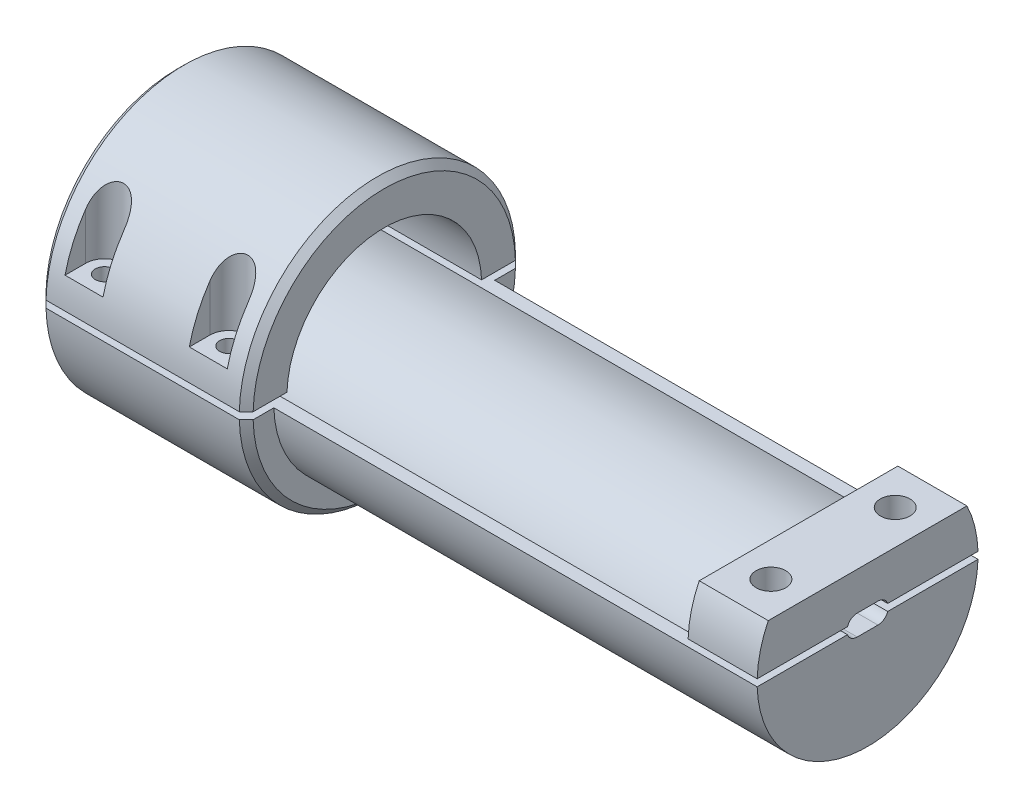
ISO-10303-21;
HEADER;
FILE_DESCRIPTION(('STEP AP214'),'2;1');
FILE_NAME('part.step','',(''),(''),'','','');
FILE_SCHEMA(('AUTOMOTIVE_DESIGN { 1 0 10303 214 1 1 1 1 }'));
ENDSEC;
DATA;
#1=APPLICATION_CONTEXT('core data for automotive mechanical design processes');
#2=APPLICATION_PROTOCOL_DEFINITION('international standard','automotive_design',2000,#1);
#3=PRODUCT_CONTEXT('',#1,'mechanical');
#4=PRODUCT('Part','Part','',(#3));
#5=PRODUCT_RELATED_PRODUCT_CATEGORY('part','',(#4));
#6=PRODUCT_DEFINITION_FORMATION('','',#4);
#7=PRODUCT_DEFINITION_CONTEXT('part definition',#1,'design');
#8=PRODUCT_DEFINITION('design','',#6,#7);
#9=PRODUCT_DEFINITION_SHAPE('','',#8);
#10=(LENGTH_UNIT() NAMED_UNIT(*) SI_UNIT(.MILLI.,.METRE.));
#11=(NAMED_UNIT(*) PLANE_ANGLE_UNIT() SI_UNIT($,.RADIAN.));
#12=(NAMED_UNIT(*) SI_UNIT($,.STERADIAN.) SOLID_ANGLE_UNIT());
#13=UNCERTAINTY_MEASURE_WITH_UNIT(LENGTH_MEASURE(1.E-05),#10,'distance_accuracy_value','');
#14=(GEOMETRIC_REPRESENTATION_CONTEXT(3) GLOBAL_UNCERTAINTY_ASSIGNED_CONTEXT((#13)) GLOBAL_UNIT_ASSIGNED_CONTEXT((#10,
#11,#12)) REPRESENTATION_CONTEXT('',''));
#15=CARTESIAN_POINT('',(0.,0.,0.));
#16=DIRECTION('',(0.,0.,1.));
#17=DIRECTION('',(1.,0.,0.));
#18=AXIS2_PLACEMENT_3D('',#15,#16,#17);
#19=CARTESIAN_POINT('',(-70.,16.,0.));
#20=DIRECTION('',(1.,0.,0.));
#21=DIRECTION('',(0.,0.,-1.));
#22=AXIS2_PLACEMENT_3D('',#19,#20,#21);
#23=PLANE('',#22);
#24=DIRECTION('',(0.,0.,1.));
#25=VECTOR('',#24,1.);
#26=CARTESIAN_POINT('',(-70.,0.5,0.));
#27=LINE('',#26,#25);
#28=CARTESIAN_POINT('',(-70.,0.5,-18.9934199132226));
#29=VERTEX_POINT('',#28);
#30=CARTESIAN_POINT('',(-70.,0.5,-14.0911319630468));
#31=VERTEX_POINT('',#30);
#32=EDGE_CURVE('E13',#29,#31,#27,.T.);
#33=ORIENTED_EDGE('',*,*,#32,.F.);
#34=CARTESIAN_POINT('',(-70.,0.,0.));
#35=DIRECTION('',(1.,0.,0.));
#36=DIRECTION('',(0.,0.,-1.));
#37=AXIS2_PLACEMENT_3D('',#34,#35,#36);
#38=CIRCLE('',#37,19.);
#39=CARTESIAN_POINT('',(-70.,0.5,18.9934199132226));
#40=VERTEX_POINT('',#39);
#41=EDGE_CURVE('E190',#29,#40,#38,.T.);
#42=ORIENTED_EDGE('',*,*,#41,.T.);
#43=CARTESIAN_POINT('',(-70.,0.5,14.0911319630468));
#44=VERTEX_POINT('',#43);
#45=EDGE_CURVE('E63',#44,#40,#27,.T.);
#46=ORIENTED_EDGE('',*,*,#45,.F.);
#47=CARTESIAN_POINT('',(-70.,0.,0.));
#48=DIRECTION('',(1.,0.,0.));
#49=DIRECTION('',(0.,0.,-1.));
#50=AXIS2_PLACEMENT_3D('',#47,#48,#49);
#51=CIRCLE('',#50,14.1);
#52=EDGE_CURVE('E344',#31,#44,#51,.T.);
#53=ORIENTED_EDGE('',*,*,#52,.F.);
#54=EDGE_LOOP('',(#33,#42,#46,#53));
#55=FACE_BOUND('',#54,.T.);
#56=ADVANCED_FACE('F52',(#55),#23,.T.);
#57=CARTESIAN_POINT('',(0.,0.,0.));
#58=DIRECTION('',(1.,0.,0.));
#59=DIRECTION('',(0.,0.,-1.));
#60=AXIS2_PLACEMENT_3D('',#57,#58,#59);
#61=CYLINDRICAL_SURFACE('',#60,20.);
#62=DIRECTION('',(1.,0.,0.));
#63=VECTOR('',#62,1.);
#64=CARTESIAN_POINT('',(0.,0.5,19.9937490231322));
#65=LINE('',#64,#63);
#66=CARTESIAN_POINT('',(-71.,0.5,19.9937490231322));
#67=VERTEX_POINT('',#66);
#68=CARTESIAN_POINT('',(-99.,0.5,19.9937490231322));
#69=VERTEX_POINT('',#68);
#70=EDGE_CURVE('E193',#67,#69,#65,.F.);
#71=ORIENTED_EDGE('',*,*,#70,.F.);
#72=CARTESIAN_POINT('',(-71.,0.,0.));
#73=DIRECTION('',(1.,0.,0.));
#74=DIRECTION('',(0.,0.,-1.));
#75=AXIS2_PLACEMENT_3D('',#72,#73,#74);
#76=CIRCLE('',#75,20.);
#77=CARTESIAN_POINT('',(-71.,0.5,-19.9937490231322));
#78=VERTEX_POINT('',#77);
#79=EDGE_CURVE('E192',#67,#78,#76,.F.);
#80=ORIENTED_EDGE('',*,*,#79,.T.);
#81=DIRECTION('',(1.,0.,0.));
#82=VECTOR('',#81,1.);
#83=CARTESIAN_POINT('',(0.,0.5,-19.9937490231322));
#84=LINE('',#83,#82);
#85=CARTESIAN_POINT('',(-99.,0.5,-19.9937490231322));
#86=VERTEX_POINT('',#85);
#87=EDGE_CURVE('E345',#86,#78,#84,.T.);
#88=ORIENTED_EDGE('',*,*,#87,.F.);
#89=CARTESIAN_POINT('',(-99.,0.,0.));
#90=DIRECTION('',(-1.,0.,0.));
#91=DIRECTION('',(0.,0.,1.));
#92=AXIS2_PLACEMENT_3D('',#89,#90,#91);
#93=CIRCLE('',#92,20.);
#94=EDGE_CURVE('E197',#86,#69,#93,.F.);
#95=ORIENTED_EDGE('',*,*,#94,.T.);
#96=EDGE_LOOP('',(#71,#80,#88,#95));
#97=FACE_BOUND('',#96,.T.);
#98=CARTESIAN_POINT('',(-91.25,11.3026545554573,16.5));
#99=CARTESIAN_POINT('',(-91.2500037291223,11.3812316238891,16.4461745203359));
#100=CARTESIAN_POINT('',(-91.2515802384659,11.4594186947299,16.3917900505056));
#101=CARTESIAN_POINT('',(-91.2581044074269,11.6149368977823,16.2819626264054));
#102=CARTESIAN_POINT('',(-91.2630530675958,11.6922677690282,16.2265193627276));
#103=CARTESIAN_POINT('',(-91.2833571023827,11.923504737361,16.058220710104));
#104=CARTESIAN_POINT('',(-91.3041748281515,12.0759246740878,15.9438969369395));
#105=CARTESIAN_POINT('',(-91.3629197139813,12.3778445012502,15.7106948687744));
#106=CARTESIAN_POINT('',(-91.4011125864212,12.5272599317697,15.5917731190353));
#107=CARTESIAN_POINT('',(-91.4972571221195,12.8185907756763,15.353143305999));
#108=CARTESIAN_POINT('',(-91.5551631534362,12.9605226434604,15.2334376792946));
#109=CARTESIAN_POINT('',(-91.6568425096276,13.1617396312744,15.0590794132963));
#110=CARTESIAN_POINT('',(-91.6917801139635,13.2248723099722,15.0036529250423));
#111=CARTESIAN_POINT('',(-91.7669480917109,13.3486567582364,14.8936304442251));
#112=CARTESIAN_POINT('',(-91.8071787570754,13.4093083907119,14.8390344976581));
#113=CARTESIAN_POINT('',(-91.9359560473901,13.5865042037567,14.6776093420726));
#114=CARTESIAN_POINT('',(-92.0328860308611,13.6988976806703,14.5726132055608));
#115=CARTESIAN_POINT('',(-92.2339333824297,13.8921081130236,14.3883411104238));
#116=CARTESIAN_POINT('',(-92.3345905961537,13.9751176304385,14.3076042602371));
#117=CARTESIAN_POINT('',(-92.5535201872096,14.1272537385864,14.157404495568));
#118=CARTESIAN_POINT('',(-92.6717803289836,14.1963898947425,14.0879338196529));
#119=CARTESIAN_POINT('',(-92.9001927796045,14.3055887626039,13.9769457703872));
#120=CARTESIAN_POINT('',(-93.0075221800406,14.348686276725,13.9326216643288));
#121=CARTESIAN_POINT('',(-93.230982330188,14.4216470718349,13.857087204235));
#122=CARTESIAN_POINT('',(-93.3471079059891,14.4515180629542,13.8258692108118));
#123=CARTESIAN_POINT('',(-93.585867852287,14.4965696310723,13.7786271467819));
#124=CARTESIAN_POINT('',(-93.7085326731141,14.5116737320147,13.7626821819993));
#125=CARTESIAN_POINT('',(-93.9558103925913,14.5259921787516,13.7475696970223));
#126=CARTESIAN_POINT('',(-94.0804227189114,14.5252111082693,13.7483973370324));
#127=CARTESIAN_POINT('',(-94.3166277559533,14.5085807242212,13.7659432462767));
#128=CARTESIAN_POINT('',(-94.4284201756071,14.4940300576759,13.7812919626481));
#129=CARTESIAN_POINT('',(-94.6470236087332,14.4524632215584,13.8248763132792));
#130=CARTESIAN_POINT('',(-94.753834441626,14.4254466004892,13.853112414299));
#131=CARTESIAN_POINT('',(-94.9633827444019,14.3591379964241,13.9218347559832));
#132=CARTESIAN_POINT('',(-95.0658889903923,14.3194891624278,13.962675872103));
#133=CARTESIAN_POINT('',(-95.2615642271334,14.2298144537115,14.0540559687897));
#134=CARTESIAN_POINT('',(-95.3547281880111,14.1797830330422,14.1046001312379));
#135=CARTESIAN_POINT('',(-95.5710323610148,14.0461404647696,14.237919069));
#136=CARTESIAN_POINT('',(-95.6885508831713,13.9576025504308,14.3249014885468));
#137=CARTESIAN_POINT('',(-95.9020701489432,13.7662768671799,14.5088722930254));
#138=CARTESIAN_POINT('',(-95.998031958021,13.6634638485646,14.6058783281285));
#139=CARTESIAN_POINT('',(-96.2060872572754,13.4013047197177,14.8475076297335));
#140=CARTESIAN_POINT('',(-96.3079138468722,13.2364041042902,14.9949579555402));
#141=CARTESIAN_POINT('',(-96.4343681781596,12.9779725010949,15.2179330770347));
#142=CARTESIAN_POINT('',(-96.4721971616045,12.8897585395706,15.2927382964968));
#143=CARTESIAN_POINT('',(-96.5397717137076,12.7102219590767,15.4422742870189));
#144=CARTESIAN_POINT('',(-96.569519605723,12.6189002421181,15.5170050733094));
#145=CARTESIAN_POINT('',(-96.6231265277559,12.4282974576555,15.6701387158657));
#146=CARTESIAN_POINT('',(-96.6465423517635,12.3288624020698,15.748502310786));
#147=CARTESIAN_POINT('',(-96.68584356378,12.1275681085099,15.9040332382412));
#148=CARTESIAN_POINT('',(-96.7017269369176,12.025708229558,15.9812002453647));
#149=CARTESIAN_POINT('',(-96.7264833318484,11.8211837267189,16.1330605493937));
#150=CARTESIAN_POINT('',(-96.7354351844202,11.7185419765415,16.2077721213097));
#151=CARTESIAN_POINT('',(-96.7471845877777,11.5117062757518,16.3553291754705));
#152=CARTESIAN_POINT('',(-96.7499874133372,11.4075137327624,16.4281762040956));
#153=CARTESIAN_POINT('',(-96.75,11.3026545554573,16.5));
#154=B_SPLINE_CURVE_WITH_KNOTS('',3,(#98,#99,#100,#101,#102,#103,#104,#105,#106,#107,#108,#109,
#110,#111,#112,#113,#114,#115,#116,#117,#118,#119,#120,#121,#122,#123,#124,#125,#126,#127,#128,
#129,#130,#131,#132,#133,#134,#135,#136,#137,#138,#139,#140,#141,#142,#143,#144,#145,#146,#147,
#148,#149,#150,#151,#152,#153),.UNSPECIFIED.,.F.,.F.,(4,2,2,2,2,2,2,2,2,2,2,2,2,2,2,2,2,2,2,2,2,
2,2,2,2,2,2,4),(0.,0.285702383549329,0.571489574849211,1.14571323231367,1.72902987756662,
2.31100534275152,2.58379282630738,2.8565953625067,3.39964084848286,3.85826131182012,
4.31656447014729,4.68662726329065,5.05647405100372,5.42822624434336,5.79987116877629,
6.13962793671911,6.47939701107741,6.8297719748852,7.18033457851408,7.69023425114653,
8.20104760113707,8.92730764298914,9.29217903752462,9.65694541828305,10.0429299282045,
10.4290176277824,10.8106471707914,11.191949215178),.UNSPECIFIED.);
#155=CARTESIAN_POINT('',(-91.25,11.3026545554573,16.5));
#156=VERTEX_POINT('',#155);
#157=CARTESIAN_POINT('',(-96.75,11.3026545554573,16.5));
#158=VERTEX_POINT('',#157);
#159=EDGE_CURVE('E349',#156,#158,#154,.T.);
#160=ORIENTED_EDGE('',*,*,#159,.F.);
#161=CARTESIAN_POINT('',(-91.2500000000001,0.,0.));
#162=DIRECTION('',(1.,0.,0.));
#163=DIRECTION('',(0.,0.,-1.));
#164=AXIS2_PLACEMENT_3D('',#161,#162,#163);
#165=CIRCLE('',#164,20.);
#166=CARTESIAN_POINT('',(-91.25,4.5,19.4871752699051));
#167=VERTEX_POINT('',#166);
#168=EDGE_CURVE('E632',#167,#156,#165,.F.);
#169=ORIENTED_EDGE('',*,*,#168,.F.);
#170=DIRECTION('',(1.,0.,0.));
#171=VECTOR('',#170,1.);
#172=CARTESIAN_POINT('',(0.,4.5,19.4871752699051));
#173=LINE('',#172,#171);
#174=CARTESIAN_POINT('',(-96.75,4.5,19.4871752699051));
#175=VERTEX_POINT('',#174);
#176=EDGE_CURVE('E204',#167,#175,#173,.F.);
#177=ORIENTED_EDGE('',*,*,#176,.T.);
#178=CARTESIAN_POINT('',(-96.7500000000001,0.,0.));
#179=DIRECTION('',(-1.,0.,0.));
#180=DIRECTION('',(0.,0.,1.));
#181=AXIS2_PLACEMENT_3D('',#178,#179,#180);
#182=CIRCLE('',#181,20.);
#183=EDGE_CURVE('E635',#158,#175,#182,.F.);
#184=ORIENTED_EDGE('',*,*,#183,.F.);
#185=EDGE_LOOP('',(#160,#169,#177,#184));
#186=FACE_BOUND('',#185,.T.);
#187=CARTESIAN_POINT('',(-94.,14.5236875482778,-13.75));
#188=CARTESIAN_POINT('',(-93.877272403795,14.5236885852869,-13.7499986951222));
#189=CARTESIAN_POINT('',(-93.7545521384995,14.5158688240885,-13.7582726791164));
#190=CARTESIAN_POINT('',(-93.5132015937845,14.4850741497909,-13.7906893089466));
#191=CARTESIAN_POINT('',(-93.3945721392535,14.4620961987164,-13.8148351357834));
#192=CARTESIAN_POINT('',(-93.1653853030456,14.4024237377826,-13.8770317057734));
#193=CARTESIAN_POINT('',(-93.0547914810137,14.3657964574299,-13.9150142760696));
#194=CARTESIAN_POINT('',(-92.8432646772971,14.2805529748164,-14.0024831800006));
#195=CARTESIAN_POINT('',(-92.7423359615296,14.231931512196,-14.0519745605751));
#196=CARTESIAN_POINT('',(-92.5191331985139,14.1064039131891,-14.1781398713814));
#197=CARTESIAN_POINT('',(-92.401119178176,14.0254868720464,-14.2583548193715));
#198=CARTESIAN_POINT('',(-92.1850429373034,13.8494912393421,-14.4293707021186));
#199=CARTESIAN_POINT('',(-92.0870176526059,13.7543869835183,-14.5201907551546));
#200=CARTESIAN_POINT('',(-91.8741410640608,13.5125630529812,-14.7461108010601));
#201=CARTESIAN_POINT('',(-91.7685700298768,13.3605451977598,-14.8842398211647));
#202=CARTESIAN_POINT('',(-91.5903744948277,13.0417280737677,-15.1643868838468));
#203=CARTESIAN_POINT('',(-91.5178022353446,12.8749058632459,-15.3064107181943));
#204=CARTESIAN_POINT('',(-91.4143306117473,12.5710321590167,-15.556299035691));
#205=CARTESIAN_POINT('',(-91.3776647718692,12.4360798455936,-15.6644262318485));
#206=CARTESIAN_POINT('',(-91.3188167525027,12.1613945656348,-15.8786277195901));
#207=CARTESIAN_POINT('',(-91.2966422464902,12.0216591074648,-15.9847008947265));
#208=CARTESIAN_POINT('',(-91.2650232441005,11.7381945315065,-16.1940087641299));
#209=CARTESIAN_POINT('',(-91.2556096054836,11.5944565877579,-16.297235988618));
#210=CARTESIAN_POINT('',(-91.2481315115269,11.3041320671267,-16.4999382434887));
#211=CARTESIAN_POINT('',(-91.2500661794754,11.1575457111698,-16.5994135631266));
#212=CARTESIAN_POINT('',(-91.2678591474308,10.7813122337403,-16.8474969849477));
#213=CARTESIAN_POINT('',(-91.2907534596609,10.5500820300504,-16.9932236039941));
#214=CARTESIAN_POINT('',(-91.3571977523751,10.0839919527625,-17.2738887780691));
#215=CARTESIAN_POINT('',(-91.4007614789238,9.84912976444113,-17.4088200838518));
#216=CARTESIAN_POINT('',(-91.5060884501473,9.37776390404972,-17.6671910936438));
#217=CARTESIAN_POINT('',(-91.5678197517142,9.14126381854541,-17.7906504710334));
#218=CARTESIAN_POINT('',(-91.7081984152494,8.66776477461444,-18.0260844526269));
#219=CARTESIAN_POINT('',(-91.7868362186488,8.43076617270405,-18.1380654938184));
#220=CARTESIAN_POINT('',(-91.9487253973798,7.99141134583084,-18.3353968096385));
#221=CARTESIAN_POINT('',(-92.0297346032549,7.78891642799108,-18.4222704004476));
#222=CARTESIAN_POINT('',(-92.1616890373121,7.4867927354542,-18.5461544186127));
#223=CARTESIAN_POINT('',(-92.2074780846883,7.38622927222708,-18.5864245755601));
#224=CARTESIAN_POINT('',(-92.3028681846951,7.18605499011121,-18.6647301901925));
#225=CARTESIAN_POINT('',(-92.3524686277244,7.08644402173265,-18.7027660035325));
#226=CARTESIAN_POINT('',(-92.456452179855,6.88774396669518,-18.7768560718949));
#227=CARTESIAN_POINT('',(-92.5108735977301,6.78866722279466,-18.812889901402));
#228=CARTESIAN_POINT('',(-92.6249280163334,6.59266824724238,-18.8824660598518));
#229=CARTESIAN_POINT('',(-92.684559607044,6.49574544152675,-18.9160090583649));
#230=CARTESIAN_POINT('',(-92.8100758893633,6.3056267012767,-18.9802291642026));
#231=CARTESIAN_POINT('',(-92.8759341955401,6.21241722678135,-19.010917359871));
#232=CARTESIAN_POINT('',(-93.0160467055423,6.03154800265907,-19.0690684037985));
#233=CARTESIAN_POINT('',(-93.0902834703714,5.94387729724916,-19.0965377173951));
#234=CARTESIAN_POINT('',(-93.2203856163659,5.80961300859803,-19.1376941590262));
#235=CARTESIAN_POINT('',(-93.272659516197,5.75997149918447,-19.1526791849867));
#236=CARTESIAN_POINT('',(-93.3829414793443,5.66670234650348,-19.1804804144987));
#237=CARTESIAN_POINT('',(-93.4409435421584,5.62306852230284,-19.1932988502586));
#238=CARTESIAN_POINT('',(-93.546926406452,5.55601033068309,-19.2127984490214));
#239=CARTESIAN_POINT('',(-93.5933169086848,5.5303213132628,-19.2201996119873));
#240=CARTESIAN_POINT('',(-93.6896884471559,5.48611123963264,-19.2328654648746));
#241=CARTESIAN_POINT('',(-93.7396621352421,5.467575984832,-19.238134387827));
#242=CARTESIAN_POINT('',(-93.8326870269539,5.44256588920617,-19.245223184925));
#243=CARTESIAN_POINT('',(-93.8752599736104,5.43447309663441,-19.2475069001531));
#244=CARTESIAN_POINT('',(-93.9612110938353,5.42541767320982,-19.2500614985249));
#245=CARTESIAN_POINT('',(-94.0045885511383,5.42444897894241,-19.2503340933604));
#246=CARTESIAN_POINT('',(-94.0908139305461,5.42975368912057,-19.2488384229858));
#247=CARTESIAN_POINT('',(-94.133662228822,5.43602160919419,-19.2470717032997));
#248=CARTESIAN_POINT('',(-94.21777261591,5.45504367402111,-19.2416889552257));
#249=CARTESIAN_POINT('',(-94.2590327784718,5.46780544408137,-19.2380707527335));
#250=CARTESIAN_POINT('',(-94.3590176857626,5.50618512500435,-19.2271289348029));
#251=CARTESIAN_POINT('',(-94.4163801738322,5.5350386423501,-19.2188583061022));
#252=CARTESIAN_POINT('',(-94.5258890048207,5.60070434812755,-19.1998250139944));
#253=CARTESIAN_POINT('',(-94.5780189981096,5.6375404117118,-19.1890548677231));
#254=CARTESIAN_POINT('',(-94.6769127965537,5.71588483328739,-19.1658631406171));
#255=CARTESIAN_POINT('',(-94.7237422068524,5.75731953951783,-19.1534671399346));
#256=CARTESIAN_POINT('',(-94.8136606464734,5.8437001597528,-19.12728967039));
#257=CARTESIAN_POINT('',(-94.8567457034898,5.88864970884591,-19.1135067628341));
#258=CARTESIAN_POINT('',(-94.9398842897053,5.98111705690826,-19.0847737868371));
#259=CARTESIAN_POINT('',(-94.9799294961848,6.02864133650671,-19.0698207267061));
#260=CARTESIAN_POINT('',(-95.0573554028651,6.12545680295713,-19.0389433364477));
#261=CARTESIAN_POINT('',(-95.0947372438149,6.17474721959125,-19.0230194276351));
#262=CARTESIAN_POINT('',(-95.1897305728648,6.30560822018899,-18.9801617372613));
#263=CARTESIAN_POINT('',(-95.2455289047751,6.38826077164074,-18.9525182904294));
#264=CARTESIAN_POINT('',(-95.3524760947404,6.55585915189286,-18.8951997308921));
#265=CARTESIAN_POINT('',(-95.4036226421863,6.6408060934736,-18.8655236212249));
#266=CARTESIAN_POINT('',(-95.5021053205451,6.81238993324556,-18.8042456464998));
#267=CARTESIAN_POINT('',(-95.5494352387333,6.89902931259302,-18.7726407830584));
#268=CARTESIAN_POINT('',(-95.6407271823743,7.07340744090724,-18.7076341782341));
#269=CARTESIAN_POINT('',(-95.6846886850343,7.16114635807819,-18.6742321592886));
#270=CARTESIAN_POINT('',(-95.8124523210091,7.42625672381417,-18.5711261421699));
#271=CARTESIAN_POINT('',(-95.8917287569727,7.60479837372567,-18.4987793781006));
#272=CARTESIAN_POINT('',(-96.0398070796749,7.963108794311,-18.3473909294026));
#273=CARTESIAN_POINT('',(-96.1086178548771,8.14287638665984,-18.2683550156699));
#274=CARTESIAN_POINT('',(-96.2619795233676,8.57464691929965,-18.0707507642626));
#275=CARTESIAN_POINT('',(-96.3418638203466,8.82686683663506,-17.9489868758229));
#276=CARTESIAN_POINT('',(-96.4822993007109,9.33034800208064,-17.6924994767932));
#277=CARTESIAN_POINT('',(-96.5428358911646,9.58160838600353,-17.5577662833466));
#278=CARTESIAN_POINT('',(-96.6423360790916,10.080135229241,-17.2763526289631));
#279=CARTESIAN_POINT('',(-96.6814027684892,10.3274151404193,-17.129733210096));
#280=CARTESIAN_POINT('',(-96.7351354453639,10.8170967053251,-16.8247895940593));
#281=CARTESIAN_POINT('',(-96.7498268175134,11.0595031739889,-16.6664777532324));
#282=CARTESIAN_POINT('',(-96.7501692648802,11.5361404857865,-16.3401411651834));
#283=CARTESIAN_POINT('',(-96.7359775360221,11.7704085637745,-16.1721738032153));
#284=CARTESIAN_POINT('',(-96.6883794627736,12.1139079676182,-15.9145788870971));
#285=CARTESIAN_POINT('',(-96.6681204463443,12.2271165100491,-15.8277520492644));
#286=CARTESIAN_POINT('',(-96.6178308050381,12.4502979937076,-15.6528008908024));
#287=CARTESIAN_POINT('',(-96.5878019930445,12.5602715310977,-15.5646768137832));
#288=CARTESIAN_POINT('',(-96.4953566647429,12.8418694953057,-15.334162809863));
#289=CARTESIAN_POINT('',(-96.4243437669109,13.0104163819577,-15.1912880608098));
#290=CARTESIAN_POINT('',(-96.2492509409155,13.3327835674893,-14.9091407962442));
#291=CARTESIAN_POINT('',(-96.1452346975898,13.4866314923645,-14.7698618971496));
#292=CARTESIAN_POINT('',(-95.9376758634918,13.7285232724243,-14.544620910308));
#293=CARTESIAN_POINT('',(-95.8440514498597,13.8221495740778,-14.4555510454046));
#294=CARTESIAN_POINT('',(-95.6378617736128,13.9963428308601,-14.2869519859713));
#295=CARTESIAN_POINT('',(-95.5253207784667,14.0769262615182,-14.207410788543));
#296=CARTESIAN_POINT('',(-95.3038883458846,14.2082142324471,-14.0759968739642));
#297=CARTESIAN_POINT('',(-95.1980775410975,14.2616877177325,-14.0217238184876));
#298=CARTESIAN_POINT('',(-94.9752887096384,14.355268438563,-13.9259025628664));
#299=CARTESIAN_POINT('',(-94.8583174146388,14.3953836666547,-13.884346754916));
#300=CARTESIAN_POINT('',(-94.6197498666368,14.4590969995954,-13.8179806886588));
#301=CARTESIAN_POINT('',(-94.4984279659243,14.4831900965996,-13.792669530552));
#302=CARTESIAN_POINT('',(-94.2514003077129,14.515481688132,-13.7586831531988));
#303=CARTESIAN_POINT('',(-94.1256963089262,14.5236864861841,-13.7500013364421));
#304=CARTESIAN_POINT('',(-94.,14.5236875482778,-13.75));
#305=B_SPLINE_CURVE_WITH_KNOTS('',3,(#187,#188,#189,#190,#191,#192,#193,#194,#195,#196,#197,
#198,#199,#200,#201,#202,#203,#204,#205,#206,#207,#208,#209,#210,#211,#212,#213,#214,#215,#216,
#217,#218,#219,#220,#221,#222,#223,#224,#225,#226,#227,#228,#229,#230,#231,#232,#233,#234,#235,
#236,#237,#238,#239,#240,#241,#242,#243,#244,#245,#246,#247,#248,#249,#250,#251,#252,#253,#254,
#255,#256,#257,#258,#259,#260,#261,#262,#263,#264,#265,#266,#267,#268,#269,#270,#271,#272,#273,
#274,#275,#276,#277,#278,#279,#280,#281,#282,#283,#284,#285,#286,#287,#288,#289,#290,#291,#292,
#293,#294,#295,#296,#297,#298,#299,#300,#301,#302,#303,#304),.UNSPECIFIED.,.T.,.F.,(4,2,2,2,2,2,
2,2,2,2,2,2,2,2,2,2,2,2,2,2,2,2,2,2,2,2,2,2,2,2,2,2,2,2,2,2,2,2,2,2,2,2,2,2,2,2,2,2,2,2,2,2,2,2,
2,2,2,2,4),(0.,0.367662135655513,0.735397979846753,1.10134598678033,1.46745477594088,
1.95687184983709,2.44718524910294,3.13620254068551,3.82630687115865,4.35591736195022,
4.88580806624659,5.41697785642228,5.94810661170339,6.76970231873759,7.59184519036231,
8.41255107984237,9.23279417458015,9.93652045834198,10.289271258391,10.6419657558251,
10.9977695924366,11.3534774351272,11.707740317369,12.0612789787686,12.2818510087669,
12.5021943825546,12.6623507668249,12.8221876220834,12.951795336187,13.0812927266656,
13.210692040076,13.3402436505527,13.5333506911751,13.7270434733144,13.9179899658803,
14.1091366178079,14.3007890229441,14.4923588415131,14.8025988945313,15.1129922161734,
15.4238810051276,15.7348179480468,16.3592898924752,16.9832284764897,17.8559936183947,
18.7294154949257,19.5986059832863,20.466890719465,21.3304624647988,21.7624528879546,
22.1943631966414,22.8883227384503,23.580951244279,24.0581191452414,24.5346795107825,
24.9242885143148,25.3136639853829,25.690369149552,26.0669248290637),.UNSPECIFIED.);
#306=CARTESIAN_POINT('',(-96.75,11.3026545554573,-16.5));
#307=VERTEX_POINT('',#306);
#308=CARTESIAN_POINT('',(-91.25,11.3026545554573,-16.5));
#309=VERTEX_POINT('',#308);
#310=EDGE_CURVE('E224',#307,#309,#305,.T.);
#311=ORIENTED_EDGE('',*,*,#310,.F.);
#312=CARTESIAN_POINT('',(-96.7500000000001,0.,0.));
#313=DIRECTION('',(-1.,0.,0.));
#314=DIRECTION('',(0.,0.,1.));
#315=AXIS2_PLACEMENT_3D('',#312,#313,#314);
#316=CIRCLE('',#315,20.);
#317=CARTESIAN_POINT('',(-96.75,4.5,-19.4871752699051));
#318=VERTEX_POINT('',#317);
#319=EDGE_CURVE('E231',#318,#307,#316,.F.);
#320=ORIENTED_EDGE('',*,*,#319,.F.);
#321=DIRECTION('',(1.,0.,0.));
#322=VECTOR('',#321,1.);
#323=CARTESIAN_POINT('',(0.,4.5,-19.4871752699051));
#324=LINE('',#323,#322);
#325=CARTESIAN_POINT('',(-91.25,4.5,-19.4871752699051));
#326=VERTEX_POINT('',#325);
#327=EDGE_CURVE('E607',#326,#318,#324,.F.);
#328=ORIENTED_EDGE('',*,*,#327,.F.);
#329=CARTESIAN_POINT('',(-91.2500000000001,0.,0.));
#330=DIRECTION('',(1.,0.,0.));
#331=DIRECTION('',(0.,0.,-1.));
#332=AXIS2_PLACEMENT_3D('',#329,#330,#331);
#333=CIRCLE('',#332,20.);
#334=EDGE_CURVE('E618',#309,#326,#333,.F.);
#335=ORIENTED_EDGE('',*,*,#334,.F.);
#336=EDGE_LOOP('',(#311,#320,#328,#335));
#337=FACE_BOUND('',#336,.T.);
#338=CARTESIAN_POINT('',(-76.,14.5236875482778,-13.75));
#339=CARTESIAN_POINT('',(-75.877272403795,14.5236885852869,-13.7499986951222));
#340=CARTESIAN_POINT('',(-75.7545521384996,14.5158688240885,-13.7582726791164));
#341=CARTESIAN_POINT('',(-75.5132015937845,14.4850741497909,-13.7906893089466));
#342=CARTESIAN_POINT('',(-75.3945721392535,14.4620961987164,-13.8148351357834));
#343=CARTESIAN_POINT('',(-75.1653853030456,14.4024237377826,-13.8770317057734));
#344=CARTESIAN_POINT('',(-75.0547914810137,14.3657964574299,-13.9150142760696));
#345=CARTESIAN_POINT('',(-74.8432646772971,14.2805529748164,-14.0024831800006));
#346=CARTESIAN_POINT('',(-74.7423359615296,14.231931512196,-14.0519745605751));
#347=CARTESIAN_POINT('',(-74.5191331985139,14.1064039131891,-14.1781398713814));
#348=CARTESIAN_POINT('',(-74.401119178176,14.0254868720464,-14.2583548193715));
#349=CARTESIAN_POINT('',(-74.1850429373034,13.8494912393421,-14.4293707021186));
#350=CARTESIAN_POINT('',(-74.0870176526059,13.7543869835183,-14.5201907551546));
#351=CARTESIAN_POINT('',(-73.8741410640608,13.5125630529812,-14.7461108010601));
#352=CARTESIAN_POINT('',(-73.7685700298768,13.3605451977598,-14.8842398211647));
#353=CARTESIAN_POINT('',(-73.5903744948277,13.0417280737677,-15.1643868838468));
#354=CARTESIAN_POINT('',(-73.5178022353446,12.8749058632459,-15.3064107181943));
#355=CARTESIAN_POINT('',(-73.4143306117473,12.5710321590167,-15.556299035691));
#356=CARTESIAN_POINT('',(-73.3776647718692,12.4360798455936,-15.6644262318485));
#357=CARTESIAN_POINT('',(-73.3188167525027,12.1613945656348,-15.8786277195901));
#358=CARTESIAN_POINT('',(-73.2966422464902,12.0216591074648,-15.9847008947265));
#359=CARTESIAN_POINT('',(-73.2650232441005,11.7381945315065,-16.1940087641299));
#360=CARTESIAN_POINT('',(-73.2556096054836,11.5944565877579,-16.297235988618));
#361=CARTESIAN_POINT('',(-73.2481315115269,11.3041320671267,-16.4999382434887));
#362=CARTESIAN_POINT('',(-73.2500661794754,11.1575457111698,-16.5994135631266));
#363=CARTESIAN_POINT('',(-73.2678591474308,10.7813122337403,-16.8474969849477));
#364=CARTESIAN_POINT('',(-73.2907534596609,10.5500820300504,-16.9932236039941));
#365=CARTESIAN_POINT('',(-73.3571977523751,10.0839919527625,-17.2738887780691));
#366=CARTESIAN_POINT('',(-73.4007614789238,9.84912976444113,-17.4088200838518));
#367=CARTESIAN_POINT('',(-73.5060884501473,9.37776390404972,-17.6671910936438));
#368=CARTESIAN_POINT('',(-73.5678197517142,9.14126381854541,-17.7906504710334));
#369=CARTESIAN_POINT('',(-73.7081984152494,8.66776477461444,-18.0260844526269));
#370=CARTESIAN_POINT('',(-73.7868362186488,8.43076617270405,-18.1380654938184));
#371=CARTESIAN_POINT('',(-73.9487253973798,7.99141134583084,-18.3353968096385));
#372=CARTESIAN_POINT('',(-74.0297346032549,7.78891642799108,-18.4222704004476));
#373=CARTESIAN_POINT('',(-74.1616890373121,7.4867927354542,-18.5461544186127));
#374=CARTESIAN_POINT('',(-74.2074780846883,7.38622927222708,-18.5864245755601));
#375=CARTESIAN_POINT('',(-74.3028681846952,7.18605499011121,-18.6647301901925));
#376=CARTESIAN_POINT('',(-74.3524686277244,7.08644402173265,-18.7027660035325));
#377=CARTESIAN_POINT('',(-74.456452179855,6.88774396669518,-18.7768560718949));
#378=CARTESIAN_POINT('',(-74.5108735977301,6.78866722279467,-18.812889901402));
#379=CARTESIAN_POINT('',(-74.6249280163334,6.59266824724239,-18.8824660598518));
#380=CARTESIAN_POINT('',(-74.684559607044,6.49574544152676,-18.9160090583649));
#381=CARTESIAN_POINT('',(-74.8100758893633,6.30562670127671,-18.9802291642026));
#382=CARTESIAN_POINT('',(-74.8759341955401,6.21241722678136,-19.010917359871));
#383=CARTESIAN_POINT('',(-75.0160467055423,6.03154800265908,-19.0690684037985));
#384=CARTESIAN_POINT('',(-75.0902834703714,5.94387729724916,-19.0965377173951));
#385=CARTESIAN_POINT('',(-75.2203856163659,5.80961300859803,-19.1376941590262));
#386=CARTESIAN_POINT('',(-75.272659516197,5.75997149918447,-19.1526791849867));
#387=CARTESIAN_POINT('',(-75.3829414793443,5.66670234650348,-19.1804804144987));
#388=CARTESIAN_POINT('',(-75.4409435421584,5.62306852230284,-19.1932988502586));
#389=CARTESIAN_POINT('',(-75.5469264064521,5.55601033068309,-19.2127984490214));
#390=CARTESIAN_POINT('',(-75.5933169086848,5.5303213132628,-19.2201996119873));
#391=CARTESIAN_POINT('',(-75.6896884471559,5.48611123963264,-19.2328654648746));
#392=CARTESIAN_POINT('',(-75.7396621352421,5.467575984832,-19.238134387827));
#393=CARTESIAN_POINT('',(-75.8326870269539,5.44256588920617,-19.245223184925));
#394=CARTESIAN_POINT('',(-75.8752599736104,5.43447309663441,-19.2475069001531));
#395=CARTESIAN_POINT('',(-75.9612110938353,5.42541767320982,-19.2500614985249));
#396=CARTESIAN_POINT('',(-76.0045885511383,5.42444897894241,-19.2503340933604));
#397=CARTESIAN_POINT('',(-76.0908139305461,5.42975368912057,-19.2488384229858));
#398=CARTESIAN_POINT('',(-76.133662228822,5.43602160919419,-19.2470717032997));
#399=CARTESIAN_POINT('',(-76.21777261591,5.45504367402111,-19.2416889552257));
#400=CARTESIAN_POINT('',(-76.2590327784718,5.46780544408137,-19.2380707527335));
#401=CARTESIAN_POINT('',(-76.3590176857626,5.50618512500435,-19.2271289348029));
#402=CARTESIAN_POINT('',(-76.4163801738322,5.5350386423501,-19.2188583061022));
#403=CARTESIAN_POINT('',(-76.5258890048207,5.60070434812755,-19.1998250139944));
#404=CARTESIAN_POINT('',(-76.5780189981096,5.6375404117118,-19.1890548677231));
#405=CARTESIAN_POINT('',(-76.6769127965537,5.71588483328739,-19.1658631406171));
#406=CARTESIAN_POINT('',(-76.7237422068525,5.75731953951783,-19.1534671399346));
#407=CARTESIAN_POINT('',(-76.8136606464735,5.8437001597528,-19.12728967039));
#408=CARTESIAN_POINT('',(-76.8567457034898,5.8886497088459,-19.1135067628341));
#409=CARTESIAN_POINT('',(-76.9398842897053,5.98111705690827,-19.0847737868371));
#410=CARTESIAN_POINT('',(-76.9799294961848,6.02864133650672,-19.0698207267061));
#411=CARTESIAN_POINT('',(-77.0573554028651,6.12545680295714,-19.0389433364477));
#412=CARTESIAN_POINT('',(-77.0947372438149,6.17474721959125,-19.0230194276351));
#413=CARTESIAN_POINT('',(-77.1897305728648,6.30560822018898,-18.9801617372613));
#414=CARTESIAN_POINT('',(-77.2455289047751,6.38826077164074,-18.9525182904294));
#415=CARTESIAN_POINT('',(-77.3524760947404,6.55585915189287,-18.8951997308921));
#416=CARTESIAN_POINT('',(-77.4036226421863,6.64080609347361,-18.8655236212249));
#417=CARTESIAN_POINT('',(-77.5021053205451,6.81238993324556,-18.8042456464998));
#418=CARTESIAN_POINT('',(-77.5494352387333,6.89902931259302,-18.7726407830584));
#419=CARTESIAN_POINT('',(-77.6407271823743,7.07340744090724,-18.7076341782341));
#420=CARTESIAN_POINT('',(-77.6846886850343,7.16114635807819,-18.6742321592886));
#421=CARTESIAN_POINT('',(-77.8124523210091,7.42625672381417,-18.5711261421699));
#422=CARTESIAN_POINT('',(-77.8917287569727,7.60479837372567,-18.4987793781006));
#423=CARTESIAN_POINT('',(-78.0398070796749,7.963108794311,-18.3473909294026));
#424=CARTESIAN_POINT('',(-78.1086178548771,8.14287638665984,-18.2683550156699));
#425=CARTESIAN_POINT('',(-78.2619795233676,8.57464691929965,-18.0707507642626));
#426=CARTESIAN_POINT('',(-78.3418638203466,8.82686683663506,-17.9489868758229));
#427=CARTESIAN_POINT('',(-78.4822993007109,9.33034800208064,-17.6924994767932));
#428=CARTESIAN_POINT('',(-78.5428358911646,9.58160838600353,-17.5577662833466));
#429=CARTESIAN_POINT('',(-78.6423360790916,10.080135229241,-17.2763526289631));
#430=CARTESIAN_POINT('',(-78.6814027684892,10.3274151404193,-17.129733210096));
#431=CARTESIAN_POINT('',(-78.7351354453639,10.8170967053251,-16.8247895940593));
#432=CARTESIAN_POINT('',(-78.7498268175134,11.0595031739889,-16.6664777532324));
#433=CARTESIAN_POINT('',(-78.7501692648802,11.5361404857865,-16.3401411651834));
#434=CARTESIAN_POINT('',(-78.7359775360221,11.7704085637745,-16.1721738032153));
#435=CARTESIAN_POINT('',(-78.6883794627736,12.1139079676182,-15.9145788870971));
#436=CARTESIAN_POINT('',(-78.6681204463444,12.2271165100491,-15.8277520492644));
#437=CARTESIAN_POINT('',(-78.6178308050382,12.4502979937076,-15.6528008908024));
#438=CARTESIAN_POINT('',(-78.5878019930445,12.5602715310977,-15.5646768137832));
#439=CARTESIAN_POINT('',(-78.4953566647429,12.8418694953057,-15.334162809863));
#440=CARTESIAN_POINT('',(-78.4243437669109,13.0104163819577,-15.1912880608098));
#441=CARTESIAN_POINT('',(-78.2492509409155,13.3327835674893,-14.9091407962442));
#442=CARTESIAN_POINT('',(-78.1452346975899,13.4866314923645,-14.7698618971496));
#443=CARTESIAN_POINT('',(-77.9376758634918,13.7285232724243,-14.544620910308));
#444=CARTESIAN_POINT('',(-77.8440514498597,13.8221495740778,-14.4555510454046));
#445=CARTESIAN_POINT('',(-77.6378617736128,13.9963428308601,-14.2869519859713));
#446=CARTESIAN_POINT('',(-77.5253207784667,14.0769262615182,-14.207410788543));
#447=CARTESIAN_POINT('',(-77.3038883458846,14.2082142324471,-14.0759968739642));
#448=CARTESIAN_POINT('',(-77.1980775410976,14.2616877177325,-14.0217238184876));
#449=CARTESIAN_POINT('',(-76.9752887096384,14.355268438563,-13.9259025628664));
#450=CARTESIAN_POINT('',(-76.8583174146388,14.3953836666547,-13.884346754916));
#451=CARTESIAN_POINT('',(-76.6197498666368,14.4590969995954,-13.8179806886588));
#452=CARTESIAN_POINT('',(-76.4984279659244,14.4831900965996,-13.792669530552));
#453=CARTESIAN_POINT('',(-76.251400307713,14.515481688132,-13.7586831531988));
#454=CARTESIAN_POINT('',(-76.1256963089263,14.5236864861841,-13.7500013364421));
#455=CARTESIAN_POINT('',(-76.,14.5236875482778,-13.75));
#456=B_SPLINE_CURVE_WITH_KNOTS('',3,(#338,#339,#340,#341,#342,#343,#344,#345,#346,#347,#348,
#349,#350,#351,#352,#353,#354,#355,#356,#357,#358,#359,#360,#361,#362,#363,#364,#365,#366,#367,
#368,#369,#370,#371,#372,#373,#374,#375,#376,#377,#378,#379,#380,#381,#382,#383,#384,#385,#386,
#387,#388,#389,#390,#391,#392,#393,#394,#395,#396,#397,#398,#399,#400,#401,#402,#403,#404,#405,
#406,#407,#408,#409,#410,#411,#412,#413,#414,#415,#416,#417,#418,#419,#420,#421,#422,#423,#424,
#425,#426,#427,#428,#429,#430,#431,#432,#433,#434,#435,#436,#437,#438,#439,#440,#441,#442,#443,
#444,#445,#446,#447,#448,#449,#450,#451,#452,#453,#454,#455),.UNSPECIFIED.,.T.,.F.,(4,2,2,2,2,2,
2,2,2,2,2,2,2,2,2,2,2,2,2,2,2,2,2,2,2,2,2,2,2,2,2,2,2,2,2,2,2,2,2,2,2,2,2,2,2,2,2,2,2,2,2,2,2,2,
2,2,2,2,4),(0.,0.367662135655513,0.735397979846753,1.10134598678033,1.46745477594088,
1.95687184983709,2.44718524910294,3.13620254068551,3.82630687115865,4.35591736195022,
4.88580806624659,5.41697785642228,5.94810661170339,6.76970231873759,7.59184519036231,
8.41255107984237,9.23279417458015,9.93652045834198,10.289271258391,10.6419657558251,
10.9977695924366,11.3534774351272,11.707740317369,12.0612789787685,12.2818510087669,
12.5021943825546,12.6623507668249,12.8221876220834,12.951795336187,13.0812927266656,
13.210692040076,13.3402436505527,13.5333506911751,13.7270434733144,13.9179899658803,
14.1091366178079,14.3007890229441,14.4923588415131,14.8025988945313,15.1129922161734,
15.4238810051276,15.7348179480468,16.3592898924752,16.9832284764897,17.8559936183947,
18.7294154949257,19.5986059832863,20.466890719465,21.3304624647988,21.7624528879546,
22.1943631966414,22.8883227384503,23.5809512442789,24.0581191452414,24.5346795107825,
24.9242885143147,25.3136639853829,25.690369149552,26.0669248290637),.UNSPECIFIED.);
#457=CARTESIAN_POINT('',(-78.75,11.3026545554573,-16.5));
#458=VERTEX_POINT('',#457);
#459=CARTESIAN_POINT('',(-73.25,11.3026545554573,-16.5));
#460=VERTEX_POINT('',#459);
#461=EDGE_CURVE('E269',#458,#460,#456,.T.);
#462=ORIENTED_EDGE('',*,*,#461,.F.);
#463=CARTESIAN_POINT('',(-78.7499999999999,0.,0.));
#464=DIRECTION('',(-1.,0.,0.));
#465=DIRECTION('',(0.,0.,1.));
#466=AXIS2_PLACEMENT_3D('',#463,#464,#465);
#467=CIRCLE('',#466,20.);
#468=CARTESIAN_POINT('',(-78.75,4.5,-19.4871752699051));
#469=VERTEX_POINT('',#468);
#470=EDGE_CURVE('E277',#469,#458,#467,.F.);
#471=ORIENTED_EDGE('',*,*,#470,.F.);
#472=DIRECTION('',(1.,0.,0.));
#473=VECTOR('',#472,1.);
#474=CARTESIAN_POINT('',(0.,4.5,-19.4871752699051));
#475=LINE('',#474,#473);
#476=CARTESIAN_POINT('',(-73.25,4.5,-19.4871752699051));
#477=VERTEX_POINT('',#476);
#478=EDGE_CURVE('E211',#469,#477,#475,.T.);
#479=ORIENTED_EDGE('',*,*,#478,.T.);
#480=CARTESIAN_POINT('',(-73.2499999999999,0.,0.));
#481=DIRECTION('',(1.,0.,0.));
#482=DIRECTION('',(0.,0.,-1.));
#483=AXIS2_PLACEMENT_3D('',#480,#481,#482);
#484=CIRCLE('',#483,20.);
#485=EDGE_CURVE('E222',#460,#477,#484,.F.);
#486=ORIENTED_EDGE('',*,*,#485,.F.);
#487=EDGE_LOOP('',(#462,#471,#479,#486));
#488=FACE_BOUND('',#487,.T.);
#489=CARTESIAN_POINT('',(-78.7499999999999,0.,0.));
#490=DIRECTION('',(-1.,0.,0.));
#491=DIRECTION('',(0.,0.,1.));
#492=AXIS2_PLACEMENT_3D('',#489,#490,#491);
#493=CIRCLE('',#492,20.);
#494=CARTESIAN_POINT('',(-78.75,11.3026545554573,16.5));
#495=VERTEX_POINT('',#494);
#496=CARTESIAN_POINT('',(-78.75,4.5,19.4871752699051));
#497=VERTEX_POINT('',#496);
#498=EDGE_CURVE('E300',#495,#497,#493,.F.);
#499=ORIENTED_EDGE('',*,*,#498,.F.);
#500=CARTESIAN_POINT('',(-73.25,11.3026545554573,16.5));
#501=CARTESIAN_POINT('',(-73.2500037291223,11.3812316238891,16.4461745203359));
#502=CARTESIAN_POINT('',(-73.2515802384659,11.4594186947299,16.3917900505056));
#503=CARTESIAN_POINT('',(-73.2581044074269,11.6149368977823,16.2819626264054));
#504=CARTESIAN_POINT('',(-73.2630530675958,11.6922677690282,16.2265193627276));
#505=CARTESIAN_POINT('',(-73.2833571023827,11.923504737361,16.058220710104));
#506=CARTESIAN_POINT('',(-73.3041748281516,12.0759246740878,15.9438969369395));
#507=CARTESIAN_POINT('',(-73.3629197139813,12.3778445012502,15.7106948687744));
#508=CARTESIAN_POINT('',(-73.4011125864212,12.5272599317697,15.5917731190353));
#509=CARTESIAN_POINT('',(-73.4972571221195,12.8185907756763,15.353143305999));
#510=CARTESIAN_POINT('',(-73.5551631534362,12.9605226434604,15.2334376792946));
#511=CARTESIAN_POINT('',(-73.6568425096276,13.1617396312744,15.0590794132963));
#512=CARTESIAN_POINT('',(-73.6917801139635,13.2248723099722,15.0036529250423));
#513=CARTESIAN_POINT('',(-73.7669480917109,13.3486567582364,14.8936304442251));
#514=CARTESIAN_POINT('',(-73.8071787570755,13.4093083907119,14.8390344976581));
#515=CARTESIAN_POINT('',(-73.9359560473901,13.5865042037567,14.6776093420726));
#516=CARTESIAN_POINT('',(-74.0328860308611,13.6988976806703,14.5726132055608));
#517=CARTESIAN_POINT('',(-74.2339333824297,13.8921081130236,14.3883411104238));
#518=CARTESIAN_POINT('',(-74.3345905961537,13.9751176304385,14.3076042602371));
#519=CARTESIAN_POINT('',(-74.5535201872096,14.1272537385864,14.157404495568));
#520=CARTESIAN_POINT('',(-74.6717803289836,14.1963898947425,14.0879338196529));
#521=CARTESIAN_POINT('',(-74.9001927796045,14.3055887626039,13.9769457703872));
#522=CARTESIAN_POINT('',(-75.0075221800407,14.348686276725,13.9326216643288));
#523=CARTESIAN_POINT('',(-75.230982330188,14.4216470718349,13.857087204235));
#524=CARTESIAN_POINT('',(-75.3471079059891,14.4515180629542,13.8258692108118));
#525=CARTESIAN_POINT('',(-75.5858678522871,14.4965696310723,13.7786271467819));
#526=CARTESIAN_POINT('',(-75.7085326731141,14.5116737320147,13.7626821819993));
#527=CARTESIAN_POINT('',(-75.9558103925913,14.5259921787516,13.7475696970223));
#528=CARTESIAN_POINT('',(-76.0804227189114,14.5252111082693,13.7483973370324));
#529=CARTESIAN_POINT('',(-76.3166277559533,14.5085807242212,13.7659432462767));
#530=CARTESIAN_POINT('',(-76.4284201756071,14.4940300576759,13.7812919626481));
#531=CARTESIAN_POINT('',(-76.6470236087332,14.4524632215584,13.8248763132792));
#532=CARTESIAN_POINT('',(-76.753834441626,14.4254466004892,13.853112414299));
#533=CARTESIAN_POINT('',(-76.9633827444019,14.3591379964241,13.9218347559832));
#534=CARTESIAN_POINT('',(-77.0658889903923,14.3194891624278,13.962675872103));
#535=CARTESIAN_POINT('',(-77.2615642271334,14.2298144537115,14.0540559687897));
#536=CARTESIAN_POINT('',(-77.3547281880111,14.1797830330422,14.1046001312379));
#537=CARTESIAN_POINT('',(-77.5710323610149,14.0461404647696,14.237919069));
#538=CARTESIAN_POINT('',(-77.6885508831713,13.9576025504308,14.3249014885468));
#539=CARTESIAN_POINT('',(-77.9020701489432,13.7662768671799,14.5088722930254));
#540=CARTESIAN_POINT('',(-77.998031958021,13.6634638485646,14.6058783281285));
#541=CARTESIAN_POINT('',(-78.2060872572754,13.4013047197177,14.8475076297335));
#542=CARTESIAN_POINT('',(-78.3079138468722,13.2364041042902,14.9949579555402));
#543=CARTESIAN_POINT('',(-78.4343681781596,12.9779725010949,15.2179330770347));
#544=CARTESIAN_POINT('',(-78.4721971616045,12.8897585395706,15.2927382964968));
#545=CARTESIAN_POINT('',(-78.5397717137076,12.7102219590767,15.4422742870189));
#546=CARTESIAN_POINT('',(-78.569519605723,12.6189002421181,15.5170050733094));
#547=CARTESIAN_POINT('',(-78.6231265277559,12.4282974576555,15.6701387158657));
#548=CARTESIAN_POINT('',(-78.6465423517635,12.3288624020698,15.748502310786));
#549=CARTESIAN_POINT('',(-78.68584356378,12.1275681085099,15.9040332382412));
#550=CARTESIAN_POINT('',(-78.7017269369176,12.025708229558,15.9812002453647));
#551=CARTESIAN_POINT('',(-78.7264833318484,11.8211837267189,16.1330605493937));
#552=CARTESIAN_POINT('',(-78.7354351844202,11.7185419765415,16.2077721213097));
#553=CARTESIAN_POINT('',(-78.7471845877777,11.5117062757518,16.3553291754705));
#554=CARTESIAN_POINT('',(-78.7499874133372,11.4075137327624,16.4281762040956));
#555=CARTESIAN_POINT('',(-78.75,11.3026545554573,16.5));
#556=B_SPLINE_CURVE_WITH_KNOTS('',3,(#500,#501,#502,#503,#504,#505,#506,#507,#508,#509,#510,
#511,#512,#513,#514,#515,#516,#517,#518,#519,#520,#521,#522,#523,#524,#525,#526,#527,#528,#529,
#530,#531,#532,#533,#534,#535,#536,#537,#538,#539,#540,#541,#542,#543,#544,#545,#546,#547,#548,
#549,#550,#551,#552,#553,#554,#555),.UNSPECIFIED.,.F.,.F.,(4,2,2,2,2,2,2,2,2,2,2,2,2,2,2,2,2,2,
2,2,2,2,2,2,2,2,2,4),(0.,0.285702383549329,0.571489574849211,1.14571323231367,1.72902987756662,
2.31100534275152,2.58379282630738,2.8565953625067,3.39964084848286,3.85826131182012,
4.31656447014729,4.68662726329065,5.05647405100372,5.42822624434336,5.79987116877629,
6.1396279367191,6.47939701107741,6.8297719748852,7.18033457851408,7.69023425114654,
8.20104760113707,8.92730764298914,9.29217903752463,9.65694541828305,10.0429299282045,
10.4290176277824,10.8106471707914,11.191949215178),.UNSPECIFIED.);
#557=CARTESIAN_POINT('',(-73.25,11.3026545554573,16.5));
#558=VERTEX_POINT('',#557);
#559=EDGE_CURVE('E309',#558,#495,#556,.T.);
#560=ORIENTED_EDGE('',*,*,#559,.F.);
#561=CARTESIAN_POINT('',(-73.2499999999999,0.,0.));
#562=DIRECTION('',(1.,0.,0.));
#563=DIRECTION('',(0.,0.,-1.));
#564=AXIS2_PLACEMENT_3D('',#561,#562,#563);
#565=CIRCLE('',#564,20.);
#566=CARTESIAN_POINT('',(-73.25,4.5,19.4871752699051));
#567=VERTEX_POINT('',#566);
#568=EDGE_CURVE('E308',#567,#558,#565,.F.);
#569=ORIENTED_EDGE('',*,*,#568,.F.);
#570=DIRECTION('',(1.,0.,0.));
#571=VECTOR('',#570,1.);
#572=CARTESIAN_POINT('',(0.,4.5,19.4871752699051));
#573=LINE('',#572,#571);
#574=EDGE_CURVE('E275',#497,#567,#573,.T.);
#575=ORIENTED_EDGE('',*,*,#574,.F.);
#576=EDGE_LOOP('',(#499,#560,#569,#575));
#577=FACE_BOUND('',#576,.T.);
#578=ADVANCED_FACE('F233',(#97,#186,#337,#488,#577),#61,.T.);
#579=CARTESIAN_POINT('',(-100.,20.,0.));
#580=DIRECTION('',(-1.,0.,0.));
#581=DIRECTION('',(0.,0.,1.));
#582=AXIS2_PLACEMENT_3D('',#579,#580,#581);
#583=PLANE('',#582);
#584=DIRECTION('',(0.,0.,1.));
#585=VECTOR('',#584,1.);
#586=CARTESIAN_POINT('',(-100.,0.5,-35.));
#587=LINE('',#586,#585);
#588=CARTESIAN_POINT('',(-100.,0.5,14.0911319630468));
#589=VERTEX_POINT('',#588);
#590=CARTESIAN_POINT('',(-100.,0.5,18.9934199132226));
#591=VERTEX_POINT('',#590);
#592=EDGE_CURVE('E201',#589,#591,#587,.T.);
#593=ORIENTED_EDGE('',*,*,#592,.T.);
#594=CARTESIAN_POINT('',(-100.,0.,0.));
#595=DIRECTION('',(-1.,0.,0.));
#596=DIRECTION('',(0.,0.,1.));
#597=AXIS2_PLACEMENT_3D('',#594,#595,#596);
#598=CIRCLE('',#597,19.);
#599=CARTESIAN_POINT('',(-100.,0.5,-18.9934199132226));
#600=VERTEX_POINT('',#599);
#601=EDGE_CURVE('E205',#591,#600,#598,.T.);
#602=ORIENTED_EDGE('',*,*,#601,.T.);
#603=CARTESIAN_POINT('',(-100.,0.5,-14.0911319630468));
#604=VERTEX_POINT('',#603);
#605=EDGE_CURVE('E207',#600,#604,#587,.T.);
#606=ORIENTED_EDGE('',*,*,#605,.T.);
#607=CARTESIAN_POINT('',(-100.,0.,0.));
#608=DIRECTION('',(-1.,0.,0.));
#609=DIRECTION('',(0.,0.,1.));
#610=AXIS2_PLACEMENT_3D('',#607,#608,#609);
#611=CIRCLE('',#610,14.1);
#612=EDGE_CURVE('E55',#589,#604,#611,.T.);
#613=ORIENTED_EDGE('',*,*,#612,.F.);
#614=EDGE_LOOP('',(#593,#602,#606,#613));
#615=FACE_BOUND('',#614,.T.);
#616=ADVANCED_FACE('F377',(#615),#583,.T.);
#617=CARTESIAN_POINT('',(-10.,0.,0.));
#618=DIRECTION('',(-1.,0.,0.));
#619=DIRECTION('',(0.,0.,1.));
#620=AXIS2_PLACEMENT_3D('',#617,#618,#619);
#621=CYLINDRICAL_SURFACE('',#620,14.1);
#622=ORIENTED_EDGE('',*,*,#612,.T.);
#623=DIRECTION('',(-1.,0.,0.));
#624=VECTOR('',#623,1.);
#625=CARTESIAN_POINT('',(-10.,0.5,-14.0911319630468));
#626=LINE('',#625,#624);
#627=EDGE_CURVE('E69',#604,#31,#626,.F.);
#628=ORIENTED_EDGE('',*,*,#627,.T.);
#629=ORIENTED_EDGE('',*,*,#52,.T.);
#630=DIRECTION('',(-1.,0.,0.));
#631=VECTOR('',#630,1.);
#632=CARTESIAN_POINT('',(-10.,0.5,14.0911319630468));
#633=LINE('',#632,#631);
#634=EDGE_CURVE('E179',#44,#589,#633,.T.);
#635=ORIENTED_EDGE('',*,*,#634,.T.);
#636=EDGE_LOOP('',(#622,#628,#629,#635));
#637=FACE_BOUND('',#636,.T.);
#638=ADVANCED_FACE('F367',(#637),#621,.F.);
#639=CARTESIAN_POINT('',(-99.,0.,0.));
#640=DIRECTION('',(1.,0.,0.));
#641=DIRECTION('',(0.,0.,-1.));
#642=AXIS2_PLACEMENT_3D('',#639,#640,#641);
#643=CONICAL_SURFACE('',#642,20.,0.785398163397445);
#644=CARTESIAN_POINT('',(-74.9923011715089,0.5,44.0048583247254));
#645=CARTESIAN_POINT('',(-76.5110776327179,0.5,42.4859830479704));
#646=CARTESIAN_POINT('',(-78.0298497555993,0.5,40.9671034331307));
#647=CARTESIAN_POINT('',(-81.0673797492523,0.5,37.9293298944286));
#648=CARTESIAN_POINT('',(-82.5861376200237,0.5,36.4104359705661));
#649=CARTESIAN_POINT('',(-85.6236340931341,0.5,33.3726276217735));
#650=CARTESIAN_POINT('',(-87.1423726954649,0.5,31.8537131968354));
#651=CARTESIAN_POINT('',(-90.1798193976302,0.5,28.8158539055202));
#652=CARTESIAN_POINT('',(-91.6985274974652,0.5,27.2969090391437));
#653=CARTESIAN_POINT('',(-94.7363404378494,0.5,24.2585256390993));
#654=CARTESIAN_POINT('',(-96.255445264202,0.5,22.7390870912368));
#655=CARTESIAN_POINT('',(-99.2935663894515,0.5,19.7001213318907));
#656=CARTESIAN_POINT('',(-100.812582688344,0.5,18.1805941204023));
#657=CARTESIAN_POINT('',(-103.850448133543,0.5,15.1413733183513));
#658=CARTESIAN_POINT('',(-105.36929727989,0.5,13.6216797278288));
#659=CARTESIAN_POINT('',(-107.647227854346,0.5,11.3417966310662));
#660=CARTESIAN_POINT('',(-108.406480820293,0.5,10.5817785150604));
#661=CARTESIAN_POINT('',(-109.92477367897,0.5,9.06152949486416));
#662=CARTESIAN_POINT('',(-110.683813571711,0.5,8.30129859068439));
#663=CARTESIAN_POINT('',(-111.858629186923,0.5,7.12389675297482));
#664=CARTESIAN_POINT('',(-112.274572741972,0.5,6.70689328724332));
#665=CARTESIAN_POINT('',(-113.106196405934,0.5,5.87265309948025));
#666=CARTESIAN_POINT('',(-113.521876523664,0.5,5.45541638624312));
#667=CARTESIAN_POINT('',(-114.215233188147,0.5,4.75864855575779));
#668=CARTESIAN_POINT('',(-114.493044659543,0.5,4.4792517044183));
#669=CARTESIAN_POINT('',(-115.048314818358,0.5,3.9200696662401));
#670=CARTESIAN_POINT('',(-115.325773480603,0.5,3.64028445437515));
#671=CARTESIAN_POINT('',(-115.788254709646,0.5,3.17270407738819));
#672=CARTESIAN_POINT('',(-115.973479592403,0.5,2.98510903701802));
#673=CARTESIAN_POINT('',(-116.343334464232,0.5,2.60940635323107));
#674=CARTESIAN_POINT('',(-116.527964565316,0.5,2.42129882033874));
#675=CARTESIAN_POINT('',(-116.835176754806,0.5,2.1064669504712));
#676=CARTESIAN_POINT('',(-116.958063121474,0.5,1.98003964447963));
#677=CARTESIAN_POINT('',(-117.203071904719,0.5,1.72629066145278));
#678=CARTESIAN_POINT('',(-117.325193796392,0.5,1.59896847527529));
#679=CARTESIAN_POINT('',(-117.527710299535,0.5,1.38505785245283));
#680=CARTESIAN_POINT('',(-117.608564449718,0.5,1.29890535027));
#681=CARTESIAN_POINT('',(-117.768832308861,0.5,1.12556317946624));
#682=CARTESIAN_POINT('',(-117.848248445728,0.5,1.03837577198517));
#683=CARTESIAN_POINT('',(-117.978698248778,0.5,0.890962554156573));
#684=CARTESIAN_POINT('',(-118.030429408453,0.5,0.831359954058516));
#685=CARTESIAN_POINT('',(-118.106652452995,0.5,0.740499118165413));
#686=CARTESIAN_POINT('',(-118.131902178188,0.5,0.709878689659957));
#687=CARTESIAN_POINT('',(-118.181682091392,0.5,0.648060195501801));
#688=CARTESIAN_POINT('',(-118.206212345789,0.5,0.616862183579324));
#689=CARTESIAN_POINT('',(-118.254541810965,0.5,0.553299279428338));
#690=CARTESIAN_POINT('',(-118.278328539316,0.5,0.520924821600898));
#691=CARTESIAN_POINT('',(-118.32436304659,0.5,0.455021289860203));
#692=CARTESIAN_POINT('',(-118.346608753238,0.5,0.421490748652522));
#693=CARTESIAN_POINT('',(-118.388443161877,0.5,0.353166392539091));
#694=CARTESIAN_POINT('',(-118.408052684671,0.5,0.318385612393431));
#695=CARTESIAN_POINT('',(-118.443236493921,0.5,0.246890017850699));
#696=CARTESIAN_POINT('',(-118.4588229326,0.5,0.210181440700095));
#697=CARTESIAN_POINT('',(-118.482369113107,0.5,0.1377956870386));
#698=CARTESIAN_POINT('',(-118.490879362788,0.5,0.102312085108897));
#699=CARTESIAN_POINT('',(-118.497975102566,0.5,0.0484490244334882));
#700=CARTESIAN_POINT('',(-118.499398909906,0.5,0.0304347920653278));
#701=CARTESIAN_POINT('',(-118.50029376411,0.5,-0.005640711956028));
#702=CARTESIAN_POINT('',(-118.499764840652,0.5,-0.023701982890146));
#703=CARTESIAN_POINT('',(-118.495278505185,0.5,-0.0775062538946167));
#704=CARTESIAN_POINT('',(-118.488442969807,0.5,-0.11303469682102));
#705=CARTESIAN_POINT('',(-118.473727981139,0.5,-0.165074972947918));
#706=CARTESIAN_POINT('',(-118.468044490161,0.5,-0.182285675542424));
#707=CARTESIAN_POINT('',(-118.455462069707,0.5,-0.216259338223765));
#708=CARTESIAN_POINT('',(-118.448563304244,0.5,-0.233022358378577));
#709=CARTESIAN_POINT('',(-118.428615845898,0.5,-0.277699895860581));
#710=CARTESIAN_POINT('',(-118.414644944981,0.5,-0.305198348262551));
#711=CARTESIAN_POINT('',(-118.384790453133,0.5,-0.359147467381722));
#712=CARTESIAN_POINT('',(-118.368904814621,0.5,-0.385596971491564));
#713=CARTESIAN_POINT('',(-118.335764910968,0.5,-0.437738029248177));
#714=CARTESIAN_POINT('',(-118.318506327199,0.5,-0.463426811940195));
#715=CARTESIAN_POINT('',(-118.283046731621,0.5,-0.514148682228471));
#716=CARTESIAN_POINT('',(-118.264845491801,0.5,-0.539181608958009));
#717=CARTESIAN_POINT('',(-118.208909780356,0.5,-0.61395084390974));
#718=CARTESIAN_POINT('',(-118.170141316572,0.5,-0.662910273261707));
#719=CARTESIAN_POINT('',(-118.091157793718,0.5,-0.759440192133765));
#720=CARTESIAN_POINT('',(-118.050946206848,0.5,-0.807013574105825));
#721=CARTESIAN_POINT('',(-117.9704427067,0.5,-0.900294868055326));
#722=CARTESIAN_POINT('',(-117.930171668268,0.5,-0.946020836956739));
#723=CARTESIAN_POINT('',(-117.849007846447,0.5,-1.0369172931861));
#724=CARTESIAN_POINT('',(-117.808115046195,0.5,-1.08208776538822));
#725=CARTESIAN_POINT('',(-117.684782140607,0.5,-1.21702403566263));
#726=CARTESIAN_POINT('',(-117.60169925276,0.5,-1.30620136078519));
#727=CARTESIAN_POINT('',(-117.434511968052,0.5,-1.48378858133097));
#728=CARTESIAN_POINT('',(-117.350406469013,0.5,-1.57219743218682));
#729=CARTESIAN_POINT('',(-117.181630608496,0.5,-1.74846015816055));
#730=CARTESIAN_POINT('',(-117.096960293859,0.5,-1.83631407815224));
#731=CARTESIAN_POINT('',(-116.927938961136,0.5,-2.01094806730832));
#732=CARTESIAN_POINT('',(-116.843590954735,0.5,-2.09773105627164));
#733=CARTESIAN_POINT('',(-116.674639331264,0.5,-2.27105135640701));
#734=CARTESIAN_POINT('',(-116.590035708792,0.5,-2.35758866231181));
#735=CARTESIAN_POINT('',(-116.336039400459,0.5,-2.61684813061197));
#736=CARTESIAN_POINT('',(-116.166376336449,0.5,-2.78930526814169));
#737=CARTESIAN_POINT('',(-115.656594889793,0.5,-3.30631250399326));
#738=CARTESIAN_POINT('',(-115.315892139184,0.5,-3.65028567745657));
#739=CARTESIAN_POINT('',(-114.633859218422,0.5,-4.33761161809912));
#740=CARTESIAN_POINT('',(-114.292529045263,0.5,-4.6809643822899));
#741=CARTESIAN_POINT('',(-113.609467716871,0.5,-5.36740212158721));
#742=CARTESIAN_POINT('',(-113.267736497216,0.5,-5.71048703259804));
#743=CARTESIAN_POINT('',(-112.584082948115,0.5,-6.39646513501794));
#744=CARTESIAN_POINT('',(-112.242160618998,0.5,-6.73935832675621));
#745=CARTESIAN_POINT('',(-111.213443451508,0.5,-7.77064168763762));
#746=CARTESIAN_POINT('',(-110.526469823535,0.5,-8.45885350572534));
#747=CARTESIAN_POINT('',(-109.152347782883,0.5,-9.83501771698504));
#748=CARTESIAN_POINT('',(-108.465199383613,0.5,-10.5229701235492));
#749=CARTESIAN_POINT('',(-106.404978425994,0.5,-12.5852480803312));
#750=CARTESIAN_POINT('',(-105.031729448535,0.5,-13.959397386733));
#751=CARTESIAN_POINT('',(-102.285054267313,0.5,-16.7075190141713));
#752=CARTESIAN_POINT('',(-100.911628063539,0.5,-18.0814913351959));
#753=CARTESIAN_POINT('',(-96.7911397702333,0.5,-22.2033498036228));
#754=CARTESIAN_POINT('',(-94.0439435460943,0.5,-24.9511018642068));
#755=CARTESIAN_POINT('',(-88.5793343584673,0.5,-30.4165904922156));
#756=CARTESIAN_POINT('',(-85.8619226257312,0.5,-33.1343282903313));
#757=CARTESIAN_POINT('',(-80.4271102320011,0.5,-38.5696660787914));
#758=CARTESIAN_POINT('',(-77.709709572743,0.5,-41.2872660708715));
#759=CARTESIAN_POINT('',(-74.9923011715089,0.5,-44.0048583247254));
#760=B_SPLINE_CURVE_WITH_KNOTS('',3,(#644,#645,#646,#647,#648,#649,#650,#651,#652,#653,#654,
#655,#656,#657,#658,#659,#660,#661,#662,#663,#664,#665,#666,#667,#668,#669,#670,#671,#672,#673,
#674,#675,#676,#677,#678,#679,#680,#681,#682,#683,#684,#685,#686,#687,#688,#689,#690,#691,#692,
#693,#694,#695,#696,#697,#698,#699,#700,#701,#702,#703,#704,#705,#706,#707,#708,#709,#710,#711,
#712,#713,#714,#715,#716,#717,#718,#719,#720,#721,#722,#723,#724,#725,#726,#727,#728,#729,#730,
#731,#732,#733,#734,#735,#736,#737,#738,#739,#740,#741,#742,#743,#744,#745,#746,#747,#748,#749,
#750,#751,#752,#753,#754,#755,#756,#757,#758,#759),.UNSPECIFIED.,.F.,.F.,(4,2,2,2,2,2,2,2,2,2,2,
2,2,2,2,2,2,2,2,2,2,2,2,2,2,2,2,2,2,2,2,2,2,2,2,2,2,2,2,2,2,2,2,2,2,2,2,2,2,2,2,2,2,2,2,2,2,4),
(0.,6.44383243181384,12.8876649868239,19.3315001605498,25.7753352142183,32.2210591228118,
38.6667833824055,45.1125060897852,48.33536714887,51.5582280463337,53.3251769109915,
55.0920631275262,56.2740851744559,57.4561872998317,58.2470734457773,59.0378007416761,
59.5667269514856,60.0959834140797,60.450430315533,60.8042090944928,61.0409428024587,
61.1600001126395,61.2790464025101,61.3995372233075,61.5201870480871,61.639819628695,
61.7590864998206,61.8678564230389,61.9219681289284,61.976079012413,62.0838123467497,
62.1381577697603,62.1924958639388,62.2849069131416,62.3774176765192,62.470231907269,
62.5630686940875,62.7503521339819,62.9372117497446,63.1199964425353,63.3027861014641,
63.668418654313,64.0344881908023,64.4005277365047,64.7635875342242,65.1266550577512,
65.8524244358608,67.304855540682,68.7572936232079,70.2100106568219,71.6627251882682,
74.5799350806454,77.4969648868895,83.3250769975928,89.1531894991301,100.809735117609,
112.339428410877,123.868805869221),.UNSPECIFIED.);
#761=EDGE_CURVE('E350',#69,#591,#760,.T.);
#762=ORIENTED_EDGE('',*,*,#761,.F.);
#763=ORIENTED_EDGE('',*,*,#94,.F.);
#764=EDGE_CURVE('E347',#600,#86,#760,.T.);
#765=ORIENTED_EDGE('',*,*,#764,.F.);
#766=ORIENTED_EDGE('',*,*,#601,.F.);
#767=EDGE_LOOP('',(#762,#763,#765,#766));
#768=FACE_BOUND('',#767,.T.);
#769=ADVANCED_FACE('F356',(#768),#643,.T.);
#770=CARTESIAN_POINT('',(-70.,0.,0.));
#771=DIRECTION('',(-1.,0.,0.));
#772=DIRECTION('',(0.,0.,1.));
#773=AXIS2_PLACEMENT_3D('',#770,#771,#772);
#774=CONICAL_SURFACE('',#773,19.,0.785398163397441);
#775=CARTESIAN_POINT('',(-95.0076988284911,0.5,-44.0048583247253));
#776=CARTESIAN_POINT('',(-93.4889223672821,0.5,-42.4859830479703));
#777=CARTESIAN_POINT('',(-91.9701502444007,0.5,-40.9671034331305));
#778=CARTESIAN_POINT('',(-88.9326202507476,0.5,-37.9293298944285));
#779=CARTESIAN_POINT('',(-87.4138623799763,0.5,-36.410435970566));
#780=CARTESIAN_POINT('',(-84.3763659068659,0.5,-33.3726276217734));
#781=CARTESIAN_POINT('',(-82.857627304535,0.5,-31.8537131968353));
#782=CARTESIAN_POINT('',(-79.8201806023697,0.5,-28.8158539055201));
#783=CARTESIAN_POINT('',(-78.3014725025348,0.5,-27.2969090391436));
#784=CARTESIAN_POINT('',(-75.2636595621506,0.5,-24.2585256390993));
#785=CARTESIAN_POINT('',(-73.744554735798,0.5,-22.7390870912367));
#786=CARTESIAN_POINT('',(-70.7064336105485,0.5,-19.7001213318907));
#787=CARTESIAN_POINT('',(-69.1874173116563,0.5,-18.1805941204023));
#788=CARTESIAN_POINT('',(-66.149551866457,0.5,-15.1413733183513));
#789=CARTESIAN_POINT('',(-64.6307027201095,0.5,-13.6216797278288));
#790=CARTESIAN_POINT('',(-62.3527721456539,0.5,-11.3417966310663));
#791=CARTESIAN_POINT('',(-61.5935191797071,0.5,-10.5817785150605));
#792=CARTESIAN_POINT('',(-60.0752263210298,0.5,-9.06152949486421));
#793=CARTESIAN_POINT('',(-59.3161864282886,0.5,-8.30129859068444));
#794=CARTESIAN_POINT('',(-58.1413708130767,0.5,-7.12389675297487));
#795=CARTESIAN_POINT('',(-57.7254272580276,0.5,-6.70689328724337));
#796=CARTESIAN_POINT('',(-56.893803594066,0.5,-5.8726530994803));
#797=CARTESIAN_POINT('',(-56.4781234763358,0.5,-5.45541638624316));
#798=CARTESIAN_POINT('',(-55.7847668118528,0.5,-4.75864855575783));
#799=CARTESIAN_POINT('',(-55.5069553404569,0.5,-4.47925170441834));
#800=CARTESIAN_POINT('',(-54.9516851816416,0.5,-3.92006966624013));
#801=CARTESIAN_POINT('',(-54.6742265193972,0.5,-3.64028445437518));
#802=CARTESIAN_POINT('',(-54.2117452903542,0.5,-3.17270407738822));
#803=CARTESIAN_POINT('',(-54.026520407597,0.5,-2.98510903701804));
#804=CARTESIAN_POINT('',(-53.656665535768,0.5,-2.60940635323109));
#805=CARTESIAN_POINT('',(-53.4720354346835,0.5,-2.42129882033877));
#806=CARTESIAN_POINT('',(-53.1648232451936,0.5,-2.10646695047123));
#807=CARTESIAN_POINT('',(-53.0419368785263,0.5,-1.98003964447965));
#808=CARTESIAN_POINT('',(-52.7969280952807,0.5,-1.7262906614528));
#809=CARTESIAN_POINT('',(-52.6748062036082,0.5,-1.59896847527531));
#810=CARTESIAN_POINT('',(-52.4722897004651,0.5,-1.38505785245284));
#811=CARTESIAN_POINT('',(-52.3914355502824,0.5,-1.29890535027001));
#812=CARTESIAN_POINT('',(-52.2311676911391,0.5,-1.12556317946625));
#813=CARTESIAN_POINT('',(-52.1517515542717,0.5,-1.03837577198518));
#814=CARTESIAN_POINT('',(-52.0213017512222,0.5,-0.890962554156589));
#815=CARTESIAN_POINT('',(-51.9695705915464,0.5,-0.83135995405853));
#816=CARTESIAN_POINT('',(-51.893347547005,0.5,-0.740499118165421));
#817=CARTESIAN_POINT('',(-51.8680978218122,0.5,-0.709878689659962));
#818=CARTESIAN_POINT('',(-51.8183179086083,0.5,-0.648060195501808));
#819=CARTESIAN_POINT('',(-51.7937876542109,0.5,-0.616862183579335));
#820=CARTESIAN_POINT('',(-51.7454581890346,0.5,-0.553299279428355));
#821=CARTESIAN_POINT('',(-51.7216714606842,0.5,-0.520924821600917));
#822=CARTESIAN_POINT('',(-51.6756369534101,0.5,-0.455021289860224));
#823=CARTESIAN_POINT('',(-51.6533912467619,0.5,-0.421490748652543));
#824=CARTESIAN_POINT('',(-51.6115568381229,0.5,-0.353166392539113));
#825=CARTESIAN_POINT('',(-51.5919473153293,0.5,-0.318385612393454));
#826=CARTESIAN_POINT('',(-51.5567635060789,0.5,-0.246890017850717));
#827=CARTESIAN_POINT('',(-51.5411770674,0.5,-0.210181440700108));
#828=CARTESIAN_POINT('',(-51.517630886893,0.5,-0.137795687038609));
#829=CARTESIAN_POINT('',(-51.5091206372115,0.5,-0.102312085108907));
#830=CARTESIAN_POINT('',(-51.5020248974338,0.5,-0.0484490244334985));
#831=CARTESIAN_POINT('',(-51.5006010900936,0.5,-0.0304347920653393));
#832=CARTESIAN_POINT('',(-51.4997062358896,0.5,0.00564071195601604));
#833=CARTESIAN_POINT('',(-51.5002351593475,0.5,0.0237019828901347));
#834=CARTESIAN_POINT('',(-51.5047214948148,0.5,0.077506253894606));
#835=CARTESIAN_POINT('',(-51.5115570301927,0.5,0.113034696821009));
#836=CARTESIAN_POINT('',(-51.5262720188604,0.5,0.165074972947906));
#837=CARTESIAN_POINT('',(-51.5319555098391,0.5,0.182285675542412));
#838=CARTESIAN_POINT('',(-51.5445379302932,0.5,0.216259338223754));
#839=CARTESIAN_POINT('',(-51.5514366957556,0.5,0.233022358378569));
#840=CARTESIAN_POINT('',(-51.571384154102,0.5,0.277699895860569));
#841=CARTESIAN_POINT('',(-51.5853550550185,0.5,0.305198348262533));
#842=CARTESIAN_POINT('',(-51.6152095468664,0.5,0.359147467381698));
#843=CARTESIAN_POINT('',(-51.6310951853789,0.5,0.38559697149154));
#844=CARTESIAN_POINT('',(-51.6642350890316,0.5,0.43773802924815));
#845=CARTESIAN_POINT('',(-51.6814936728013,0.5,0.463426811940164));
#846=CARTESIAN_POINT('',(-51.7169532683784,0.5,0.514148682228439));
#847=CARTESIAN_POINT('',(-51.7351545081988,0.5,0.539181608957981));
#848=CARTESIAN_POINT('',(-51.7910902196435,0.5,0.613950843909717));
#849=CARTESIAN_POINT('',(-51.8298586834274,0.5,0.662910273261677));
#850=CARTESIAN_POINT('',(-51.9088422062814,0.5,0.75944019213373));
#851=CARTESIAN_POINT('',(-51.9490537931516,0.5,0.807013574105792));
#852=CARTESIAN_POINT('',(-52.0295572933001,0.5,0.900294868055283));
#853=CARTESIAN_POINT('',(-52.0698283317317,0.5,0.946020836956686));
#854=CARTESIAN_POINT('',(-52.1509921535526,0.5,1.03691729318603));
#855=CARTESIAN_POINT('',(-52.1918849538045,0.5,1.08208776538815));
#856=CARTESIAN_POINT('',(-52.315217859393,0.5,1.21702403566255));
#857=CARTESIAN_POINT('',(-52.39830074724,0.5,1.3062013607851));
#858=CARTESIAN_POINT('',(-52.5654880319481,0.5,1.48378858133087));
#859=CARTESIAN_POINT('',(-52.6495935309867,0.5,1.57219743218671));
#860=CARTESIAN_POINT('',(-52.8183693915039,0.5,1.74846015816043));
#861=CARTESIAN_POINT('',(-52.9030397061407,0.5,1.83631407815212));
#862=CARTESIAN_POINT('',(-53.072061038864,0.5,2.0109480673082));
#863=CARTESIAN_POINT('',(-53.1564090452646,0.5,2.09773105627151));
#864=CARTESIAN_POINT('',(-53.3253606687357,0.5,2.27105135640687));
#865=CARTESIAN_POINT('',(-53.4099642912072,0.5,2.35758866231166));
#866=CARTESIAN_POINT('',(-53.6639605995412,0.5,2.61684813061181));
#867=CARTESIAN_POINT('',(-53.8336236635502,0.5,2.78930526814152));
#868=CARTESIAN_POINT('',(-54.3434051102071,0.5,3.30631250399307));
#869=CARTESIAN_POINT('',(-54.684107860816,0.5,3.65028567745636));
#870=CARTESIAN_POINT('',(-55.3661407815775,0.5,4.33761161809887));
#871=CARTESIAN_POINT('',(-55.7074709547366,0.5,4.68096438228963));
#872=CARTESIAN_POINT('',(-56.390532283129,0.5,5.36740212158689));
#873=CARTESIAN_POINT('',(-56.7322635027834,0.5,5.71048703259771));
#874=CARTESIAN_POINT('',(-57.4159170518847,0.5,6.39646513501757));
#875=CARTESIAN_POINT('',(-57.7578393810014,0.5,6.73935832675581));
#876=CARTESIAN_POINT('',(-58.7865565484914,0.5,7.77064168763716));
#877=CARTESIAN_POINT('',(-59.4735301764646,0.5,8.45885350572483));
#878=CARTESIAN_POINT('',(-60.847652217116,0.5,9.83501771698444));
#879=CARTESIAN_POINT('',(-61.5348006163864,0.5,10.5229701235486));
#880=CARTESIAN_POINT('',(-63.5950215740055,0.5,12.5852480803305));
#881=CARTESIAN_POINT('',(-64.9682705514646,0.5,13.9593973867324));
#882=CARTESIAN_POINT('',(-67.7149457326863,0.5,16.7075190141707));
#883=CARTESIAN_POINT('',(-69.0883719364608,0.5,18.0814913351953));
#884=CARTESIAN_POINT('',(-73.2088602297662,0.5,22.2033498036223));
#885=CARTESIAN_POINT('',(-75.9560564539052,0.5,24.9511018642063));
#886=CARTESIAN_POINT('',(-81.4206656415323,0.5,30.4165904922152));
#887=CARTESIAN_POINT('',(-84.1380773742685,0.5,33.134328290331));
#888=CARTESIAN_POINT('',(-89.5728897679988,0.5,38.5696660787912));
#889=CARTESIAN_POINT('',(-92.2902904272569,0.5,41.2872660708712));
#890=CARTESIAN_POINT('',(-95.0076988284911,0.5,44.0048583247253));
#891=B_SPLINE_CURVE_WITH_KNOTS('',3,(#775,#776,#777,#778,#779,#780,#781,#782,#783,#784,#785,
#786,#787,#788,#789,#790,#791,#792,#793,#794,#795,#796,#797,#798,#799,#800,#801,#802,#803,#804,
#805,#806,#807,#808,#809,#810,#811,#812,#813,#814,#815,#816,#817,#818,#819,#820,#821,#822,#823,
#824,#825,#826,#827,#828,#829,#830,#831,#832,#833,#834,#835,#836,#837,#838,#839,#840,#841,#842,
#843,#844,#845,#846,#847,#848,#849,#850,#851,#852,#853,#854,#855,#856,#857,#858,#859,#860,#861,
#862,#863,#864,#865,#866,#867,#868,#869,#870,#871,#872,#873,#874,#875,#876,#877,#878,#879,#880,
#881,#882,#883,#884,#885,#886,#887,#888,#889,#890),.UNSPECIFIED.,.F.,.F.,(4,2,2,2,2,2,2,2,2,2,2,
2,2,2,2,2,2,2,2,2,2,2,2,2,2,2,2,2,2,2,2,2,2,2,2,2,2,2,2,2,2,2,2,2,2,2,2,2,2,2,2,2,2,2,2,2,2,4),
(0.,6.44383243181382,12.8876649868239,19.3315001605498,25.7753352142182,32.2210591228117,
38.6667833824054,45.1125060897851,48.3353671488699,51.5582280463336,53.3251769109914,
55.0920631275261,56.2740851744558,57.4561872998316,58.2470734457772,59.0378007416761,
59.5667269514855,60.0959834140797,60.450430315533,60.8042090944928,61.0409428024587,
61.1600001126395,61.2790464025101,61.3995372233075,61.5201870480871,61.639819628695,
61.7590864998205,61.8678564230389,61.9219681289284,61.976079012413,62.0838123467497,
62.1381577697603,62.1924958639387,62.2849069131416,62.3774176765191,62.470231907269,
62.5630686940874,62.7503521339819,62.9372117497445,63.1199964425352,63.302786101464,
63.6684186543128,64.0344881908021,64.4005277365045,64.763587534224,65.126655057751,
65.8524244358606,67.3048555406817,68.7572936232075,70.2100106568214,71.6627251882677,
74.5799350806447,77.4969648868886,83.3250769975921,89.1531894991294,100.809735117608,
112.339428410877,123.868805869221),.UNSPECIFIED.);
#892=EDGE_CURVE('E61',#78,#29,#891,.T.);
#893=ORIENTED_EDGE('',*,*,#892,.F.);
#894=ORIENTED_EDGE('',*,*,#79,.F.);
#895=EDGE_CURVE('E176',#40,#67,#891,.T.);
#896=ORIENTED_EDGE('',*,*,#895,.F.);
#897=ORIENTED_EDGE('',*,*,#41,.F.);
#898=EDGE_LOOP('',(#893,#894,#896,#897));
#899=FACE_BOUND('',#898,.T.);
#900=ADVANCED_FACE('F189',(#899),#774,.T.);
#901=CARTESIAN_POINT('',(-94.,4.5,16.5));
#902=DIRECTION('',(0.,1.,0.));
#903=DIRECTION('',(0.,0.,1.));
#904=AXIS2_PLACEMENT_3D('',#901,#902,#903);
#905=CYLINDRICAL_SURFACE('',#904,2.75);
#906=ORIENTED_EDGE('',*,*,#159,.T.);
#907=DIRECTION('',(0.,1.,0.));
#908=VECTOR('',#907,1.);
#909=CARTESIAN_POINT('',(-96.75,4.5,16.5));
#910=LINE('',#909,#908);
#911=CARTESIAN_POINT('',(-96.75,4.5,16.5));
#912=VERTEX_POINT('',#911);
#913=EDGE_CURVE('E628',#912,#158,#910,.T.);
#914=ORIENTED_EDGE('',*,*,#913,.F.);
#915=CARTESIAN_POINT('',(-94.,4.5,16.5));
#916=DIRECTION('',(0.,1.,0.));
#917=DIRECTION('',(0.,0.,1.));
#918=AXIS2_PLACEMENT_3D('',#915,#916,#917);
#919=CIRCLE('',#918,2.75);
#920=CARTESIAN_POINT('',(-91.25,4.5,16.5));
#921=VERTEX_POINT('',#920);
#922=EDGE_CURVE('E622',#921,#912,#919,.T.);
#923=ORIENTED_EDGE('',*,*,#922,.F.);
#924=DIRECTION('',(0.,1.,0.));
#925=VECTOR('',#924,1.);
#926=CARTESIAN_POINT('',(-91.25,4.5,16.5));
#927=LINE('',#926,#925);
#928=EDGE_CURVE('E629',#921,#156,#927,.T.);
#929=ORIENTED_EDGE('',*,*,#928,.T.);
#930=EDGE_LOOP('',(#906,#914,#923,#929));
#931=FACE_BOUND('',#930,.T.);
#932=ADVANCED_FACE('F376',(#931),#905,.F.);
#933=CARTESIAN_POINT('',(-91.25,4.5,16.5));
#934=DIRECTION('',(1.,0.,0.));
#935=DIRECTION('',(0.,0.,-1.));
#936=AXIS2_PLACEMENT_3D('',#933,#934,#935);
#937=PLANE('',#936);
#938=ORIENTED_EDGE('',*,*,#168,.T.);
#939=ORIENTED_EDGE('',*,*,#928,.F.);
#940=DIRECTION('',(0.,0.,-1.));
#941=VECTOR('',#940,1.);
#942=CARTESIAN_POINT('',(-91.25,4.5,16.5));
#943=LINE('',#942,#941);
#944=EDGE_CURVE('E625',#167,#921,#943,.T.);
#945=ORIENTED_EDGE('',*,*,#944,.F.);
#946=EDGE_LOOP('',(#938,#939,#945));
#947=FACE_BOUND('',#946,.T.);
#948=ADVANCED_FACE('F426',(#947),#937,.F.);
#949=CARTESIAN_POINT('',(-96.75,4.5,20.));
#950=DIRECTION('',(-1.,0.,0.));
#951=DIRECTION('',(0.,0.,1.));
#952=AXIS2_PLACEMENT_3D('',#949,#950,#951);
#953=PLANE('',#952);
#954=ORIENTED_EDGE('',*,*,#183,.T.);
#955=DIRECTION('',(0.,0.,1.));
#956=VECTOR('',#955,1.);
#957=CARTESIAN_POINT('',(-96.75,4.5,20.));
#958=LINE('',#957,#956);
#959=EDGE_CURVE('E230',#912,#175,#958,.T.);
#960=ORIENTED_EDGE('',*,*,#959,.F.);
#961=ORIENTED_EDGE('',*,*,#913,.T.);
#962=EDGE_LOOP('',(#954,#960,#961));
#963=FACE_BOUND('',#962,.T.);
#964=ADVANCED_FACE('F436',(#963),#953,.F.);
#965=CARTESIAN_POINT('',(-94.,4.5,16.5));
#966=DIRECTION('',(0.,1.,0.));
#967=DIRECTION('',(0.,0.,1.));
#968=AXIS2_PLACEMENT_3D('',#965,#966,#967);
#969=PLANE('',#968);
#970=CARTESIAN_POINT('',(-94.,4.5,16.5));
#971=DIRECTION('',(0.,1.,0.));
#972=DIRECTION('',(0.,0.,1.));
#973=AXIS2_PLACEMENT_3D('',#970,#971,#972);
#974=CIRCLE('',#973,1.35);
#975=CARTESIAN_POINT('',(-94.,4.5,17.85));
#976=VERTEX_POINT('',#975);
#977=EDGE_CURVE('E325',#976,#976,#974,.T.);
#978=ORIENTED_EDGE('',*,*,#977,.F.);
#979=EDGE_LOOP('',(#978));
#980=FACE_BOUND('',#979,.T.);
#981=ORIENTED_EDGE('',*,*,#944,.T.);
#982=ORIENTED_EDGE('',*,*,#922,.T.);
#983=ORIENTED_EDGE('',*,*,#959,.T.);
#984=ORIENTED_EDGE('',*,*,#176,.F.);
#985=EDGE_LOOP('',(#981,#982,#983,#984));
#986=FACE_BOUND('',#985,.T.);
#987=ADVANCED_FACE('F242',(#980,#986),#969,.T.);
#988=CARTESIAN_POINT('',(-94.,4.5,-16.5));
#989=DIRECTION('',(0.,1.,0.));
#990=DIRECTION('',(0.,0.,1.));
#991=AXIS2_PLACEMENT_3D('',#988,#989,#990);
#992=CYLINDRICAL_SURFACE('',#991,2.75);
#993=ORIENTED_EDGE('',*,*,#310,.T.);
#994=DIRECTION('',(0.,1.,0.));
#995=VECTOR('',#994,1.);
#996=CARTESIAN_POINT('',(-91.25,4.5,-16.5));
#997=LINE('',#996,#995);
#998=CARTESIAN_POINT('',(-91.25,4.5,-16.5));
#999=VERTEX_POINT('',#998);
#1000=EDGE_CURVE('E613',#999,#309,#997,.T.);
#1001=ORIENTED_EDGE('',*,*,#1000,.F.);
#1002=CARTESIAN_POINT('',(-94.,4.5,-16.5));
#1003=DIRECTION('',(0.,1.,0.));
#1004=DIRECTION('',(0.,0.,-1.));
#1005=AXIS2_PLACEMENT_3D('',#1002,#1003,#1004);
#1006=CIRCLE('',#1005,2.75);
#1007=CARTESIAN_POINT('',(-96.75,4.5,-16.5));
#1008=VERTEX_POINT('',#1007);
#1009=EDGE_CURVE('E283',#1008,#999,#1006,.T.);
#1010=ORIENTED_EDGE('',*,*,#1009,.F.);
#1011=DIRECTION('',(0.,1.,0.));
#1012=VECTOR('',#1011,1.);
#1013=CARTESIAN_POINT('',(-96.75,4.5,-16.5));
#1014=LINE('',#1013,#1012);
#1015=EDGE_CURVE('E229',#1008,#307,#1014,.T.);
#1016=ORIENTED_EDGE('',*,*,#1015,.T.);
#1017=EDGE_LOOP('',(#993,#1001,#1010,#1016));
#1018=FACE_BOUND('',#1017,.T.);
#1019=ADVANCED_FACE('F236',(#1018),#992,.F.);
#1020=CARTESIAN_POINT('',(-96.75,4.5,-20.));
#1021=DIRECTION('',(-1.,0.,0.));
#1022=DIRECTION('',(0.,0.,1.));
#1023=AXIS2_PLACEMENT_3D('',#1020,#1021,#1022);
#1024=PLANE('',#1023);
#1025=ORIENTED_EDGE('',*,*,#319,.T.);
#1026=ORIENTED_EDGE('',*,*,#1015,.F.);
#1027=DIRECTION('',(0.,0.,1.));
#1028=VECTOR('',#1027,1.);
#1029=CARTESIAN_POINT('',(-96.75,4.5,-20.));
#1030=LINE('',#1029,#1028);
#1031=EDGE_CURVE('E289',#318,#1008,#1030,.T.);
#1032=ORIENTED_EDGE('',*,*,#1031,.F.);
#1033=EDGE_LOOP('',(#1025,#1026,#1032));
#1034=FACE_BOUND('',#1033,.T.);
#1035=ADVANCED_FACE('F241',(#1034),#1024,.F.);
#1036=CARTESIAN_POINT('',(-91.25,4.5,-16.5));
#1037=DIRECTION('',(1.,0.,0.));
#1038=DIRECTION('',(0.,0.,-1.));
#1039=AXIS2_PLACEMENT_3D('',#1036,#1037,#1038);
#1040=PLANE('',#1039);
#1041=ORIENTED_EDGE('',*,*,#334,.T.);
#1042=DIRECTION('',(0.,0.,-1.));
#1043=VECTOR('',#1042,1.);
#1044=CARTESIAN_POINT('',(-91.25,4.5,-16.5));
#1045=LINE('',#1044,#1043);
#1046=EDGE_CURVE('E278',#999,#326,#1045,.T.);
#1047=ORIENTED_EDGE('',*,*,#1046,.F.);
#1048=ORIENTED_EDGE('',*,*,#1000,.T.);
#1049=EDGE_LOOP('',(#1041,#1047,#1048));
#1050=FACE_BOUND('',#1049,.T.);
#1051=ADVANCED_FACE('F245',(#1050),#1040,.F.);
#1052=CARTESIAN_POINT('',(-94.,4.5,-16.5));
#1053=DIRECTION('',(0.,-1.,0.));
#1054=DIRECTION('',(0.,0.,-1.));
#1055=AXIS2_PLACEMENT_3D('',#1052,#1053,#1054);
#1056=PLANE('',#1055);
#1057=CARTESIAN_POINT('',(-94.,4.5,-16.5));
#1058=DIRECTION('',(0.,1.,0.));
#1059=DIRECTION('',(0.,0.,1.));
#1060=AXIS2_PLACEMENT_3D('',#1057,#1058,#1059);
#1061=CIRCLE('',#1060,1.35);
#1062=CARTESIAN_POINT('',(-94.,4.5,-15.15));
#1063=VERTEX_POINT('',#1062);
#1064=EDGE_CURVE('E329',#1063,#1063,#1061,.T.);
#1065=ORIENTED_EDGE('',*,*,#1064,.F.);
#1066=EDGE_LOOP('',(#1065));
#1067=FACE_BOUND('',#1066,.T.);
#1068=ORIENTED_EDGE('',*,*,#327,.T.);
#1069=ORIENTED_EDGE('',*,*,#1031,.T.);
#1070=ORIENTED_EDGE('',*,*,#1009,.T.);
#1071=ORIENTED_EDGE('',*,*,#1046,.T.);
#1072=EDGE_LOOP('',(#1068,#1069,#1070,#1071));
#1073=FACE_BOUND('',#1072,.T.);
#1074=ADVANCED_FACE('F248',(#1067,#1073),#1056,.F.);
#1075=CARTESIAN_POINT('',(-78.75,4.5,-16.5));
#1076=DIRECTION('',(-1.,0.,0.));
#1077=DIRECTION('',(0.,0.,1.));
#1078=AXIS2_PLACEMENT_3D('',#1075,#1076,#1077);
#1079=PLANE('',#1078);
#1080=ORIENTED_EDGE('',*,*,#470,.T.);
#1081=DIRECTION('',(0.,1.,0.));
#1082=VECTOR('',#1081,1.);
#1083=CARTESIAN_POINT('',(-78.75,4.5,-16.5));
#1084=LINE('',#1083,#1082);
#1085=CARTESIAN_POINT('',(-78.75,4.5,-16.5));
#1086=VERTEX_POINT('',#1085);
#1087=EDGE_CURVE('E273',#1086,#458,#1084,.T.);
#1088=ORIENTED_EDGE('',*,*,#1087,.F.);
#1089=DIRECTION('',(0.,0.,1.));
#1090=VECTOR('',#1089,1.);
#1091=CARTESIAN_POINT('',(-78.75,4.5,-16.5));
#1092=LINE('',#1091,#1090);
#1093=EDGE_CURVE('E295',#469,#1086,#1092,.T.);
#1094=ORIENTED_EDGE('',*,*,#1093,.F.);
#1095=EDGE_LOOP('',(#1080,#1088,#1094));
#1096=FACE_BOUND('',#1095,.T.);
#1097=ADVANCED_FACE('F255',(#1096),#1079,.F.);
#1098=CARTESIAN_POINT('',(-73.25,4.5,-20.));
#1099=DIRECTION('',(1.,0.,0.));
#1100=DIRECTION('',(0.,0.,-1.));
#1101=AXIS2_PLACEMENT_3D('',#1098,#1099,#1100);
#1102=PLANE('',#1101);
#1103=ORIENTED_EDGE('',*,*,#485,.T.);
#1104=DIRECTION('',(0.,0.,-1.));
#1105=VECTOR('',#1104,1.);
#1106=CARTESIAN_POINT('',(-73.25,4.5,-20.));
#1107=LINE('',#1106,#1105);
#1108=CARTESIAN_POINT('',(-73.25,4.5,-16.5));
#1109=VERTEX_POINT('',#1108);
#1110=EDGE_CURVE('E298',#1109,#477,#1107,.T.);
#1111=ORIENTED_EDGE('',*,*,#1110,.F.);
#1112=DIRECTION('',(0.,1.,0.));
#1113=VECTOR('',#1112,1.);
#1114=CARTESIAN_POINT('',(-73.25,4.5,-16.5));
#1115=LINE('',#1114,#1113);
#1116=EDGE_CURVE('E274',#1109,#460,#1115,.T.);
#1117=ORIENTED_EDGE('',*,*,#1116,.T.);
#1118=EDGE_LOOP('',(#1103,#1111,#1117));
#1119=FACE_BOUND('',#1118,.T.);
#1120=ADVANCED_FACE('F259',(#1119),#1102,.F.);
#1121=CARTESIAN_POINT('',(-76.,4.5,-16.5));
#1122=DIRECTION('',(0.,1.,0.));
#1123=DIRECTION('',(0.,0.,1.));
#1124=AXIS2_PLACEMENT_3D('',#1121,#1122,#1123);
#1125=CYLINDRICAL_SURFACE('',#1124,2.75);
#1126=ORIENTED_EDGE('',*,*,#461,.T.);
#1127=ORIENTED_EDGE('',*,*,#1116,.F.);
#1128=CARTESIAN_POINT('',(-76.,4.5,-16.5));
#1129=DIRECTION('',(0.,1.,0.));
#1130=DIRECTION('',(0.,0.,1.));
#1131=AXIS2_PLACEMENT_3D('',#1128,#1129,#1130);
#1132=CIRCLE('',#1131,2.75);
#1133=EDGE_CURVE('E301',#1086,#1109,#1132,.T.);
#1134=ORIENTED_EDGE('',*,*,#1133,.F.);
#1135=ORIENTED_EDGE('',*,*,#1087,.T.);
#1136=EDGE_LOOP('',(#1126,#1127,#1134,#1135));
#1137=FACE_BOUND('',#1136,.T.);
#1138=ADVANCED_FACE('F261',(#1137),#1125,.F.);
#1139=CARTESIAN_POINT('',(-76.,4.5,-16.5));
#1140=DIRECTION('',(0.,1.,0.));
#1141=DIRECTION('',(0.,0.,1.));
#1142=AXIS2_PLACEMENT_3D('',#1139,#1140,#1141);
#1143=PLANE('',#1142);
#1144=CARTESIAN_POINT('',(-76.,4.5,-16.5));
#1145=DIRECTION('',(0.,1.,0.));
#1146=DIRECTION('',(0.,0.,1.));
#1147=AXIS2_PLACEMENT_3D('',#1144,#1145,#1146);
#1148=CIRCLE('',#1147,1.35);
#1149=CARTESIAN_POINT('',(-76.,4.5,-15.15));
#1150=VERTEX_POINT('',#1149);
#1151=EDGE_CURVE('E184',#1150,#1150,#1148,.T.);
#1152=ORIENTED_EDGE('',*,*,#1151,.F.);
#1153=EDGE_LOOP('',(#1152));
#1154=FACE_BOUND('',#1153,.T.);
#1155=ORIENTED_EDGE('',*,*,#1093,.T.);
#1156=ORIENTED_EDGE('',*,*,#1133,.T.);
#1157=ORIENTED_EDGE('',*,*,#1110,.T.);
#1158=ORIENTED_EDGE('',*,*,#478,.F.);
#1159=EDGE_LOOP('',(#1155,#1156,#1157,#1158));
#1160=FACE_BOUND('',#1159,.T.);
#1161=ADVANCED_FACE('F265',(#1154,#1160),#1143,.T.);
#1162=CARTESIAN_POINT('',(-78.75,4.5,16.5));
#1163=DIRECTION('',(-1.,0.,0.));
#1164=DIRECTION('',(0.,0.,1.));
#1165=AXIS2_PLACEMENT_3D('',#1162,#1163,#1164);
#1166=PLANE('',#1165);
#1167=ORIENTED_EDGE('',*,*,#498,.T.);
#1168=DIRECTION('',(0.,0.,1.));
#1169=VECTOR('',#1168,1.);
#1170=CARTESIAN_POINT('',(-78.75,4.5,16.5));
#1171=LINE('',#1170,#1169);
#1172=CARTESIAN_POINT('',(-78.75,4.5,16.5));
#1173=VERTEX_POINT('',#1172);
#1174=EDGE_CURVE('E313',#1173,#497,#1171,.T.);
#1175=ORIENTED_EDGE('',*,*,#1174,.F.);
#1176=DIRECTION('',(0.,1.,0.));
#1177=VECTOR('',#1176,1.);
#1178=CARTESIAN_POINT('',(-78.75,4.5,16.5));
#1179=LINE('',#1178,#1177);
#1180=EDGE_CURVE('E310',#1173,#495,#1179,.T.);
#1181=ORIENTED_EDGE('',*,*,#1180,.T.);
#1182=EDGE_LOOP('',(#1167,#1175,#1181));
#1183=FACE_BOUND('',#1182,.T.);
#1184=ADVANCED_FACE('F506',(#1183),#1166,.F.);
#1185=CARTESIAN_POINT('',(-76.,4.5,16.5));
#1186=DIRECTION('',(0.,1.,0.));
#1187=DIRECTION('',(0.,0.,1.));
#1188=AXIS2_PLACEMENT_3D('',#1185,#1186,#1187);
#1189=CYLINDRICAL_SURFACE('',#1188,2.75);
#1190=ORIENTED_EDGE('',*,*,#559,.T.);
#1191=ORIENTED_EDGE('',*,*,#1180,.F.);
#1192=CARTESIAN_POINT('',(-76.,4.5,16.5));
#1193=DIRECTION('',(0.,1.,0.));
#1194=DIRECTION('',(0.,0.,-1.));
#1195=AXIS2_PLACEMENT_3D('',#1192,#1193,#1194);
#1196=CIRCLE('',#1195,2.75);
#1197=CARTESIAN_POINT('',(-73.25,4.5,16.5));
#1198=VERTEX_POINT('',#1197);
#1199=EDGE_CURVE('E316',#1198,#1173,#1196,.T.);
#1200=ORIENTED_EDGE('',*,*,#1199,.F.);
#1201=DIRECTION('',(0.,1.,0.));
#1202=VECTOR('',#1201,1.);
#1203=CARTESIAN_POINT('',(-73.25,4.5,16.5));
#1204=LINE('',#1203,#1202);
#1205=EDGE_CURVE('E305',#1198,#558,#1204,.T.);
#1206=ORIENTED_EDGE('',*,*,#1205,.T.);
#1207=EDGE_LOOP('',(#1190,#1191,#1200,#1206));
#1208=FACE_BOUND('',#1207,.T.);
#1209=ADVANCED_FACE('F515',(#1208),#1189,.F.);
#1210=CARTESIAN_POINT('',(-73.25,4.5,20.));
#1211=DIRECTION('',(1.,0.,0.));
#1212=DIRECTION('',(0.,0.,-1.));
#1213=AXIS2_PLACEMENT_3D('',#1210,#1211,#1212);
#1214=PLANE('',#1213);
#1215=ORIENTED_EDGE('',*,*,#568,.T.);
#1216=ORIENTED_EDGE('',*,*,#1205,.F.);
#1217=DIRECTION('',(0.,0.,-1.));
#1218=VECTOR('',#1217,1.);
#1219=CARTESIAN_POINT('',(-73.25,4.5,20.));
#1220=LINE('',#1219,#1218);
#1221=EDGE_CURVE('E319',#567,#1198,#1220,.T.);
#1222=ORIENTED_EDGE('',*,*,#1221,.F.);
#1223=EDGE_LOOP('',(#1215,#1216,#1222));
#1224=FACE_BOUND('',#1223,.T.);
#1225=ADVANCED_FACE('F525',(#1224),#1214,.F.);
#1226=CARTESIAN_POINT('',(-76.,4.5,16.5));
#1227=DIRECTION('',(0.,-1.,0.));
#1228=DIRECTION('',(0.,0.,-1.));
#1229=AXIS2_PLACEMENT_3D('',#1226,#1227,#1228);
#1230=PLANE('',#1229);
#1231=CARTESIAN_POINT('',(-76.,4.5,16.5));
#1232=DIRECTION('',(0.,1.,0.));
#1233=DIRECTION('',(0.,0.,1.));
#1234=AXIS2_PLACEMENT_3D('',#1231,#1232,#1233);
#1235=CIRCLE('',#1234,1.35);
#1236=CARTESIAN_POINT('',(-76.,4.5,17.85));
#1237=VERTEX_POINT('',#1236);
#1238=EDGE_CURVE('E321',#1237,#1237,#1235,.T.);
#1239=ORIENTED_EDGE('',*,*,#1238,.F.);
#1240=EDGE_LOOP('',(#1239));
#1241=FACE_BOUND('',#1240,.T.);
#1242=ORIENTED_EDGE('',*,*,#574,.T.);
#1243=ORIENTED_EDGE('',*,*,#1221,.T.);
#1244=ORIENTED_EDGE('',*,*,#1199,.T.);
#1245=ORIENTED_EDGE('',*,*,#1174,.T.);
#1246=EDGE_LOOP('',(#1242,#1243,#1244,#1245));
#1247=FACE_BOUND('',#1246,.T.);
#1248=ADVANCED_FACE('F535',(#1241,#1247),#1230,.F.);
#1249=CARTESIAN_POINT('',(-76.,4.5,16.5));
#1250=DIRECTION('',(0.,1.,0.));
#1251=DIRECTION('',(0.,0.,1.));
#1252=AXIS2_PLACEMENT_3D('',#1249,#1250,#1251);
#1253=CYLINDRICAL_SURFACE('',#1252,1.35);
#1254=CARTESIAN_POINT('',(-76.,0.5,16.5));
#1255=DIRECTION('',(0.,1.,0.));
#1256=DIRECTION('',(0.,0.,1.));
#1257=AXIS2_PLACEMENT_3D('',#1254,#1255,#1256);
#1258=CIRCLE('',#1257,1.35);
#1259=CARTESIAN_POINT('',(-76.,0.5,17.85));
#1260=VERTEX_POINT('',#1259);
#1261=EDGE_CURVE('E315',#1260,#1260,#1258,.F.);
#1262=ORIENTED_EDGE('',*,*,#1261,.T.);
#1263=EDGE_LOOP('',(#1262));
#1264=FACE_BOUND('',#1263,.T.);
#1265=ORIENTED_EDGE('',*,*,#1238,.T.);
#1266=EDGE_LOOP('',(#1265));
#1267=FACE_BOUND('',#1266,.T.);
#1268=ADVANCED_FACE('F545',(#1264,#1267),#1253,.F.);
#1269=CARTESIAN_POINT('',(-94.,4.5,16.5));
#1270=DIRECTION('',(0.,1.,0.));
#1271=DIRECTION('',(0.,0.,1.));
#1272=AXIS2_PLACEMENT_3D('',#1269,#1270,#1271);
#1273=CYLINDRICAL_SURFACE('',#1272,1.35);
#1274=CARTESIAN_POINT('',(-94.,0.5,16.5));
#1275=DIRECTION('',(0.,1.,0.));
#1276=DIRECTION('',(0.,0.,1.));
#1277=AXIS2_PLACEMENT_3D('',#1274,#1275,#1276);
#1278=CIRCLE('',#1277,1.35);
#1279=CARTESIAN_POINT('',(-94.,0.5,17.85));
#1280=VERTEX_POINT('',#1279);
#1281=EDGE_CURVE('E324',#1280,#1280,#1278,.F.);
#1282=ORIENTED_EDGE('',*,*,#1281,.T.);
#1283=EDGE_LOOP('',(#1282));
#1284=FACE_BOUND('',#1283,.T.);
#1285=ORIENTED_EDGE('',*,*,#977,.T.);
#1286=EDGE_LOOP('',(#1285));
#1287=FACE_BOUND('',#1286,.T.);
#1288=ADVANCED_FACE('F555',(#1284,#1287),#1273,.F.);
#1289=CARTESIAN_POINT('',(-94.,4.5,-16.5));
#1290=DIRECTION('',(0.,1.,0.));
#1291=DIRECTION('',(0.,0.,1.));
#1292=AXIS2_PLACEMENT_3D('',#1289,#1290,#1291);
#1293=CYLINDRICAL_SURFACE('',#1292,1.35);
#1294=CARTESIAN_POINT('',(-94.,0.5,-16.5));
#1295=DIRECTION('',(0.,1.,0.));
#1296=DIRECTION('',(0.,0.,1.));
#1297=AXIS2_PLACEMENT_3D('',#1294,#1295,#1296);
#1298=CIRCLE('',#1297,1.35);
#1299=CARTESIAN_POINT('',(-94.,0.5,-15.15));
#1300=VERTEX_POINT('',#1299);
#1301=EDGE_CURVE('E328',#1300,#1300,#1298,.F.);
#1302=ORIENTED_EDGE('',*,*,#1301,.T.);
#1303=EDGE_LOOP('',(#1302));
#1304=FACE_BOUND('',#1303,.T.);
#1305=ORIENTED_EDGE('',*,*,#1064,.T.);
#1306=EDGE_LOOP('',(#1305));
#1307=FACE_BOUND('',#1306,.T.);
#1308=ADVANCED_FACE('F565',(#1304,#1307),#1293,.F.);
#1309=CARTESIAN_POINT('',(-76.,4.5,-16.5));
#1310=DIRECTION('',(0.,1.,0.));
#1311=DIRECTION('',(0.,0.,1.));
#1312=AXIS2_PLACEMENT_3D('',#1309,#1310,#1311);
#1313=CYLINDRICAL_SURFACE('',#1312,1.35);
#1314=CARTESIAN_POINT('',(-76.,0.5,-16.5));
#1315=DIRECTION('',(0.,1.,0.));
#1316=DIRECTION('',(0.,0.,1.));
#1317=AXIS2_PLACEMENT_3D('',#1314,#1315,#1316);
#1318=CIRCLE('',#1317,1.35);
#1319=CARTESIAN_POINT('',(-76.,0.5,-15.15));
#1320=VERTEX_POINT('',#1319);
#1321=EDGE_CURVE('E332',#1320,#1320,#1318,.F.);
#1322=ORIENTED_EDGE('',*,*,#1321,.T.);
#1323=EDGE_LOOP('',(#1322));
#1324=FACE_BOUND('',#1323,.T.);
#1325=ORIENTED_EDGE('',*,*,#1151,.T.);
#1326=EDGE_LOOP('',(#1325));
#1327=FACE_BOUND('',#1326,.T.);
#1328=ADVANCED_FACE('F364',(#1324,#1327),#1313,.F.);
#1329=CARTESIAN_POINT('',(-100.,0.5,-35.));
#1330=DIRECTION('',(0.,1.,0.));
#1331=DIRECTION('',(0.,0.,1.));
#1332=AXIS2_PLACEMENT_3D('',#1329,#1330,#1331);
#1333=PLANE('',#1332);
#1334=ORIENTED_EDGE('',*,*,#1281,.F.);
#1335=EDGE_LOOP('',(#1334));
#1336=FACE_BOUND('',#1335,.T.);
#1337=ORIENTED_EDGE('',*,*,#45,.T.);
#1338=ORIENTED_EDGE('',*,*,#895,.T.);
#1339=ORIENTED_EDGE('',*,*,#70,.T.);
#1340=ORIENTED_EDGE('',*,*,#761,.T.);
#1341=ORIENTED_EDGE('',*,*,#592,.F.);
#1342=ORIENTED_EDGE('',*,*,#634,.F.);
#1343=EDGE_LOOP('',(#1337,#1338,#1339,#1340,#1341,#1342));
#1344=FACE_BOUND('',#1343,.T.);
#1345=ORIENTED_EDGE('',*,*,#1261,.F.);
#1346=EDGE_LOOP('',(#1345));
#1347=FACE_BOUND('',#1346,.T.);
#1348=ADVANCED_FACE('F174',(#1336,#1344,#1347),#1333,.F.);
#1349=ORIENTED_EDGE('',*,*,#1321,.F.);
#1350=EDGE_LOOP('',(#1349));
#1351=FACE_BOUND('',#1350,.T.);
#1352=ORIENTED_EDGE('',*,*,#605,.F.);
#1353=ORIENTED_EDGE('',*,*,#764,.T.);
#1354=ORIENTED_EDGE('',*,*,#87,.T.);
#1355=ORIENTED_EDGE('',*,*,#892,.T.);
#1356=ORIENTED_EDGE('',*,*,#32,.T.);
#1357=ORIENTED_EDGE('',*,*,#627,.F.);
#1358=EDGE_LOOP('',(#1352,#1353,#1354,#1355,#1356,#1357));
#1359=FACE_BOUND('',#1358,.T.);
#1360=ORIENTED_EDGE('',*,*,#1301,.F.);
#1361=EDGE_LOOP('',(#1360));
#1362=FACE_BOUND('',#1361,.T.);
#1363=ADVANCED_FACE('F363',(#1351,#1359,#1362),#1333,.F.);
#1364=CLOSED_SHELL('',(#56,#578,#616,#638,#769,#900,#932,#948,#964,#987,#1019,#1035,#1051,#1074,
#1097,#1120,#1138,#1161,#1184,#1209,#1225,#1248,#1268,#1288,#1308,#1328,#1348,#1363));
#1365=MANIFOLD_SOLID_BREP('B2',#1364);
#1366=CARTESIAN_POINT('',(-100.,-0.5,-35.));
#1367=DIRECTION('',(0.,-1.,0.));
#1368=DIRECTION('',(1.,0.,0.));
#1369=AXIS2_PLACEMENT_3D('',#1366,#1367,#1368);
#1370=PLANE('',#1369);
#1371=CARTESIAN_POINT('',(-5.,-0.5,9.));
#1372=DIRECTION('',(0.,1.,0.));
#1373=DIRECTION('',(0.,0.,1.));
#1374=AXIS2_PLACEMENT_3D('',#1371,#1372,#1373);
#1375=CIRCLE('',#1374,1.65);
#1376=CARTESIAN_POINT('',(-5.,-0.5,10.65));
#1377=VERTEX_POINT('',#1376);
#1378=EDGE_CURVE('E939',#1377,#1377,#1375,.T.);
#1379=ORIENTED_EDGE('',*,*,#1378,.F.);
#1380=EDGE_LOOP('',(#1379));
#1381=FACE_BOUND('',#1380,.T.);
#1382=CARTESIAN_POINT('',(-94.,-0.499999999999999,16.5));
#1383=DIRECTION('',(0.,1.,0.));
#1384=DIRECTION('',(0.,0.,1.));
#1385=AXIS2_PLACEMENT_3D('',#1382,#1383,#1384);
#1386=CIRCLE('',#1385,1.02499999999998);
#1387=CARTESIAN_POINT('',(-94.,-0.499999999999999,17.525));
#1388=VERTEX_POINT('',#1387);
#1389=EDGE_CURVE('E942',#1388,#1388,#1386,.T.);
#1390=ORIENTED_EDGE('',*,*,#1389,.F.);
#1391=EDGE_LOOP('',(#1390));
#1392=FACE_BOUND('',#1391,.T.);
#1393=DIRECTION('',(0.,0.,1.));
#1394=VECTOR('',#1393,1.);
#1395=CARTESIAN_POINT('',(0.,-0.5,-35.));
#1396=LINE('',#1395,#1394);
#1397=CARTESIAN_POINT('',(0.,-0.5,2.91421356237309));
#1398=VERTEX_POINT('',#1397);
#1399=CARTESIAN_POINT('',(0.,-0.5,15.9921855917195));
#1400=VERTEX_POINT('',#1399);
#1401=EDGE_CURVE('E821',#1398,#1400,#1396,.T.);
#1402=ORIENTED_EDGE('',*,*,#1401,.F.);
#1403=DIRECTION('',(1.,0.,0.));
#1404=VECTOR('',#1403,1.);
#1405=CARTESIAN_POINT('',(-100.,-0.5,2.91421356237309));
#1406=LINE('',#1405,#1404);
#1407=CARTESIAN_POINT('',(-10.,-0.5,2.91421356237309));
#1408=VERTEX_POINT('',#1407);
#1409=EDGE_CURVE('E50',#1398,#1408,#1406,.F.);
#1410=ORIENTED_EDGE('',*,*,#1409,.T.);
#1411=DIRECTION('',(0.,0.,-1.));
#1412=VECTOR('',#1411,1.);
#1413=CARTESIAN_POINT('',(-9.99999999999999,-0.5,-23.));
#1414=LINE('',#1413,#1412);
#1415=CARTESIAN_POINT('',(-10.,-0.5,14.0911319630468));
#1416=VERTEX_POINT('',#1415);
#1417=EDGE_CURVE('E815',#1416,#1408,#1414,.T.);
#1418=ORIENTED_EDGE('',*,*,#1417,.F.);
#1419=DIRECTION('',(-1.,0.,0.));
#1420=VECTOR('',#1419,1.);
#1421=CARTESIAN_POINT('',(-10.,-0.5,14.0911319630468));
#1422=LINE('',#1421,#1420);
#1423=CARTESIAN_POINT('',(-100.,-0.5,14.0911319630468));
#1424=VERTEX_POINT('',#1423);
#1425=EDGE_CURVE('E726',#1424,#1416,#1422,.F.);
#1426=ORIENTED_EDGE('',*,*,#1425,.F.);
#1427=DIRECTION('',(0.,0.,1.));
#1428=VECTOR('',#1427,1.);
#1429=CARTESIAN_POINT('',(-100.,-0.5,-35.));
#1430=LINE('',#1429,#1428);
#1431=CARTESIAN_POINT('',(-100.,-0.5,18.9934199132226));
#1432=VERTEX_POINT('',#1431);
#1433=EDGE_CURVE('E999',#1424,#1432,#1430,.T.);
#1434=ORIENTED_EDGE('',*,*,#1433,.T.);
#1435=CARTESIAN_POINT('',(-74.9923011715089,-0.5,-44.0048583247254));
#1436=CARTESIAN_POINT('',(-76.5110776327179,-0.5,-42.4859830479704));
#1437=CARTESIAN_POINT('',(-78.0298497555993,-0.5,-40.9671034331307));
#1438=CARTESIAN_POINT('',(-81.0673797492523,-0.5,-37.9293298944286));
#1439=CARTESIAN_POINT('',(-82.5861376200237,-0.5,-36.4104359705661));
#1440=CARTESIAN_POINT('',(-85.6236340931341,-0.5,-33.3726276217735));
#1441=CARTESIAN_POINT('',(-87.1423726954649,-0.5,-31.8537131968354));
#1442=CARTESIAN_POINT('',(-90.1798193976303,-0.5,-28.8158539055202));
#1443=CARTESIAN_POINT('',(-91.6985274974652,-0.5,-27.2969090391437));
#1444=CARTESIAN_POINT('',(-94.7363404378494,-0.5,-24.2585256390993));
#1445=CARTESIAN_POINT('',(-96.255445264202,-0.5,-22.7390870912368));
#1446=CARTESIAN_POINT('',(-99.2935663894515,-0.5,-19.7001213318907));
#1447=CARTESIAN_POINT('',(-100.812582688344,-0.5,-18.1805941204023));
#1448=CARTESIAN_POINT('',(-103.850448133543,-0.5,-15.1413733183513));
#1449=CARTESIAN_POINT('',(-105.36929727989,-0.5,-13.6216797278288));
#1450=CARTESIAN_POINT('',(-107.647227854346,-0.5,-11.3417966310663));
#1451=CARTESIAN_POINT('',(-108.406480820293,-0.5,-10.5817785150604));
#1452=CARTESIAN_POINT('',(-109.92477367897,-0.5,-9.06152949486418));
#1453=CARTESIAN_POINT('',(-110.683813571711,-0.5,-8.3012985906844));
#1454=CARTESIAN_POINT('',(-111.858629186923,-0.5,-7.12389675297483));
#1455=CARTESIAN_POINT('',(-112.274572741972,-0.500000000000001,-6.70689328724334));
#1456=CARTESIAN_POINT('',(-113.106196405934,-0.500000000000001,-5.87265309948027));
#1457=CARTESIAN_POINT('',(-113.521876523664,-0.500000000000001,-5.45541638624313));
#1458=CARTESIAN_POINT('',(-114.215233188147,-0.500000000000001,-4.75864855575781));
#1459=CARTESIAN_POINT('',(-114.493044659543,-0.500000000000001,-4.47925170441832));
#1460=CARTESIAN_POINT('',(-115.048314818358,-0.500000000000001,-3.92006966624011));
#1461=CARTESIAN_POINT('',(-115.325773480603,-0.500000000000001,-3.64028445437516));
#1462=CARTESIAN_POINT('',(-115.788254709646,-0.500000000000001,-3.1727040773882));
#1463=CARTESIAN_POINT('',(-115.973479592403,-0.500000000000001,-2.98510903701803));
#1464=CARTESIAN_POINT('',(-116.343334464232,-0.500000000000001,-2.60940635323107));
#1465=CARTESIAN_POINT('',(-116.527964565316,-0.500000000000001,-2.42129882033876));
#1466=CARTESIAN_POINT('',(-116.835176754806,-0.500000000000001,-2.10646695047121));
#1467=CARTESIAN_POINT('',(-116.958063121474,-0.500000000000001,-1.98003964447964));
#1468=CARTESIAN_POINT('',(-117.203071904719,-0.500000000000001,-1.72629066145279));
#1469=CARTESIAN_POINT('',(-117.325193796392,-0.500000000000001,-1.5989684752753));
#1470=CARTESIAN_POINT('',(-117.527710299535,-0.500000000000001,-1.38505785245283));
#1471=CARTESIAN_POINT('',(-117.608564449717,-0.500000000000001,-1.29890535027));
#1472=CARTESIAN_POINT('',(-117.768832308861,-0.500000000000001,-1.12556317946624));
#1473=CARTESIAN_POINT('',(-117.848248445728,-0.500000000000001,-1.03837577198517));
#1474=CARTESIAN_POINT('',(-117.978698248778,-0.500000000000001,-0.89096255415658));
#1475=CARTESIAN_POINT('',(-118.030429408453,-0.500000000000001,-0.831359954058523));
#1476=CARTESIAN_POINT('',(-118.106652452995,-0.500000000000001,-0.740499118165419));
#1477=CARTESIAN_POINT('',(-118.131902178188,-0.500000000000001,-0.709878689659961));
#1478=CARTESIAN_POINT('',(-118.181682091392,-0.500000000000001,-0.648060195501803));
#1479=CARTESIAN_POINT('',(-118.206212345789,-0.500000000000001,-0.616862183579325));
#1480=CARTESIAN_POINT('',(-118.254541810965,-0.500000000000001,-0.553299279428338));
#1481=CARTESIAN_POINT('',(-118.278328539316,-0.500000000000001,-0.520924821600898));
#1482=CARTESIAN_POINT('',(-118.32436304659,-0.500000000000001,-0.455021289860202));
#1483=CARTESIAN_POINT('',(-118.346608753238,-0.500000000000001,-0.421490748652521));
#1484=CARTESIAN_POINT('',(-118.388443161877,-0.500000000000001,-0.353166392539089));
#1485=CARTESIAN_POINT('',(-118.408052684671,-0.500000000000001,-0.318385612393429));
#1486=CARTESIAN_POINT('',(-118.443236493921,-0.500000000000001,-0.246890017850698));
#1487=CARTESIAN_POINT('',(-118.4588229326,-0.500000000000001,-0.210181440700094));
#1488=CARTESIAN_POINT('',(-118.482369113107,-0.500000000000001,-0.137795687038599));
#1489=CARTESIAN_POINT('',(-118.490879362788,-0.500000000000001,-0.102312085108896));
#1490=CARTESIAN_POINT('',(-118.497975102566,-0.500000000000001,-0.0484490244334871));
#1491=CARTESIAN_POINT('',(-118.499398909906,-0.500000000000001,-0.0304347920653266));
#1492=CARTESIAN_POINT('',(-118.50029376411,-0.500000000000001,0.00564071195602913));
#1493=CARTESIAN_POINT('',(-118.499764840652,-0.500000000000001,0.0237019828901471));
#1494=CARTESIAN_POINT('',(-118.495278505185,-0.500000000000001,0.0775062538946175));
#1495=CARTESIAN_POINT('',(-118.488442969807,-0.500000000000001,0.113034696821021));
#1496=CARTESIAN_POINT('',(-118.473727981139,-0.500000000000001,0.165074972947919));
#1497=CARTESIAN_POINT('',(-118.468044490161,-0.500000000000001,0.182285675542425));
#1498=CARTESIAN_POINT('',(-118.455462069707,-0.500000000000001,0.216259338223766));
#1499=CARTESIAN_POINT('',(-118.448563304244,-0.500000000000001,0.233022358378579));
#1500=CARTESIAN_POINT('',(-118.428615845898,-0.500000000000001,0.277699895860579));
#1501=CARTESIAN_POINT('',(-118.414644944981,-0.500000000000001,0.305198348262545));
#1502=CARTESIAN_POINT('',(-118.384790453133,-0.500000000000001,0.359147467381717));
#1503=CARTESIAN_POINT('',(-118.368904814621,-0.500000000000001,0.385596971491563));
#1504=CARTESIAN_POINT('',(-118.335764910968,-0.500000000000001,0.437738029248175));
#1505=CARTESIAN_POINT('',(-118.318506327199,-0.500000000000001,0.463426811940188));
#1506=CARTESIAN_POINT('',(-118.283046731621,-0.500000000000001,0.514148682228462));
#1507=CARTESIAN_POINT('',(-118.264845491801,-0.500000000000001,0.539181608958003));
#1508=CARTESIAN_POINT('',(-118.208909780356,-0.500000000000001,0.613950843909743));
#1509=CARTESIAN_POINT('',(-118.170141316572,-0.500000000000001,0.662910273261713));
#1510=CARTESIAN_POINT('',(-118.091157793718,-0.500000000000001,0.759440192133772));
#1511=CARTESIAN_POINT('',(-118.050946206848,-0.500000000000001,0.807013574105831));
#1512=CARTESIAN_POINT('',(-117.9704427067,-0.500000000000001,0.900294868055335));
#1513=CARTESIAN_POINT('',(-117.930171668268,-0.500000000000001,0.946020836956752));
#1514=CARTESIAN_POINT('',(-117.849007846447,-0.500000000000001,1.03691729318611));
#1515=CARTESIAN_POINT('',(-117.808115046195,-0.500000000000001,1.08208776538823));
#1516=CARTESIAN_POINT('',(-117.684782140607,-0.500000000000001,1.21702403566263));
#1517=CARTESIAN_POINT('',(-117.60169925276,-0.500000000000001,1.30620136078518));
#1518=CARTESIAN_POINT('',(-117.434511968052,-0.500000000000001,1.48378858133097));
#1519=CARTESIAN_POINT('',(-117.350406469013,-0.500000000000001,1.57219743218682));
#1520=CARTESIAN_POINT('',(-117.181630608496,-0.500000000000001,1.74846015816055));
#1521=CARTESIAN_POINT('',(-117.096960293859,-0.500000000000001,1.83631407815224));
#1522=CARTESIAN_POINT('',(-116.927938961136,-0.500000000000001,2.01094806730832));
#1523=CARTESIAN_POINT('',(-116.843590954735,-0.500000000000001,2.09773105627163));
#1524=CARTESIAN_POINT('',(-116.674639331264,-0.500000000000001,2.271051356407));
#1525=CARTESIAN_POINT('',(-116.590035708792,-0.500000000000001,2.35758866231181));
#1526=CARTESIAN_POINT('',(-116.336039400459,-0.500000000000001,2.61684813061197));
#1527=CARTESIAN_POINT('',(-116.166376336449,-0.500000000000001,2.7893052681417));
#1528=CARTESIAN_POINT('',(-115.656594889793,-0.500000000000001,3.30631250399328));
#1529=CARTESIAN_POINT('',(-115.315892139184,-0.500000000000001,3.65028567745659));
#1530=CARTESIAN_POINT('',(-114.633859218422,-0.500000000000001,4.33761161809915));
#1531=CARTESIAN_POINT('',(-114.292529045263,-0.500000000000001,4.68096438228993));
#1532=CARTESIAN_POINT('',(-113.609467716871,-0.500000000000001,5.36740212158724));
#1533=CARTESIAN_POINT('',(-113.267736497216,-0.500000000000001,5.71048703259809));
#1534=CARTESIAN_POINT('',(-112.584082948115,-0.500000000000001,6.39646513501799));
#1535=CARTESIAN_POINT('',(-112.242160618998,-0.5,6.73935832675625));
#1536=CARTESIAN_POINT('',(-111.213443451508,-0.5,7.77064168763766));
#1537=CARTESIAN_POINT('',(-110.526469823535,-0.5,8.45885350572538));
#1538=CARTESIAN_POINT('',(-109.152347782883,-0.5,9.8350177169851));
#1539=CARTESIAN_POINT('',(-108.465199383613,-0.5,10.5229701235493));
#1540=CARTESIAN_POINT('',(-106.404978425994,-0.5,12.5852480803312));
#1541=CARTESIAN_POINT('',(-105.031729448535,-0.5,13.9593973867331));
#1542=CARTESIAN_POINT('',(-102.285054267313,-0.5,16.7075190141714));
#1543=CARTESIAN_POINT('',(-100.911628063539,-0.5,18.081491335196));
#1544=CARTESIAN_POINT('',(-96.7911397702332,-0.5,22.2033498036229));
#1545=CARTESIAN_POINT('',(-94.0439435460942,-0.5,24.9511018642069));
#1546=CARTESIAN_POINT('',(-88.5793343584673,-0.5,30.4165904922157));
#1547=CARTESIAN_POINT('',(-85.8619226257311,-0.5,33.1343282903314));
#1548=CARTESIAN_POINT('',(-80.4271102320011,-0.5,38.5696660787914));
#1549=CARTESIAN_POINT('',(-77.709709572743,-0.5,41.2872660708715));
#1550=CARTESIAN_POINT('',(-74.9923011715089,-0.5,44.0048583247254));
#1551=B_SPLINE_CURVE_WITH_KNOTS('',3,(#1435,#1436,#1437,#1438,#1439,#1440,#1441,#1442,#1443,
#1444,#1445,#1446,#1447,#1448,#1449,#1450,#1451,#1452,#1453,#1454,#1455,#1456,#1457,#1458,#1459,
#1460,#1461,#1462,#1463,#1464,#1465,#1466,#1467,#1468,#1469,#1470,#1471,#1472,#1473,#1474,#1475,
#1476,#1477,#1478,#1479,#1480,#1481,#1482,#1483,#1484,#1485,#1486,#1487,#1488,#1489,#1490,#1491,
#1492,#1493,#1494,#1495,#1496,#1497,#1498,#1499,#1500,#1501,#1502,#1503,#1504,#1505,#1506,#1507,
#1508,#1509,#1510,#1511,#1512,#1513,#1514,#1515,#1516,#1517,#1518,#1519,#1520,#1521,#1522,#1523,
#1524,#1525,#1526,#1527,#1528,#1529,#1530,#1531,#1532,#1533,#1534,#1535,#1536,#1537,#1538,#1539,
#1540,#1541,#1542,#1543,#1544,#1545,#1546,#1547,#1548,#1549,#1550),.UNSPECIFIED.,.F.,.F.,(4,2,2,
2,2,2,2,2,2,2,2,2,2,2,2,2,2,2,2,2,2,2,2,2,2,2,2,2,2,2,2,2,2,2,2,2,2,2,2,2,2,2,2,2,2,2,2,2,2,2,2,
2,2,2,2,2,2,4),(0.,6.44383243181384,12.8876649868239,19.3315001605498,25.7753352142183,
32.2210591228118,38.6667833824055,45.1125060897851,48.33536714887,51.5582280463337,
53.3251769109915,55.0920631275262,56.2740851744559,57.4561872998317,58.2470734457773,
59.0378007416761,59.5667269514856,60.0959834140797,60.450430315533,60.8042090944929,
61.0409428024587,61.1600001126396,61.2790464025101,61.3995372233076,61.5201870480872,
61.639819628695,61.7590864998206,61.867856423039,61.9219681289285,61.9760790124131,
62.0838123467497,62.1381577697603,62.1924958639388,62.2849069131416,62.3774176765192,
62.4702319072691,62.5630686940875,62.750352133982,62.9372117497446,63.1199964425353,
63.3027861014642,63.668418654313,64.0344881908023,64.4005277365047,64.7635875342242,
65.1266550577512,65.8524244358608,67.304855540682,68.757293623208,70.2100106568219,
71.6627251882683,74.5799350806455,77.4969648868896,83.3250769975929,89.1531894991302,
100.809735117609,112.339428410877,123.868805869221),.UNSPECIFIED.);
#1552=CARTESIAN_POINT('',(-99.,-0.5,19.9937490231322));
#1553=VERTEX_POINT('',#1552);
#1554=EDGE_CURVE('E793',#1432,#1553,#1551,.T.);
#1555=ORIENTED_EDGE('',*,*,#1554,.T.);
#1556=DIRECTION('',(1.,0.,0.));
#1557=VECTOR('',#1556,1.);
#1558=CARTESIAN_POINT('',(0.,-0.5,19.9937490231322));
#1559=LINE('',#1558,#1557);
#1560=CARTESIAN_POINT('',(-71.,-0.5,19.9937490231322));
#1561=VERTEX_POINT('',#1560);
#1562=EDGE_CURVE('E786',#1553,#1561,#1559,.T.);
#1563=ORIENTED_EDGE('',*,*,#1562,.T.);
#1564=CARTESIAN_POINT('',(-95.0076988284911,-0.5,44.0048583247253));
#1565=CARTESIAN_POINT('',(-93.4889223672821,-0.5,42.4859830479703));
#1566=CARTESIAN_POINT('',(-91.9701502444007,-0.5,40.9671034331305));
#1567=CARTESIAN_POINT('',(-88.9326202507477,-0.5,37.9293298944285));
#1568=CARTESIAN_POINT('',(-87.4138623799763,-0.5,36.410435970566));
#1569=CARTESIAN_POINT('',(-84.3763659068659,-0.5,33.3726276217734));
#1570=CARTESIAN_POINT('',(-82.8576273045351,-0.5,31.8537131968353));
#1571=CARTESIAN_POINT('',(-79.8201806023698,-0.5,28.8158539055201));
#1572=CARTESIAN_POINT('',(-78.3014725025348,-0.5,27.2969090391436));
#1573=CARTESIAN_POINT('',(-75.2636595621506,-0.5,24.2585256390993));
#1574=CARTESIAN_POINT('',(-73.744554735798,-0.5,22.7390870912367));
#1575=CARTESIAN_POINT('',(-70.7064336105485,-0.5,19.7001213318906));
#1576=CARTESIAN_POINT('',(-69.1874173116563,-0.5,18.1805941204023));
#1577=CARTESIAN_POINT('',(-66.1495518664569,-0.5,15.1413733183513));
#1578=CARTESIAN_POINT('',(-64.6307027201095,-0.5,13.6216797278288));
#1579=CARTESIAN_POINT('',(-62.3527721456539,-0.5,11.3417966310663));
#1580=CARTESIAN_POINT('',(-61.5935191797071,-0.5,10.5817785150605));
#1581=CARTESIAN_POINT('',(-60.0752263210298,-0.5,9.06152949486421));
#1582=CARTESIAN_POINT('',(-59.3161864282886,-0.5,8.30129859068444));
#1583=CARTESIAN_POINT('',(-58.1413708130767,-0.5,7.12389675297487));
#1584=CARTESIAN_POINT('',(-57.7254272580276,-0.5,6.70689328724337));
#1585=CARTESIAN_POINT('',(-56.893803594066,-0.5,5.8726530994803));
#1586=CARTESIAN_POINT('',(-56.4781234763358,-0.5,5.45541638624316));
#1587=CARTESIAN_POINT('',(-55.7847668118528,-0.5,4.75864855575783));
#1588=CARTESIAN_POINT('',(-55.5069553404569,-0.5,4.47925170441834));
#1589=CARTESIAN_POINT('',(-54.9516851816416,-0.5,3.92006966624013));
#1590=CARTESIAN_POINT('',(-54.6742265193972,-0.5,3.64028445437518));
#1591=CARTESIAN_POINT('',(-54.2117452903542,-0.5,3.17270407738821));
#1592=CARTESIAN_POINT('',(-54.026520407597,-0.5,2.98510903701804));
#1593=CARTESIAN_POINT('',(-53.656665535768,-0.5,2.60940635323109));
#1594=CARTESIAN_POINT('',(-53.4720354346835,-0.5,2.42129882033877));
#1595=CARTESIAN_POINT('',(-53.1648232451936,-0.5,2.10646695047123));
#1596=CARTESIAN_POINT('',(-53.0419368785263,-0.5,1.98003964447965));
#1597=CARTESIAN_POINT('',(-52.7969280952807,-0.5,1.7262906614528));
#1598=CARTESIAN_POINT('',(-52.6748062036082,-0.5,1.59896847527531));
#1599=CARTESIAN_POINT('',(-52.4722897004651,-0.5,1.38505785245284));
#1600=CARTESIAN_POINT('',(-52.3914355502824,-0.5,1.29890535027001));
#1601=CARTESIAN_POINT('',(-52.2311676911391,-0.5,1.12556317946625));
#1602=CARTESIAN_POINT('',(-52.1517515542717,-0.5,1.03837577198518));
#1603=CARTESIAN_POINT('',(-52.0213017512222,-0.5,0.890962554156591));
#1604=CARTESIAN_POINT('',(-51.9695705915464,-0.5,0.831359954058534));
#1605=CARTESIAN_POINT('',(-51.893347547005,-0.5,0.740499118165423));
#1606=CARTESIAN_POINT('',(-51.8680978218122,-0.5,0.709878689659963));
#1607=CARTESIAN_POINT('',(-51.8183179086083,-0.5,0.648060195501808));
#1608=CARTESIAN_POINT('',(-51.7937876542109,-0.5,0.616862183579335));
#1609=CARTESIAN_POINT('',(-51.7454581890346,-0.5,0.553299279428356));
#1610=CARTESIAN_POINT('',(-51.7216714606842,-0.5,0.520924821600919));
#1611=CARTESIAN_POINT('',(-51.6756369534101,-0.5,0.455021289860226));
#1612=CARTESIAN_POINT('',(-51.6533912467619,-0.5,0.421490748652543));
#1613=CARTESIAN_POINT('',(-51.6115568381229,-0.5,0.353166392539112));
#1614=CARTESIAN_POINT('',(-51.5919473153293,-0.5,0.318385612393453));
#1615=CARTESIAN_POINT('',(-51.5567635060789,-0.5,0.246890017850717));
#1616=CARTESIAN_POINT('',(-51.5411770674,-0.5,0.210181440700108));
#1617=CARTESIAN_POINT('',(-51.517630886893,-0.5,0.137795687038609));
#1618=CARTESIAN_POINT('',(-51.5091206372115,-0.5,0.102312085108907));
#1619=CARTESIAN_POINT('',(-51.5020248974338,-0.5,0.0484490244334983));
#1620=CARTESIAN_POINT('',(-51.5006010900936,-0.5,0.0304347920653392));
#1621=CARTESIAN_POINT('',(-51.4997062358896,-0.5,-0.00564071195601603));
#1622=CARTESIAN_POINT('',(-51.5002351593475,-0.5,-0.0237019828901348));
#1623=CARTESIAN_POINT('',(-51.5047214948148,-0.5,-0.0775062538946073));
#1624=CARTESIAN_POINT('',(-51.5115570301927,-0.5,-0.113034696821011));
#1625=CARTESIAN_POINT('',(-51.5262720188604,-0.5,-0.165074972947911));
#1626=CARTESIAN_POINT('',(-51.5319555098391,-0.5,-0.182285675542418));
#1627=CARTESIAN_POINT('',(-51.5445379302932,-0.5,-0.216259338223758));
#1628=CARTESIAN_POINT('',(-51.5514366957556,-0.5,-0.23302235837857));
#1629=CARTESIAN_POINT('',(-51.571384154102,-0.5,-0.277699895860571));
#1630=CARTESIAN_POINT('',(-51.5853550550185,-0.5,-0.305198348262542));
#1631=CARTESIAN_POINT('',(-51.6152095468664,-0.5,-0.359147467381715));
#1632=CARTESIAN_POINT('',(-51.631095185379,-0.5,-0.385596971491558));
#1633=CARTESIAN_POINT('',(-51.6642350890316,-0.5,-0.437738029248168));
#1634=CARTESIAN_POINT('',(-51.6814936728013,-0.5,-0.463426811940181));
#1635=CARTESIAN_POINT('',(-51.7169532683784,-0.5,-0.514148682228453));
#1636=CARTESIAN_POINT('',(-51.7351545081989,-0.5,-0.539181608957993));
#1637=CARTESIAN_POINT('',(-51.7910902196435,-0.5,-0.613950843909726));
#1638=CARTESIAN_POINT('',(-51.8298586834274,-0.5,-0.662910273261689));
#1639=CARTESIAN_POINT('',(-51.9088422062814,-0.5,-0.759440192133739));
#1640=CARTESIAN_POINT('',(-51.9490537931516,-0.5,-0.807013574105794));
#1641=CARTESIAN_POINT('',(-52.0295572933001,-0.5,-0.900294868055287));
#1642=CARTESIAN_POINT('',(-52.0698283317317,-0.5,-0.946020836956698));
#1643=CARTESIAN_POINT('',(-52.1509921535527,-0.5,-1.03691729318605));
#1644=CARTESIAN_POINT('',(-52.1918849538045,-0.5,-1.08208776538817));
#1645=CARTESIAN_POINT('',(-52.315217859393,-0.5,-1.21702403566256));
#1646=CARTESIAN_POINT('',(-52.3983007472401,-0.5,-1.30620136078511));
#1647=CARTESIAN_POINT('',(-52.5654880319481,-0.5,-1.48378858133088));
#1648=CARTESIAN_POINT('',(-52.6495935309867,-0.5,-1.57219743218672));
#1649=CARTESIAN_POINT('',(-52.8183693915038,-0.5,-1.74846015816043));
#1650=CARTESIAN_POINT('',(-52.9030397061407,-0.5,-1.83631407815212));
#1651=CARTESIAN_POINT('',(-53.072061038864,-0.5,-2.0109480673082));
#1652=CARTESIAN_POINT('',(-53.1564090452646,-0.5,-2.09773105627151));
#1653=CARTESIAN_POINT('',(-53.3253606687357,-0.5,-2.27105135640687));
#1654=CARTESIAN_POINT('',(-53.4099642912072,-0.5,-2.35758866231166));
#1655=CARTESIAN_POINT('',(-53.6639605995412,-0.5,-2.61684813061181));
#1656=CARTESIAN_POINT('',(-53.8336236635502,-0.5,-2.78930526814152));
#1657=CARTESIAN_POINT('',(-54.3434051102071,-0.5,-3.30631250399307));
#1658=CARTESIAN_POINT('',(-54.684107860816,-0.5,-3.65028567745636));
#1659=CARTESIAN_POINT('',(-55.3661407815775,-0.5,-4.33761161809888));
#1660=CARTESIAN_POINT('',(-55.7074709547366,-0.5,-4.68096438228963));
#1661=CARTESIAN_POINT('',(-56.390532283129,-0.5,-5.3674021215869));
#1662=CARTESIAN_POINT('',(-56.7322635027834,-0.5,-5.71048703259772));
#1663=CARTESIAN_POINT('',(-57.4159170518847,-0.5,-6.39646513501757));
#1664=CARTESIAN_POINT('',(-57.7578393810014,-0.5,-6.73935832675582));
#1665=CARTESIAN_POINT('',(-58.7865565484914,-0.5,-7.77064168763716));
#1666=CARTESIAN_POINT('',(-59.4735301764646,-0.5,-8.45885350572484));
#1667=CARTESIAN_POINT('',(-60.847652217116,-0.5,-9.83501771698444));
#1668=CARTESIAN_POINT('',(-61.5348006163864,-0.5,-10.5229701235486));
#1669=CARTESIAN_POINT('',(-63.5950215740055,-0.5,-12.5852480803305));
#1670=CARTESIAN_POINT('',(-64.9682705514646,-0.5,-13.9593973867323));
#1671=CARTESIAN_POINT('',(-67.7149457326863,-0.5,-16.7075190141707));
#1672=CARTESIAN_POINT('',(-69.0883719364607,-0.5,-18.0814913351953));
#1673=CARTESIAN_POINT('',(-73.2088602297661,-0.5,-22.2033498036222));
#1674=CARTESIAN_POINT('',(-75.9560564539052,-0.5,-24.9511018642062));
#1675=CARTESIAN_POINT('',(-81.4206656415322,-0.5,-30.4165904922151));
#1676=CARTESIAN_POINT('',(-84.1380773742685,-0.5,-33.1343282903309));
#1677=CARTESIAN_POINT('',(-89.5728897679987,-0.5,-38.5696660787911));
#1678=CARTESIAN_POINT('',(-92.2902904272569,-0.5,-41.2872660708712));
#1679=CARTESIAN_POINT('',(-95.0076988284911,-0.5,-44.0048583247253));
#1680=B_SPLINE_CURVE_WITH_KNOTS('',3,(#1564,#1565,#1566,#1567,#1568,#1569,#1570,#1571,#1572,
#1573,#1574,#1575,#1576,#1577,#1578,#1579,#1580,#1581,#1582,#1583,#1584,#1585,#1586,#1587,#1588,
#1589,#1590,#1591,#1592,#1593,#1594,#1595,#1596,#1597,#1598,#1599,#1600,#1601,#1602,#1603,#1604,
#1605,#1606,#1607,#1608,#1609,#1610,#1611,#1612,#1613,#1614,#1615,#1616,#1617,#1618,#1619,#1620,
#1621,#1622,#1623,#1624,#1625,#1626,#1627,#1628,#1629,#1630,#1631,#1632,#1633,#1634,#1635,#1636,
#1637,#1638,#1639,#1640,#1641,#1642,#1643,#1644,#1645,#1646,#1647,#1648,#1649,#1650,#1651,#1652,
#1653,#1654,#1655,#1656,#1657,#1658,#1659,#1660,#1661,#1662,#1663,#1664,#1665,#1666,#1667,#1668,
#1669,#1670,#1671,#1672,#1673,#1674,#1675,#1676,#1677,#1678,#1679),.UNSPECIFIED.,.F.,.F.,(4,2,2,
2,2,2,2,2,2,2,2,2,2,2,2,2,2,2,2,2,2,2,2,2,2,2,2,2,2,2,2,2,2,2,2,2,2,2,2,2,2,2,2,2,2,2,2,2,2,2,2,
2,2,2,2,2,2,4),(0.,6.4438324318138,12.8876649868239,19.3315001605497,25.7753352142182,
32.2210591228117,38.6667833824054,45.1125060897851,48.3353671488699,51.5582280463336,
53.3251769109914,55.0920631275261,56.2740851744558,57.4561872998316,58.2470734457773,
59.0378007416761,59.5667269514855,60.0959834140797,60.450430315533,60.8042090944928,
61.0409428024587,61.1600001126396,61.2790464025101,61.3995372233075,61.5201870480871,
61.639819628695,61.7590864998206,61.8678564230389,61.9219681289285,61.9760790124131,
62.0838123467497,62.1381577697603,62.1924958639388,62.2849069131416,62.3774176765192,
62.470231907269,62.5630686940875,62.7503521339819,62.9372117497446,63.1199964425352,
63.3027861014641,63.6684186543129,64.0344881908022,64.4005277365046,64.7635875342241,
65.126655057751,65.8524244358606,67.3048555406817,68.7572936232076,70.2100106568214,
71.6627251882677,74.5799350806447,77.4969648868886,83.325076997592,89.1531894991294,
100.809735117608,112.339428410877,123.868805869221),.UNSPECIFIED.);
#1681=CARTESIAN_POINT('',(-70.,-0.5,18.9934199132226));
#1682=VERTEX_POINT('',#1681);
#1683=EDGE_CURVE('E790',#1561,#1682,#1680,.T.);
#1684=ORIENTED_EDGE('',*,*,#1683,.T.);
#1685=DIRECTION('',(0.,0.,-1.));
#1686=VECTOR('',#1685,1.);
#1687=CARTESIAN_POINT('',(-70.,-0.5,0.));
#1688=LINE('',#1687,#1686);
#1689=CARTESIAN_POINT('',(-70.,-0.5,15.9921855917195));
#1690=VERTEX_POINT('',#1689);
#1691=EDGE_CURVE('E806',#1682,#1690,#1688,.T.);
#1692=ORIENTED_EDGE('',*,*,#1691,.T.);
#1693=DIRECTION('',(1.,0.,0.));
#1694=VECTOR('',#1693,1.);
#1695=CARTESIAN_POINT('',(0.,-0.5,15.9921855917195));
#1696=LINE('',#1695,#1694);
#1697=EDGE_CURVE('E833',#1690,#1400,#1696,.T.);
#1698=ORIENTED_EDGE('',*,*,#1697,.T.);
#1699=EDGE_LOOP('',(#1402,#1410,#1418,#1426,#1434,#1555,#1563,#1684,#1692,#1698));
#1700=FACE_BOUND('',#1699,.T.);
#1701=CARTESIAN_POINT('',(-76.,-0.499999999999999,16.5));
#1702=DIRECTION('',(0.,1.,0.));
#1703=DIRECTION('',(0.,0.,1.));
#1704=AXIS2_PLACEMENT_3D('',#1701,#1702,#1703);
#1705=CIRCLE('',#1704,1.02499999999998);
#1706=CARTESIAN_POINT('',(-76.,-0.499999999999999,17.525));
#1707=VERTEX_POINT('',#1706);
#1708=EDGE_CURVE('E959',#1707,#1707,#1705,.T.);
#1709=ORIENTED_EDGE('',*,*,#1708,.F.);
#1710=EDGE_LOOP('',(#1709));
#1711=FACE_BOUND('',#1710,.T.);
#1712=ADVANCED_FACE('F702',(#1381,#1392,#1700,#1711),#1370,.F.);
#1713=CARTESIAN_POINT('',(-10.,0.,0.));
#1714=DIRECTION('',(-1.,0.,0.));
#1715=DIRECTION('',(0.,0.,1.));
#1716=AXIS2_PLACEMENT_3D('',#1713,#1714,#1715);
#1717=CYLINDRICAL_SURFACE('',#1716,14.1);
#1718=CARTESIAN_POINT('',(-100.,0.,0.));
#1719=DIRECTION('',(-1.,0.,0.));
#1720=DIRECTION('',(0.,0.,1.));
#1721=AXIS2_PLACEMENT_3D('',#1718,#1719,#1720);
#1722=CIRCLE('',#1721,14.1);
#1723=CARTESIAN_POINT('',(-100.,-0.5,-14.0911319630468));
#1724=VERTEX_POINT('',#1723);
#1725=EDGE_CURVE('E828',#1724,#1424,#1722,.T.);
#1726=ORIENTED_EDGE('',*,*,#1725,.T.);
#1727=ORIENTED_EDGE('',*,*,#1425,.T.);
#1728=CARTESIAN_POINT('',(-10.,0.,0.));
#1729=DIRECTION('',(-1.,0.,0.));
#1730=DIRECTION('',(0.,0.,1.));
#1731=AXIS2_PLACEMENT_3D('',#1728,#1729,#1730);
#1732=CIRCLE('',#1731,14.1);
#1733=CARTESIAN_POINT('',(-9.99999999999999,-0.5,-14.0911319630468));
#1734=VERTEX_POINT('',#1733);
#1735=EDGE_CURVE('E822',#1734,#1416,#1732,.T.);
#1736=ORIENTED_EDGE('',*,*,#1735,.F.);
#1737=DIRECTION('',(-1.,0.,0.));
#1738=VECTOR('',#1737,1.);
#1739=CARTESIAN_POINT('',(-10.,-0.5,-14.0911319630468));
#1740=LINE('',#1739,#1738);
#1741=EDGE_CURVE('E826',#1734,#1724,#1740,.T.);
#1742=ORIENTED_EDGE('',*,*,#1741,.T.);
#1743=EDGE_LOOP('',(#1726,#1727,#1736,#1742));
#1744=FACE_BOUND('',#1743,.T.);
#1745=ADVANCED_FACE('F855',(#1744),#1717,.F.);
#1746=CARTESIAN_POINT('',(-9.99999999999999,7.,-23.));
#1747=DIRECTION('',(1.,0.,0.));
#1748=DIRECTION('',(0.,1.,0.));
#1749=AXIS2_PLACEMENT_3D('',#1746,#1747,#1748);
#1750=PLANE('',#1749);
#1751=ORIENTED_EDGE('',*,*,#1417,.T.);
#1752=CARTESIAN_POINT('',(-9.99999999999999,0.,1.5));
#1753=DIRECTION('',(1.,0.,0.));
#1754=DIRECTION('',(0.,1.,0.));
#1755=AXIS2_PLACEMENT_3D('',#1752,#1753,#1754);
#1756=CIRCLE('',#1755,1.5);
#1757=CARTESIAN_POINT('',(-9.99999999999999,-1.5,1.5));
#1758=VERTEX_POINT('',#1757);
#1759=EDGE_CURVE('E985',#1408,#1758,#1756,.T.);
#1760=ORIENTED_EDGE('',*,*,#1759,.T.);
#1761=DIRECTION('',(0.,0.,-1.));
#1762=VECTOR('',#1761,1.);
#1763=CARTESIAN_POINT('',(-9.99999999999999,-1.5,-23.));
#1764=LINE('',#1763,#1762);
#1765=CARTESIAN_POINT('',(-9.99999999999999,-1.5,-1.5));
#1766=VERTEX_POINT('',#1765);
#1767=EDGE_CURVE('E863',#1758,#1766,#1764,.T.);
#1768=ORIENTED_EDGE('',*,*,#1767,.T.);
#1769=CARTESIAN_POINT('',(-9.99999999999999,0.,-1.5));
#1770=DIRECTION('',(1.,0.,0.));
#1771=DIRECTION('',(0.,1.,0.));
#1772=AXIS2_PLACEMENT_3D('',#1769,#1770,#1771);
#1773=CIRCLE('',#1772,1.5);
#1774=CARTESIAN_POINT('',(-10.,-0.5,-2.91421356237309));
#1775=VERTEX_POINT('',#1774);
#1776=EDGE_CURVE('E981',#1766,#1775,#1773,.T.);
#1777=ORIENTED_EDGE('',*,*,#1776,.T.);
#1778=EDGE_CURVE('E825',#1775,#1734,#1414,.T.);
#1779=ORIENTED_EDGE('',*,*,#1778,.T.);
#1780=ORIENTED_EDGE('',*,*,#1735,.T.);
#1781=EDGE_LOOP('',(#1751,#1760,#1768,#1777,#1779,#1780));
#1782=FACE_BOUND('',#1781,.T.);
#1783=ADVANCED_FACE('F857',(#1782),#1750,.F.);
#1784=CARTESIAN_POINT('',(-99.,0.,0.));
#1785=DIRECTION('',(1.,0.,0.));
#1786=DIRECTION('',(0.,0.,-1.));
#1787=AXIS2_PLACEMENT_3D('',#1784,#1785,#1786);
#1788=CONICAL_SURFACE('',#1787,20.,0.785398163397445);
#1789=CARTESIAN_POINT('',(-99.,-0.5,-19.9937490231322));
#1790=VERTEX_POINT('',#1789);
#1791=CARTESIAN_POINT('',(-100.,-0.5,-18.9934199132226));
#1792=VERTEX_POINT('',#1791);
#1793=EDGE_CURVE('E742',#1790,#1792,#1551,.T.);
#1794=ORIENTED_EDGE('',*,*,#1793,.F.);
#1795=CARTESIAN_POINT('',(-99.,0.,0.));
#1796=DIRECTION('',(-1.,0.,0.));
#1797=DIRECTION('',(0.,0.,1.));
#1798=AXIS2_PLACEMENT_3D('',#1795,#1796,#1797);
#1799=CIRCLE('',#1798,20.);
#1800=EDGE_CURVE('E810',#1553,#1790,#1799,.F.);
#1801=ORIENTED_EDGE('',*,*,#1800,.F.);
#1802=ORIENTED_EDGE('',*,*,#1554,.F.);
#1803=CARTESIAN_POINT('',(-100.,0.,0.));
#1804=DIRECTION('',(-1.,0.,0.));
#1805=DIRECTION('',(0.,0.,1.));
#1806=AXIS2_PLACEMENT_3D('',#1803,#1804,#1805);
#1807=CIRCLE('',#1806,19.);
#1808=EDGE_CURVE('E811',#1792,#1432,#1807,.T.);
#1809=ORIENTED_EDGE('',*,*,#1808,.F.);
#1810=EDGE_LOOP('',(#1794,#1801,#1802,#1809));
#1811=FACE_BOUND('',#1810,.T.);
#1812=ADVANCED_FACE('F844',(#1811),#1788,.T.);
#1813=CARTESIAN_POINT('',(-100.,20.,0.));
#1814=DIRECTION('',(-1.,0.,0.));
#1815=DIRECTION('',(0.,0.,1.));
#1816=AXIS2_PLACEMENT_3D('',#1813,#1814,#1815);
#1817=PLANE('',#1816);
#1818=EDGE_CURVE('E842',#1792,#1724,#1430,.T.);
#1819=ORIENTED_EDGE('',*,*,#1818,.F.);
#1820=ORIENTED_EDGE('',*,*,#1808,.T.);
#1821=ORIENTED_EDGE('',*,*,#1433,.F.);
#1822=ORIENTED_EDGE('',*,*,#1725,.F.);
#1823=EDGE_LOOP('',(#1819,#1820,#1821,#1822));
#1824=FACE_BOUND('',#1823,.T.);
#1825=ADVANCED_FACE('F868',(#1824),#1817,.T.);
#1826=CARTESIAN_POINT('',(-70.,0.,0.));
#1827=DIRECTION('',(-1.,0.,0.));
#1828=DIRECTION('',(0.,0.,1.));
#1829=AXIS2_PLACEMENT_3D('',#1826,#1827,#1828);
#1830=CONICAL_SURFACE('',#1829,19.,0.785398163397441);
#1831=ORIENTED_EDGE('',*,*,#1683,.F.);
#1832=CARTESIAN_POINT('',(-71.,0.,0.));
#1833=DIRECTION('',(1.,0.,0.));
#1834=DIRECTION('',(0.,0.,-1.));
#1835=AXIS2_PLACEMENT_3D('',#1832,#1833,#1834);
#1836=CIRCLE('',#1835,20.);
#1837=CARTESIAN_POINT('',(-71.,-0.5,-19.9937490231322));
#1838=VERTEX_POINT('',#1837);
#1839=EDGE_CURVE('E803',#1838,#1561,#1836,.F.);
#1840=ORIENTED_EDGE('',*,*,#1839,.F.);
#1841=CARTESIAN_POINT('',(-70.,-0.5,-18.9934199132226));
#1842=VERTEX_POINT('',#1841);
#1843=EDGE_CURVE('E808',#1842,#1838,#1680,.T.);
#1844=ORIENTED_EDGE('',*,*,#1843,.F.);
#1845=CARTESIAN_POINT('',(-70.,0.,0.));
#1846=DIRECTION('',(1.,0.,0.));
#1847=DIRECTION('',(0.,0.,-1.));
#1848=AXIS2_PLACEMENT_3D('',#1845,#1846,#1847);
#1849=CIRCLE('',#1848,19.);
#1850=EDGE_CURVE('E805',#1682,#1842,#1849,.T.);
#1851=ORIENTED_EDGE('',*,*,#1850,.F.);
#1852=EDGE_LOOP('',(#1831,#1840,#1844,#1851));
#1853=FACE_BOUND('',#1852,.T.);
#1854=ADVANCED_FACE('F802',(#1853),#1830,.T.);
#1855=CARTESIAN_POINT('',(0.,0.,0.));
#1856=DIRECTION('',(1.,0.,0.));
#1857=DIRECTION('',(0.,0.,-1.));
#1858=AXIS2_PLACEMENT_3D('',#1855,#1856,#1857);
#1859=CYLINDRICAL_SURFACE('',#1858,20.);
#1860=DIRECTION('',(1.,0.,0.));
#1861=VECTOR('',#1860,1.);
#1862=CARTESIAN_POINT('',(0.,-0.5,-19.9937490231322));
#1863=LINE('',#1862,#1861);
#1864=EDGE_CURVE('E748',#1838,#1790,#1863,.F.);
#1865=ORIENTED_EDGE('',*,*,#1864,.F.);
#1866=ORIENTED_EDGE('',*,*,#1839,.T.);
#1867=ORIENTED_EDGE('',*,*,#1562,.F.);
#1868=ORIENTED_EDGE('',*,*,#1800,.T.);
#1869=EDGE_LOOP('',(#1865,#1866,#1867,#1868));
#1870=FACE_BOUND('',#1869,.T.);
#1871=ADVANCED_FACE('F809',(#1870),#1859,.T.);
#1872=CARTESIAN_POINT('',(-70.,16.,0.));
#1873=DIRECTION('',(1.,0.,0.));
#1874=DIRECTION('',(0.,0.,-1.));
#1875=AXIS2_PLACEMENT_3D('',#1872,#1873,#1874);
#1876=PLANE('',#1875);
#1877=ORIENTED_EDGE('',*,*,#1691,.F.);
#1878=ORIENTED_EDGE('',*,*,#1850,.T.);
#1879=CARTESIAN_POINT('',(-70.,-0.5,-15.9921855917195));
#1880=VERTEX_POINT('',#1879);
#1881=EDGE_CURVE('E768',#1880,#1842,#1688,.T.);
#1882=ORIENTED_EDGE('',*,*,#1881,.F.);
#1883=CARTESIAN_POINT('',(-70.,0.,0.));
#1884=DIRECTION('',(1.,0.,0.));
#1885=DIRECTION('',(0.,0.,-1.));
#1886=AXIS2_PLACEMENT_3D('',#1883,#1884,#1885);
#1887=CIRCLE('',#1886,16.);
#1888=EDGE_CURVE('E818',#1690,#1880,#1887,.T.);
#1889=ORIENTED_EDGE('',*,*,#1888,.F.);
#1890=EDGE_LOOP('',(#1877,#1878,#1882,#1889));
#1891=FACE_BOUND('',#1890,.T.);
#1892=ADVANCED_FACE('F1009',(#1891),#1876,.T.);
#1893=CARTESIAN_POINT('',(0.,0.,0.));
#1894=DIRECTION('',(1.,0.,0.));
#1895=DIRECTION('',(0.,0.,-1.));
#1896=AXIS2_PLACEMENT_3D('',#1893,#1894,#1895);
#1897=CYLINDRICAL_SURFACE('',#1896,16.);
#1898=DIRECTION('',(1.,0.,0.));
#1899=VECTOR('',#1898,1.);
#1900=CARTESIAN_POINT('',(0.,-0.5,-15.9921855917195));
#1901=LINE('',#1900,#1899);
#1902=CARTESIAN_POINT('',(0.,-0.5,-15.9921855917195));
#1903=VERTEX_POINT('',#1902);
#1904=EDGE_CURVE('E765',#1903,#1880,#1901,.F.);
#1905=ORIENTED_EDGE('',*,*,#1904,.F.);
#1906=CARTESIAN_POINT('',(0.,0.,0.));
#1907=DIRECTION('',(1.,0.,0.));
#1908=DIRECTION('',(0.,0.,-1.));
#1909=AXIS2_PLACEMENT_3D('',#1906,#1907,#1908);
#1910=CIRCLE('',#1909,16.);
#1911=EDGE_CURVE('E1003',#1400,#1903,#1910,.T.);
#1912=ORIENTED_EDGE('',*,*,#1911,.F.);
#1913=ORIENTED_EDGE('',*,*,#1697,.F.);
#1914=ORIENTED_EDGE('',*,*,#1888,.T.);
#1915=EDGE_LOOP('',(#1905,#1912,#1913,#1914));
#1916=FACE_BOUND('',#1915,.T.);
#1917=ADVANCED_FACE('F1013',(#1916),#1897,.T.);
#1918=CARTESIAN_POINT('',(0.,0.,0.));
#1919=DIRECTION('',(1.,0.,0.));
#1920=DIRECTION('',(0.,0.,-1.));
#1921=AXIS2_PLACEMENT_3D('',#1918,#1919,#1920);
#1922=PLANE('',#1921);
#1923=CARTESIAN_POINT('',(0.,0.,1.5));
#1924=DIRECTION('',(1.,0.,0.));
#1925=DIRECTION('',(0.,0.,1.));
#1926=AXIS2_PLACEMENT_3D('',#1923,#1924,#1925);
#1927=CIRCLE('',#1926,1.5);
#1928=CARTESIAN_POINT('',(0.,-1.5,1.5));
#1929=VERTEX_POINT('',#1928);
#1930=EDGE_CURVE('E971',#1398,#1929,#1927,.T.);
#1931=ORIENTED_EDGE('',*,*,#1930,.F.);
#1932=ORIENTED_EDGE('',*,*,#1401,.T.);
#1933=ORIENTED_EDGE('',*,*,#1911,.T.);
#1934=CARTESIAN_POINT('',(0.,-0.5,-2.91421356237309));
#1935=VERTEX_POINT('',#1934);
#1936=EDGE_CURVE('E762',#1903,#1935,#1396,.T.);
#1937=ORIENTED_EDGE('',*,*,#1936,.T.);
#1938=CARTESIAN_POINT('',(0.,0.,-1.5));
#1939=DIRECTION('',(1.,0.,0.));
#1940=DIRECTION('',(0.,0.,-1.));
#1941=AXIS2_PLACEMENT_3D('',#1938,#1939,#1940);
#1942=CIRCLE('',#1941,1.5);
#1943=CARTESIAN_POINT('',(0.,-1.5,-1.5));
#1944=VERTEX_POINT('',#1943);
#1945=EDGE_CURVE('E717',#1944,#1935,#1942,.T.);
#1946=ORIENTED_EDGE('',*,*,#1945,.F.);
#1947=DIRECTION('',(0.,0.,-1.));
#1948=VECTOR('',#1947,1.);
#1949=CARTESIAN_POINT('',(0.,-1.5,1.5));
#1950=LINE('',#1949,#1948);
#1951=EDGE_CURVE('E974',#1929,#1944,#1950,.T.);
#1952=ORIENTED_EDGE('',*,*,#1951,.F.);
#1953=EDGE_LOOP('',(#1931,#1932,#1933,#1937,#1946,#1952));
#1954=FACE_BOUND('',#1953,.T.);
#1955=ADVANCED_FACE('F704',(#1954),#1922,.T.);
#1956=CARTESIAN_POINT('',(-5.,-0.5,-9.));
#1957=DIRECTION('',(0.,1.,0.));
#1958=DIRECTION('',(0.,0.,1.));
#1959=AXIS2_PLACEMENT_3D('',#1956,#1957,#1958);
#1960=CIRCLE('',#1959,1.65);
#1961=CARTESIAN_POINT('',(-5.,-0.5,-7.35));
#1962=VERTEX_POINT('',#1961);
#1963=EDGE_CURVE('E1064',#1962,#1962,#1960,.T.);
#1964=ORIENTED_EDGE('',*,*,#1963,.F.);
#1965=EDGE_LOOP('',(#1964));
#1966=FACE_BOUND('',#1965,.T.);
#1967=CARTESIAN_POINT('',(-94.,-0.499999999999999,-16.5));
#1968=DIRECTION('',(0.,1.,0.));
#1969=DIRECTION('',(0.,0.,1.));
#1970=AXIS2_PLACEMENT_3D('',#1967,#1968,#1969);
#1971=CIRCLE('',#1970,1.02499999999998);
#1972=CARTESIAN_POINT('',(-94.,-0.499999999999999,-15.475));
#1973=VERTEX_POINT('',#1972);
#1974=EDGE_CURVE('E948',#1973,#1973,#1971,.T.);
#1975=ORIENTED_EDGE('',*,*,#1974,.F.);
#1976=EDGE_LOOP('',(#1975));
#1977=FACE_BOUND('',#1976,.T.);
#1978=CARTESIAN_POINT('',(-76.,-0.499999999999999,-16.5));
#1979=DIRECTION('',(0.,1.,0.));
#1980=DIRECTION('',(0.,0.,1.));
#1981=AXIS2_PLACEMENT_3D('',#1978,#1979,#1980);
#1982=CIRCLE('',#1981,1.02499999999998);
#1983=CARTESIAN_POINT('',(-76.,-0.499999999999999,-15.475));
#1984=VERTEX_POINT('',#1983);
#1985=EDGE_CURVE('E965',#1984,#1984,#1982,.T.);
#1986=ORIENTED_EDGE('',*,*,#1985,.F.);
#1987=EDGE_LOOP('',(#1986));
#1988=FACE_BOUND('',#1987,.T.);
#1989=ORIENTED_EDGE('',*,*,#1778,.F.);
#1990=DIRECTION('',(1.,0.,0.));
#1991=VECTOR('',#1990,1.);
#1992=CARTESIAN_POINT('',(-100.,-0.5,-2.91421356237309));
#1993=LINE('',#1992,#1991);
#1994=EDGE_CURVE('E710',#1775,#1935,#1993,.T.);
#1995=ORIENTED_EDGE('',*,*,#1994,.T.);
#1996=ORIENTED_EDGE('',*,*,#1936,.F.);
#1997=ORIENTED_EDGE('',*,*,#1904,.T.);
#1998=ORIENTED_EDGE('',*,*,#1881,.T.);
#1999=ORIENTED_EDGE('',*,*,#1843,.T.);
#2000=ORIENTED_EDGE('',*,*,#1864,.T.);
#2001=ORIENTED_EDGE('',*,*,#1793,.T.);
#2002=ORIENTED_EDGE('',*,*,#1818,.T.);
#2003=ORIENTED_EDGE('',*,*,#1741,.F.);
#2004=EDGE_LOOP('',(#1989,#1995,#1996,#1997,#1998,#1999,#2000,#2001,#2002,#2003));
#2005=FACE_BOUND('',#2004,.T.);
#2006=ADVANCED_FACE('F848',(#1966,#1977,#1988,#2005),#1370,.F.);
#2007=CARTESIAN_POINT('',(-100.,-1.5,1.5));
#2008=DIRECTION('',(0.,-1.,0.));
#2009=DIRECTION('',(0.,0.,-1.));
#2010=AXIS2_PLACEMENT_3D('',#2007,#2008,#2009);
#2011=PLANE('',#2010);
#2012=DIRECTION('',(1.,0.,0.));
#2013=VECTOR('',#2012,1.);
#2014=CARTESIAN_POINT('',(-100.,-1.5,1.5));
#2015=LINE('',#2014,#2013);
#2016=EDGE_CURVE('E978',#1758,#1929,#2015,.T.);
#2017=ORIENTED_EDGE('',*,*,#2016,.T.);
#2018=ORIENTED_EDGE('',*,*,#1951,.T.);
#2019=DIRECTION('',(1.,0.,0.));
#2020=VECTOR('',#2019,1.);
#2021=CARTESIAN_POINT('',(-100.,-1.5,-1.5));
#2022=LINE('',#2021,#2020);
#2023=EDGE_CURVE('E979',#1766,#1944,#2022,.T.);
#2024=ORIENTED_EDGE('',*,*,#2023,.F.);
#2025=ORIENTED_EDGE('',*,*,#1767,.F.);
#2026=EDGE_LOOP('',(#2017,#2018,#2024,#2025));
#2027=FACE_BOUND('',#2026,.T.);
#2028=ADVANCED_FACE('F853',(#2027),#2011,.F.);
#2029=CARTESIAN_POINT('',(-100.,0.,1.5));
#2030=DIRECTION('',(1.,0.,0.));
#2031=DIRECTION('',(0.,0.,-1.));
#2032=AXIS2_PLACEMENT_3D('',#2029,#2030,#2031);
#2033=CYLINDRICAL_SURFACE('',#2032,1.5);
#2034=ORIENTED_EDGE('',*,*,#1409,.F.);
#2035=ORIENTED_EDGE('',*,*,#1930,.T.);
#2036=ORIENTED_EDGE('',*,*,#2016,.F.);
#2037=ORIENTED_EDGE('',*,*,#1759,.F.);
#2038=EDGE_LOOP('',(#2034,#2035,#2036,#2037));
#2039=FACE_BOUND('',#2038,.T.);
#2040=ADVANCED_FACE('F869',(#2039),#2033,.F.);
#2041=CARTESIAN_POINT('',(-100.,0.,-1.5));
#2042=DIRECTION('',(1.,0.,0.));
#2043=DIRECTION('',(0.,0.,-1.));
#2044=AXIS2_PLACEMENT_3D('',#2041,#2042,#2043);
#2045=CYLINDRICAL_SURFACE('',#2044,1.5);
#2046=ORIENTED_EDGE('',*,*,#2023,.T.);
#2047=ORIENTED_EDGE('',*,*,#1945,.T.);
#2048=ORIENTED_EDGE('',*,*,#1994,.F.);
#2049=ORIENTED_EDGE('',*,*,#1776,.F.);
#2050=EDGE_LOOP('',(#2046,#2047,#2048,#2049));
#2051=FACE_BOUND('',#2050,.T.);
#2052=ADVANCED_FACE('F872',(#2051),#2045,.F.);
#2053=CARTESIAN_POINT('',(-76.,-6.5,-16.5));
#2054=DIRECTION('',(0.,1.,0.));
#2055=DIRECTION('',(0.,0.,1.));
#2056=AXIS2_PLACEMENT_3D('',#2053,#2054,#2055);
#2057=CONICAL_SURFACE('',#2056,1.025,1.02974425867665);
#2058=CARTESIAN_POINT('',(-76.,-7.11588213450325,-16.5));
#2059=VERTEX_POINT('',#2058);
#2060=VERTEX_LOOP('',#2059);
#2061=FACE_BOUND('',#2060,.T.);
#2062=CARTESIAN_POINT('',(-76.,-6.5,-16.5));
#2063=DIRECTION('',(0.,1.,0.));
#2064=DIRECTION('',(0.,0.,1.));
#2065=AXIS2_PLACEMENT_3D('',#2062,#2063,#2064);
#2066=CIRCLE('',#2065,1.025);
#2067=CARTESIAN_POINT('',(-76.,-6.5,-15.475));
#2068=VERTEX_POINT('',#2067);
#2069=EDGE_CURVE('E968',#2068,#2068,#2066,.T.);
#2070=ORIENTED_EDGE('',*,*,#2069,.T.);
#2071=EDGE_LOOP('',(#2070));
#2072=FACE_BOUND('',#2071,.T.);
#2073=ADVANCED_FACE('F879',(#2061,#2072),#2057,.F.);
#2074=CARTESIAN_POINT('',(-76.,-0.500000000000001,-16.5));
#2075=DIRECTION('',(0.,1.,0.));
#2076=DIRECTION('',(0.,0.,1.));
#2077=AXIS2_PLACEMENT_3D('',#2074,#2075,#2076);
#2078=CYLINDRICAL_SURFACE('',#2077,1.02499999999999);
#2079=ORIENTED_EDGE('',*,*,#2069,.F.);
#2080=EDGE_LOOP('',(#2079));
#2081=FACE_BOUND('',#2080,.T.);
#2082=ORIENTED_EDGE('',*,*,#1985,.T.);
#2083=EDGE_LOOP('',(#2082));
#2084=FACE_BOUND('',#2083,.T.);
#2085=ADVANCED_FACE('F882',(#2081,#2084),#2078,.F.);
#2086=CARTESIAN_POINT('',(-76.,-6.5,16.5));
#2087=DIRECTION('',(0.,1.,0.));
#2088=DIRECTION('',(0.,0.,1.));
#2089=AXIS2_PLACEMENT_3D('',#2086,#2087,#2088);
#2090=CONICAL_SURFACE('',#2089,1.025,1.02974425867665);
#2091=CARTESIAN_POINT('',(-76.,-7.11588213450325,16.5));
#2092=VERTEX_POINT('',#2091);
#2093=VERTEX_LOOP('',#2092);
#2094=FACE_BOUND('',#2093,.T.);
#2095=CARTESIAN_POINT('',(-76.,-6.5,16.5));
#2096=DIRECTION('',(0.,1.,0.));
#2097=DIRECTION('',(0.,0.,1.));
#2098=AXIS2_PLACEMENT_3D('',#2095,#2096,#2097);
#2099=CIRCLE('',#2098,1.025);
#2100=CARTESIAN_POINT('',(-76.,-6.5,17.525));
#2101=VERTEX_POINT('',#2100);
#2102=EDGE_CURVE('E962',#2101,#2101,#2099,.T.);
#2103=ORIENTED_EDGE('',*,*,#2102,.T.);
#2104=EDGE_LOOP('',(#2103));
#2105=FACE_BOUND('',#2104,.T.);
#2106=ADVANCED_FACE('F886',(#2094,#2105),#2090,.F.);
#2107=CARTESIAN_POINT('',(-76.,-0.500000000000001,16.5));
#2108=DIRECTION('',(0.,1.,0.));
#2109=DIRECTION('',(0.,0.,1.));
#2110=AXIS2_PLACEMENT_3D('',#2107,#2108,#2109);
#2111=CYLINDRICAL_SURFACE('',#2110,1.02499999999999);
#2112=ORIENTED_EDGE('',*,*,#2102,.F.);
#2113=EDGE_LOOP('',(#2112));
#2114=FACE_BOUND('',#2113,.T.);
#2115=ORIENTED_EDGE('',*,*,#1708,.T.);
#2116=EDGE_LOOP('',(#2115));
#2117=FACE_BOUND('',#2116,.T.);
#2118=ADVANCED_FACE('F890',(#2114,#2117),#2111,.F.);
#2119=CARTESIAN_POINT('',(-94.,-6.5,-16.5));
#2120=DIRECTION('',(0.,1.,0.));
#2121=DIRECTION('',(0.,0.,1.));
#2122=AXIS2_PLACEMENT_3D('',#2119,#2120,#2121);
#2123=CONICAL_SURFACE('',#2122,1.025,1.02974425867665);
#2124=CARTESIAN_POINT('',(-94.,-7.11588213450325,-16.5));
#2125=VERTEX_POINT('',#2124);
#2126=VERTEX_LOOP('',#2125);
#2127=FACE_BOUND('',#2126,.T.);
#2128=CARTESIAN_POINT('',(-94.,-6.5,-16.5));
#2129=DIRECTION('',(0.,1.,0.));
#2130=DIRECTION('',(0.,0.,1.));
#2131=AXIS2_PLACEMENT_3D('',#2128,#2129,#2130);
#2132=CIRCLE('',#2131,1.025);
#2133=CARTESIAN_POINT('',(-94.,-6.5,-15.475));
#2134=VERTEX_POINT('',#2133);
#2135=EDGE_CURVE('E956',#2134,#2134,#2132,.T.);
#2136=ORIENTED_EDGE('',*,*,#2135,.T.);
#2137=EDGE_LOOP('',(#2136));
#2138=FACE_BOUND('',#2137,.T.);
#2139=ADVANCED_FACE('F894',(#2127,#2138),#2123,.F.);
#2140=CARTESIAN_POINT('',(-94.,-0.500000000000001,-16.5));
#2141=DIRECTION('',(0.,1.,0.));
#2142=DIRECTION('',(0.,0.,1.));
#2143=AXIS2_PLACEMENT_3D('',#2140,#2141,#2142);
#2144=CYLINDRICAL_SURFACE('',#2143,1.02499999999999);
#2145=ORIENTED_EDGE('',*,*,#2135,.F.);
#2146=EDGE_LOOP('',(#2145));
#2147=FACE_BOUND('',#2146,.T.);
#2148=ORIENTED_EDGE('',*,*,#1974,.T.);
#2149=EDGE_LOOP('',(#2148));
#2150=FACE_BOUND('',#2149,.T.);
#2151=ADVANCED_FACE('F898',(#2147,#2150),#2144,.F.);
#2152=CARTESIAN_POINT('',(-94.,-6.5,16.5));
#2153=DIRECTION('',(0.,1.,0.));
#2154=DIRECTION('',(0.,0.,1.));
#2155=AXIS2_PLACEMENT_3D('',#2152,#2153,#2154);
#2156=CONICAL_SURFACE('',#2155,1.025,1.02974425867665);
#2157=CARTESIAN_POINT('',(-94.,-7.11588213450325,16.5));
#2158=VERTEX_POINT('',#2157);
#2159=VERTEX_LOOP('',#2158);
#2160=FACE_BOUND('',#2159,.T.);
#2161=CARTESIAN_POINT('',(-94.,-6.5,16.5));
#2162=DIRECTION('',(0.,1.,0.));
#2163=DIRECTION('',(0.,0.,1.));
#2164=AXIS2_PLACEMENT_3D('',#2161,#2162,#2163);
#2165=CIRCLE('',#2164,1.025);
#2166=CARTESIAN_POINT('',(-94.,-6.5,17.525));
#2167=VERTEX_POINT('',#2166);
#2168=EDGE_CURVE('E944',#2167,#2167,#2165,.T.);
#2169=ORIENTED_EDGE('',*,*,#2168,.T.);
#2170=EDGE_LOOP('',(#2169));
#2171=FACE_BOUND('',#2170,.T.);
#2172=ADVANCED_FACE('F902',(#2160,#2171),#2156,.F.);
#2173=CARTESIAN_POINT('',(-94.,-0.500000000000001,16.5));
#2174=DIRECTION('',(0.,1.,0.));
#2175=DIRECTION('',(0.,0.,1.));
#2176=AXIS2_PLACEMENT_3D('',#2173,#2174,#2175);
#2177=CYLINDRICAL_SURFACE('',#2176,1.02499999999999);
#2178=ORIENTED_EDGE('',*,*,#2168,.F.);
#2179=EDGE_LOOP('',(#2178));
#2180=FACE_BOUND('',#2179,.T.);
#2181=ORIENTED_EDGE('',*,*,#1389,.T.);
#2182=EDGE_LOOP('',(#2181));
#2183=FACE_BOUND('',#2182,.T.);
#2184=ADVANCED_FACE('F906',(#2180,#2183),#2177,.F.);
#2185=CARTESIAN_POINT('',(-5.,-9.,9.));
#2186=DIRECTION('',(0.,1.,0.));
#2187=DIRECTION('',(0.,0.,1.));
#2188=AXIS2_PLACEMENT_3D('',#2185,#2186,#2187);
#2189=CONICAL_SURFACE('',#2188,1.65,1.02974425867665);
#2190=CARTESIAN_POINT('',(-5.,-9.99142002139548,9.));
#2191=VERTEX_POINT('',#2190);
#2192=VERTEX_LOOP('',#2191);
#2193=FACE_BOUND('',#2192,.T.);
#2194=CARTESIAN_POINT('',(-5.,-9.,9.));
#2195=DIRECTION('',(0.,1.,0.));
#2196=DIRECTION('',(0.,0.,1.));
#2197=AXIS2_PLACEMENT_3D('',#2194,#2195,#2196);
#2198=CIRCLE('',#2197,1.65);
#2199=CARTESIAN_POINT('',(-5.,-9.,10.65));
#2200=VERTEX_POINT('',#2199);
#2201=EDGE_CURVE('E945',#2200,#2200,#2198,.T.);
#2202=ORIENTED_EDGE('',*,*,#2201,.T.);
#2203=EDGE_LOOP('',(#2202));
#2204=FACE_BOUND('',#2203,.T.);
#2205=ADVANCED_FACE('F910',(#2193,#2204),#2189,.F.);
#2206=CARTESIAN_POINT('',(-5.,-0.5,9.));
#2207=DIRECTION('',(0.,1.,0.));
#2208=DIRECTION('',(0.,0.,1.));
#2209=AXIS2_PLACEMENT_3D('',#2206,#2207,#2208);
#2210=CYLINDRICAL_SURFACE('',#2209,1.65);
#2211=ORIENTED_EDGE('',*,*,#2201,.F.);
#2212=EDGE_LOOP('',(#2211));
#2213=FACE_BOUND('',#2212,.T.);
#2214=ORIENTED_EDGE('',*,*,#1378,.T.);
#2215=EDGE_LOOP('',(#2214));
#2216=FACE_BOUND('',#2215,.T.);
#2217=ADVANCED_FACE('F914',(#2213,#2216),#2210,.F.);
#2218=CARTESIAN_POINT('',(-5.,-9.,-9.));
#2219=DIRECTION('',(0.,1.,0.));
#2220=DIRECTION('',(0.,0.,1.));
#2221=AXIS2_PLACEMENT_3D('',#2218,#2219,#2220);
#2222=CONICAL_SURFACE('',#2221,1.65,1.02974425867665);
#2223=CARTESIAN_POINT('',(-5.,-9.99142002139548,-9.));
#2224=VERTEX_POINT('',#2223);
#2225=VERTEX_LOOP('',#2224);
#2226=FACE_BOUND('',#2225,.T.);
#2227=CARTESIAN_POINT('',(-5.,-9.,-9.));
#2228=DIRECTION('',(0.,1.,0.));
#2229=DIRECTION('',(0.,0.,1.));
#2230=AXIS2_PLACEMENT_3D('',#2227,#2228,#2229);
#2231=CIRCLE('',#2230,1.65);
#2232=CARTESIAN_POINT('',(-5.,-9.,-7.35));
#2233=VERTEX_POINT('',#2232);
#2234=EDGE_CURVE('E1063',#2233,#2233,#2231,.T.);
#2235=ORIENTED_EDGE('',*,*,#2234,.T.);
#2236=EDGE_LOOP('',(#2235));
#2237=FACE_BOUND('',#2236,.T.);
#2238=ADVANCED_FACE('F918',(#2226,#2237),#2222,.F.);
#2239=CARTESIAN_POINT('',(-5.,-0.5,-9.));
#2240=DIRECTION('',(0.,1.,0.));
#2241=DIRECTION('',(0.,0.,1.));
#2242=AXIS2_PLACEMENT_3D('',#2239,#2240,#2241);
#2243=CYLINDRICAL_SURFACE('',#2242,1.65);
#2244=ORIENTED_EDGE('',*,*,#2234,.F.);
#2245=EDGE_LOOP('',(#2244));
#2246=FACE_BOUND('',#2245,.T.);
#2247=ORIENTED_EDGE('',*,*,#1963,.T.);
#2248=EDGE_LOOP('',(#2247));
#2249=FACE_BOUND('',#2248,.T.);
#2250=ADVANCED_FACE('F922',(#2246,#2249),#2243,.F.);
#2251=CLOSED_SHELL('',(#1712,#1745,#1783,#1812,#1825,#1854,#1871,#1892,#1917,#1955,#2006,#2028,
#2040,#2052,#2073,#2085,#2106,#2118,#2139,#2151,#2172,#2184,#2205,#2217,#2238,#2250));
#2252=MANIFOLD_SOLID_BREP('B7',#2251);
#2253=CARTESIAN_POINT('',(-100.,0.5,-35.));
#2254=DIRECTION('',(0.,1.,0.));
#2255=DIRECTION('',(0.,0.,1.));
#2256=AXIS2_PLACEMENT_3D('',#2253,#2254,#2255);
#2257=PLANE('',#2256);
#2258=CARTESIAN_POINT('',(-5.,0.5,9.));
#2259=DIRECTION('',(0.,1.,0.));
#2260=DIRECTION('',(0.,0.,1.));
#2261=AXIS2_PLACEMENT_3D('',#2258,#2259,#2260);
#2262=CIRCLE('',#2261,2.15);
#2263=CARTESIAN_POINT('',(-5.,0.5,11.15));
#2264=VERTEX_POINT('',#2263);
#2265=EDGE_CURVE('E1355',#2264,#2264,#2262,.F.);
#2266=ORIENTED_EDGE('',*,*,#2265,.F.);
#2267=EDGE_LOOP('',(#2266));
#2268=FACE_BOUND('',#2267,.T.);
#2269=DIRECTION('',(0.,0.,1.));
#2270=VECTOR('',#2269,1.);
#2271=CARTESIAN_POINT('',(-9.99999999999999,0.5,-23.));
#2272=LINE('',#2271,#2270);
#2273=CARTESIAN_POINT('',(-9.99999999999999,0.5,2.91421356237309));
#2274=VERTEX_POINT('',#2273);
#2275=CARTESIAN_POINT('',(-9.99999999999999,0.5,15.9921855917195));
#2276=VERTEX_POINT('',#2275);
#2277=EDGE_CURVE('E1281',#2274,#2276,#2272,.T.);
#2278=ORIENTED_EDGE('',*,*,#2277,.F.);
#2279=DIRECTION('',(1.,0.,0.));
#2280=VECTOR('',#2279,1.);
#2281=CARTESIAN_POINT('',(-100.,0.5,2.91421356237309));
#2282=LINE('',#2281,#2280);
#2283=CARTESIAN_POINT('',(0.,0.5,2.91421356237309));
#2284=VERTEX_POINT('',#2283);
#2285=EDGE_CURVE('E700',#2274,#2284,#2282,.T.);
#2286=ORIENTED_EDGE('',*,*,#2285,.T.);
#2287=DIRECTION('',(0.,0.,1.));
#2288=VECTOR('',#2287,1.);
#2289=CARTESIAN_POINT('',(0.,0.5,-35.));
#2290=LINE('',#2289,#2288);
#2291=CARTESIAN_POINT('',(0.,0.5,15.9921855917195));
#2292=VERTEX_POINT('',#2291);
#2293=EDGE_CURVE('E1352',#2284,#2292,#2290,.T.);
#2294=ORIENTED_EDGE('',*,*,#2293,.T.);
#2295=DIRECTION('',(1.,0.,0.));
#2296=VECTOR('',#2295,1.);
#2297=CARTESIAN_POINT('',(0.,0.5,15.9921855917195));
#2298=LINE('',#2297,#2296);
#2299=EDGE_CURVE('E1366',#2292,#2276,#2298,.F.);
#2300=ORIENTED_EDGE('',*,*,#2299,.T.);
#2301=EDGE_LOOP('',(#2278,#2286,#2294,#2300));
#2302=FACE_BOUND('',#2301,.T.);
#2303=ADVANCED_FACE('F1258',(#2268,#2302),#2257,.F.);
#2304=CARTESIAN_POINT('',(-9.99999999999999,7.,-23.));
#2305=DIRECTION('',(1.,0.,0.));
#2306=DIRECTION('',(0.,1.,0.));
#2307=AXIS2_PLACEMENT_3D('',#2304,#2305,#2306);
#2308=PLANE('',#2307);
#2309=DIRECTION('',(0.,0.,1.));
#2310=VECTOR('',#2309,1.);
#2311=CARTESIAN_POINT('',(-9.99999999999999,1.5,-23.));
#2312=LINE('',#2311,#2310);
#2313=CARTESIAN_POINT('',(-9.99999999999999,1.5,-1.5));
#2314=VERTEX_POINT('',#2313);
#2315=CARTESIAN_POINT('',(-9.99999999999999,1.5,1.5));
#2316=VERTEX_POINT('',#2315);
#2317=EDGE_CURVE('E1332',#2314,#2316,#2312,.T.);
#2318=ORIENTED_EDGE('',*,*,#2317,.T.);
#2319=CARTESIAN_POINT('',(-9.99999999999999,0.,1.5));
#2320=DIRECTION('',(1.,0.,0.));
#2321=DIRECTION('',(0.,1.,0.));
#2322=AXIS2_PLACEMENT_3D('',#2319,#2320,#2321);
#2323=CIRCLE('',#2322,1.5);
#2324=EDGE_CURVE('E1349',#2316,#2274,#2323,.T.);
#2325=ORIENTED_EDGE('',*,*,#2324,.T.);
#2326=ORIENTED_EDGE('',*,*,#2277,.T.);
#2327=CARTESIAN_POINT('',(-9.99999999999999,0.,0.));
#2328=DIRECTION('',(1.,0.,0.));
#2329=DIRECTION('',(0.,1.,0.));
#2330=AXIS2_PLACEMENT_3D('',#2327,#2328,#2329);
#2331=CIRCLE('',#2330,16.);
#2332=CARTESIAN_POINT('',(-9.99999999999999,7.,14.3874945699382));
#2333=VERTEX_POINT('',#2332);
#2334=EDGE_CURVE('E1384',#2276,#2333,#2331,.F.);
#2335=ORIENTED_EDGE('',*,*,#2334,.T.);
#2336=DIRECTION('',(0.,0.,1.));
#2337=VECTOR('',#2336,1.);
#2338=CARTESIAN_POINT('',(-9.99999999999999,7.,-23.));
#2339=LINE('',#2338,#2337);
#2340=CARTESIAN_POINT('',(-9.99999999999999,7.,-14.3874945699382));
#2341=VERTEX_POINT('',#2340);
#2342=EDGE_CURVE('E1374',#2341,#2333,#2339,.T.);
#2343=ORIENTED_EDGE('',*,*,#2342,.F.);
#2344=CARTESIAN_POINT('',(-9.99999999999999,0.5,-15.9921855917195));
#2345=VERTEX_POINT('',#2344);
#2346=EDGE_CURVE('E1387',#2341,#2345,#2331,.F.);
#2347=ORIENTED_EDGE('',*,*,#2346,.T.);
#2348=CARTESIAN_POINT('',(-9.99999999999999,0.5,-2.91421356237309));
#2349=VERTEX_POINT('',#2348);
#2350=EDGE_CURVE('E1361',#2345,#2349,#2272,.T.);
#2351=ORIENTED_EDGE('',*,*,#2350,.T.);
#2352=CARTESIAN_POINT('',(-9.99999999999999,0.,-1.5));
#2353=DIRECTION('',(1.,0.,0.));
#2354=DIRECTION('',(0.,1.,0.));
#2355=AXIS2_PLACEMENT_3D('',#2352,#2353,#2354);
#2356=CIRCLE('',#2355,1.5);
#2357=EDGE_CURVE('E1273',#2349,#2314,#2356,.T.);
#2358=ORIENTED_EDGE('',*,*,#2357,.T.);
#2359=EDGE_LOOP('',(#2318,#2325,#2326,#2335,#2343,#2347,#2351,#2358));
#2360=FACE_BOUND('',#2359,.T.);
#2361=ADVANCED_FACE('F1395',(#2360),#2308,.F.);
#2362=CARTESIAN_POINT('',(0.,0.,0.));
#2363=DIRECTION('',(1.,0.,0.));
#2364=DIRECTION('',(0.,0.,-1.));
#2365=AXIS2_PLACEMENT_3D('',#2362,#2363,#2364);
#2366=CYLINDRICAL_SURFACE('',#2365,16.);
#2367=DIRECTION('',(1.,0.,0.));
#2368=VECTOR('',#2367,1.);
#2369=CARTESIAN_POINT('',(0.,0.5,-15.9921855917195));
#2370=LINE('',#2369,#2368);
#2371=CARTESIAN_POINT('',(0.,0.5,-15.9921855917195));
#2372=VERTEX_POINT('',#2371);
#2373=EDGE_CURVE('E1364',#2345,#2372,#2370,.T.);
#2374=ORIENTED_EDGE('',*,*,#2373,.F.);
#2375=ORIENTED_EDGE('',*,*,#2346,.F.);
#2376=DIRECTION('',(1.,0.,0.));
#2377=VECTOR('',#2376,1.);
#2378=CARTESIAN_POINT('',(0.,7.,-14.3874945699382));
#2379=LINE('',#2378,#2377);
#2380=CARTESIAN_POINT('',(0.,7.,-14.3874945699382));
#2381=VERTEX_POINT('',#2380);
#2382=EDGE_CURVE('E1389',#2381,#2341,#2379,.F.);
#2383=ORIENTED_EDGE('',*,*,#2382,.F.);
#2384=CARTESIAN_POINT('',(0.,0.,0.));
#2385=DIRECTION('',(1.,0.,0.));
#2386=DIRECTION('',(0.,0.,-1.));
#2387=AXIS2_PLACEMENT_3D('',#2384,#2385,#2386);
#2388=CIRCLE('',#2387,16.);
#2389=EDGE_CURVE('E1378',#2372,#2381,#2388,.T.);
#2390=ORIENTED_EDGE('',*,*,#2389,.F.);
#2391=EDGE_LOOP('',(#2374,#2375,#2383,#2390));
#2392=FACE_BOUND('',#2391,.T.);
#2393=ADVANCED_FACE('F1400',(#2392),#2366,.T.);
#2394=ORIENTED_EDGE('',*,*,#2299,.F.);
#2395=CARTESIAN_POINT('',(0.,7.,14.3874945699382));
#2396=VERTEX_POINT('',#2395);
#2397=EDGE_CURVE('E1381',#2396,#2292,#2388,.T.);
#2398=ORIENTED_EDGE('',*,*,#2397,.F.);
#2399=DIRECTION('',(1.,0.,0.));
#2400=VECTOR('',#2399,1.);
#2401=CARTESIAN_POINT('',(0.,7.,14.3874945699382));
#2402=LINE('',#2401,#2400);
#2403=EDGE_CURVE('E1386',#2333,#2396,#2402,.T.);
#2404=ORIENTED_EDGE('',*,*,#2403,.F.);
#2405=ORIENTED_EDGE('',*,*,#2334,.F.);
#2406=EDGE_LOOP('',(#2394,#2398,#2404,#2405));
#2407=FACE_BOUND('',#2406,.T.);
#2408=ADVANCED_FACE('F1410',(#2407),#2366,.T.);
#2409=CARTESIAN_POINT('',(0.,0.,0.));
#2410=DIRECTION('',(1.,0.,0.));
#2411=DIRECTION('',(0.,0.,-1.));
#2412=AXIS2_PLACEMENT_3D('',#2409,#2410,#2411);
#2413=PLANE('',#2412);
#2414=CARTESIAN_POINT('',(0.,0.,1.5));
#2415=DIRECTION('',(1.,0.,0.));
#2416=DIRECTION('',(0.,0.,1.));
#2417=AXIS2_PLACEMENT_3D('',#2414,#2415,#2416);
#2418=CIRCLE('',#2417,1.5);
#2419=CARTESIAN_POINT('',(0.,1.5,1.5));
#2420=VERTEX_POINT('',#2419);
#2421=EDGE_CURVE('E1341',#2420,#2284,#2418,.T.);
#2422=ORIENTED_EDGE('',*,*,#2421,.F.);
#2423=DIRECTION('',(0.,0.,1.));
#2424=VECTOR('',#2423,1.);
#2425=CARTESIAN_POINT('',(0.,1.5,1.5));
#2426=LINE('',#2425,#2424);
#2427=CARTESIAN_POINT('',(0.,1.5,-1.5));
#2428=VERTEX_POINT('',#2427);
#2429=EDGE_CURVE('E1329',#2428,#2420,#2426,.T.);
#2430=ORIENTED_EDGE('',*,*,#2429,.F.);
#2431=CARTESIAN_POINT('',(0.,0.,-1.5));
#2432=DIRECTION('',(1.,0.,0.));
#2433=DIRECTION('',(0.,0.,-1.));
#2434=AXIS2_PLACEMENT_3D('',#2431,#2432,#2433);
#2435=CIRCLE('',#2434,1.5);
#2436=CARTESIAN_POINT('',(0.,0.5,-2.91421356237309));
#2437=VERTEX_POINT('',#2436);
#2438=EDGE_CURVE('E1336',#2437,#2428,#2435,.T.);
#2439=ORIENTED_EDGE('',*,*,#2438,.F.);
#2440=EDGE_CURVE('E1353',#2372,#2437,#2290,.T.);
#2441=ORIENTED_EDGE('',*,*,#2440,.F.);
#2442=ORIENTED_EDGE('',*,*,#2389,.T.);
#2443=DIRECTION('',(0.,0.,1.));
#2444=VECTOR('',#2443,1.);
#2445=CARTESIAN_POINT('',(0.,7.,-23.));
#2446=LINE('',#2445,#2444);
#2447=EDGE_CURVE('E1375',#2381,#2396,#2446,.T.);
#2448=ORIENTED_EDGE('',*,*,#2447,.T.);
#2449=ORIENTED_EDGE('',*,*,#2397,.T.);
#2450=ORIENTED_EDGE('',*,*,#2293,.F.);
#2451=EDGE_LOOP('',(#2422,#2430,#2439,#2441,#2442,#2448,#2449,#2450));
#2452=FACE_BOUND('',#2451,.T.);
#2453=ADVANCED_FACE('F1260',(#2452),#2413,.T.);
#2454=CARTESIAN_POINT('',(-5.,7.,-9.));
#2455=DIRECTION('',(0.,1.,0.));
#2456=DIRECTION('',(0.,0.,1.));
#2457=AXIS2_PLACEMENT_3D('',#2454,#2455,#2456);
#2458=CYLINDRICAL_SURFACE('',#2457,2.15);
#2459=CARTESIAN_POINT('',(-5.,0.5,-9.));
#2460=DIRECTION('',(0.,1.,0.));
#2461=DIRECTION('',(0.,0.,1.));
#2462=AXIS2_PLACEMENT_3D('',#2459,#2460,#2461);
#2463=CIRCLE('',#2462,2.15);
#2464=CARTESIAN_POINT('',(-5.,0.5,-6.85));
#2465=VERTEX_POINT('',#2464);
#2466=EDGE_CURVE('E1358',#2465,#2465,#2463,.F.);
#2467=ORIENTED_EDGE('',*,*,#2466,.T.);
#2468=EDGE_LOOP('',(#2467));
#2469=FACE_BOUND('',#2468,.T.);
#2470=CARTESIAN_POINT('',(-5.,7.,-9.));
#2471=DIRECTION('',(0.,1.,0.));
#2472=DIRECTION('',(0.,0.,1.));
#2473=AXIS2_PLACEMENT_3D('',#2470,#2471,#2472);
#2474=CIRCLE('',#2473,2.15);
#2475=CARTESIAN_POINT('',(-5.,7.,-6.85));
#2476=VERTEX_POINT('',#2475);
#2477=EDGE_CURVE('E1371',#2476,#2476,#2474,.T.);
#2478=ORIENTED_EDGE('',*,*,#2477,.T.);
#2479=EDGE_LOOP('',(#2478));
#2480=FACE_BOUND('',#2479,.T.);
#2481=ADVANCED_FACE('F1440',(#2469,#2480),#2458,.F.);
#2482=CARTESIAN_POINT('',(0.,7.,-23.));
#2483=DIRECTION('',(0.,-1.,0.));
#2484=DIRECTION('',(0.,0.,-1.));
#2485=AXIS2_PLACEMENT_3D('',#2482,#2483,#2484);
#2486=PLANE('',#2485);
#2487=CARTESIAN_POINT('',(-5.,7.,9.));
#2488=DIRECTION('',(0.,1.,0.));
#2489=DIRECTION('',(0.,0.,1.));
#2490=AXIS2_PLACEMENT_3D('',#2487,#2488,#2489);
#2491=CIRCLE('',#2490,2.15);
#2492=CARTESIAN_POINT('',(-5.,7.,11.15));
#2493=VERTEX_POINT('',#2492);
#2494=EDGE_CURVE('E1368',#2493,#2493,#2491,.T.);
#2495=ORIENTED_EDGE('',*,*,#2494,.F.);
#2496=EDGE_LOOP('',(#2495));
#2497=FACE_BOUND('',#2496,.T.);
#2498=ORIENTED_EDGE('',*,*,#2477,.F.);
#2499=EDGE_LOOP('',(#2498));
#2500=FACE_BOUND('',#2499,.T.);
#2501=ORIENTED_EDGE('',*,*,#2382,.T.);
#2502=ORIENTED_EDGE('',*,*,#2342,.T.);
#2503=ORIENTED_EDGE('',*,*,#2403,.T.);
#2504=ORIENTED_EDGE('',*,*,#2447,.F.);
#2505=EDGE_LOOP('',(#2501,#2502,#2503,#2504));
#2506=FACE_BOUND('',#2505,.T.);
#2507=ADVANCED_FACE('F1405',(#2497,#2500,#2506),#2486,.F.);
#2508=CARTESIAN_POINT('',(-5.,7.,9.));
#2509=DIRECTION('',(0.,1.,0.));
#2510=DIRECTION('',(0.,0.,1.));
#2511=AXIS2_PLACEMENT_3D('',#2508,#2509,#2510);
#2512=CYLINDRICAL_SURFACE('',#2511,2.15);
#2513=ORIENTED_EDGE('',*,*,#2265,.T.);
#2514=EDGE_LOOP('',(#2513));
#2515=FACE_BOUND('',#2514,.T.);
#2516=ORIENTED_EDGE('',*,*,#2494,.T.);
#2517=EDGE_LOOP('',(#2516));
#2518=FACE_BOUND('',#2517,.T.);
#2519=ADVANCED_FACE('F1432',(#2515,#2518),#2512,.F.);
#2520=ORIENTED_EDGE('',*,*,#2440,.T.);
#2521=DIRECTION('',(1.,0.,0.));
#2522=VECTOR('',#2521,1.);
#2523=CARTESIAN_POINT('',(-100.,0.5,-2.91421356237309));
#2524=LINE('',#2523,#2522);
#2525=EDGE_CURVE('E1266',#2437,#2349,#2524,.F.);
#2526=ORIENTED_EDGE('',*,*,#2525,.T.);
#2527=ORIENTED_EDGE('',*,*,#2350,.F.);
#2528=ORIENTED_EDGE('',*,*,#2373,.T.);
#2529=EDGE_LOOP('',(#2520,#2526,#2527,#2528));
#2530=FACE_BOUND('',#2529,.T.);
#2531=ORIENTED_EDGE('',*,*,#2466,.F.);
#2532=EDGE_LOOP('',(#2531));
#2533=FACE_BOUND('',#2532,.T.);
#2534=ADVANCED_FACE('F1391',(#2530,#2533),#2257,.F.);
#2535=CARTESIAN_POINT('',(-100.,1.5,1.5));
#2536=DIRECTION('',(0.,1.,0.));
#2537=DIRECTION('',(0.,0.,1.));
#2538=AXIS2_PLACEMENT_3D('',#2535,#2536,#2537);
#2539=PLANE('',#2538);
#2540=DIRECTION('',(1.,0.,0.));
#2541=VECTOR('',#2540,1.);
#2542=CARTESIAN_POINT('',(-100.,1.5,-1.5));
#2543=LINE('',#2542,#2541);
#2544=EDGE_CURVE('E1324',#2314,#2428,#2543,.T.);
#2545=ORIENTED_EDGE('',*,*,#2544,.T.);
#2546=ORIENTED_EDGE('',*,*,#2429,.T.);
#2547=DIRECTION('',(1.,0.,0.));
#2548=VECTOR('',#2547,1.);
#2549=CARTESIAN_POINT('',(-100.,1.5,1.5));
#2550=LINE('',#2549,#2548);
#2551=EDGE_CURVE('E1333',#2316,#2420,#2550,.T.);
#2552=ORIENTED_EDGE('',*,*,#2551,.F.);
#2553=ORIENTED_EDGE('',*,*,#2317,.F.);
#2554=EDGE_LOOP('',(#2545,#2546,#2552,#2553));
#2555=FACE_BOUND('',#2554,.T.);
#2556=ADVANCED_FACE('F1326',(#2555),#2539,.F.);
#2557=CARTESIAN_POINT('',(-100.,0.,1.5));
#2558=DIRECTION('',(1.,0.,0.));
#2559=DIRECTION('',(0.,0.,-1.));
#2560=AXIS2_PLACEMENT_3D('',#2557,#2558,#2559);
#2561=CYLINDRICAL_SURFACE('',#2560,1.5);
#2562=ORIENTED_EDGE('',*,*,#2551,.T.);
#2563=ORIENTED_EDGE('',*,*,#2421,.T.);
#2564=ORIENTED_EDGE('',*,*,#2285,.F.);
#2565=ORIENTED_EDGE('',*,*,#2324,.F.);
#2566=EDGE_LOOP('',(#2562,#2563,#2564,#2565));
#2567=FACE_BOUND('',#2566,.T.);
#2568=ADVANCED_FACE('F1413',(#2567),#2561,.F.);
#2569=CARTESIAN_POINT('',(-100.,0.,-1.5));
#2570=DIRECTION('',(1.,0.,0.));
#2571=DIRECTION('',(0.,0.,-1.));
#2572=AXIS2_PLACEMENT_3D('',#2569,#2570,#2571);
#2573=CYLINDRICAL_SURFACE('',#2572,1.5);
#2574=ORIENTED_EDGE('',*,*,#2525,.F.);
#2575=ORIENTED_EDGE('',*,*,#2438,.T.);
#2576=ORIENTED_EDGE('',*,*,#2544,.F.);
#2577=ORIENTED_EDGE('',*,*,#2357,.F.);
#2578=EDGE_LOOP('',(#2574,#2575,#2576,#2577));
#2579=FACE_BOUND('',#2578,.T.);
#2580=ADVANCED_FACE('F1337',(#2579),#2573,.F.);
#2581=CLOSED_SHELL('',(#2303,#2361,#2393,#2408,#2453,#2481,#2507,#2519,#2534,#2556,#2568,#2580));
#2582=MANIFOLD_SOLID_BREP('B44',#2581);
#2583=ADVANCED_BREP_SHAPE_REPRESENTATION('',(#18,#1365,#2252,#2582),#14);
#2584=SHAPE_DEFINITION_REPRESENTATION(#9,#2583);
ENDSEC;
END-ISO-10303-21;
